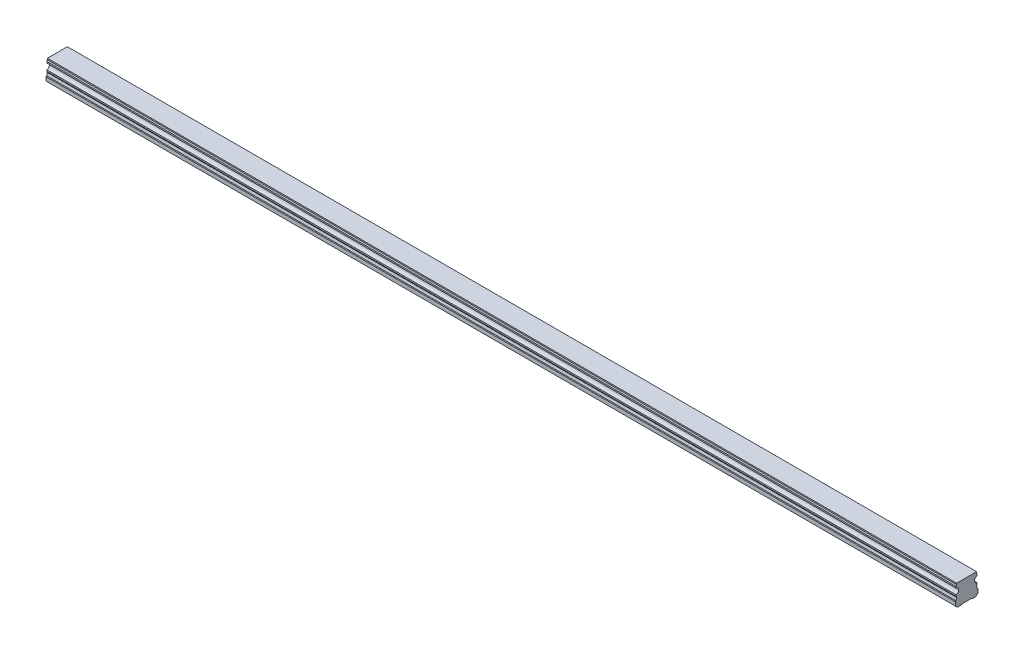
ISO-10303-21;
HEADER;
FILE_DESCRIPTION(('STEP AP214'),'2;1');
FILE_NAME('part.step','',(''),(''),'','','');
FILE_SCHEMA(('AUTOMOTIVE_DESIGN { 1 0 10303 214 1 1 1 1 }'));
ENDSEC;
DATA;
#1=APPLICATION_CONTEXT('core data for automotive mechanical design processes');
#2=APPLICATION_PROTOCOL_DEFINITION('international standard','automotive_design',2000,#1);
#3=PRODUCT_CONTEXT('',#1,'mechanical');
#4=PRODUCT('Part','Part','',(#3));
#5=PRODUCT_RELATED_PRODUCT_CATEGORY('part','',(#4));
#6=PRODUCT_DEFINITION_FORMATION('','',#4);
#7=PRODUCT_DEFINITION_CONTEXT('part definition',#1,'design');
#8=PRODUCT_DEFINITION('design','',#6,#7);
#9=PRODUCT_DEFINITION_SHAPE('','',#8);
#10=(LENGTH_UNIT() NAMED_UNIT(*) SI_UNIT(.MILLI.,.METRE.));
#11=(NAMED_UNIT(*) PLANE_ANGLE_UNIT() SI_UNIT($,.RADIAN.));
#12=(NAMED_UNIT(*) SI_UNIT($,.STERADIAN.) SOLID_ANGLE_UNIT());
#13=UNCERTAINTY_MEASURE_WITH_UNIT(LENGTH_MEASURE(1.E-05),#10,'distance_accuracy_value','');
#14=(GEOMETRIC_REPRESENTATION_CONTEXT(3) GLOBAL_UNCERTAINTY_ASSIGNED_CONTEXT((#13)) GLOBAL_UNIT_ASSIGNED_CONTEXT((#10,
#11,#12)) REPRESENTATION_CONTEXT('',''));
#15=CARTESIAN_POINT('',(0.,0.,0.));
#16=DIRECTION('',(0.,0.,1.));
#17=DIRECTION('',(1.,0.,0.));
#18=AXIS2_PLACEMENT_3D('',#15,#16,#17);
#19=CARTESIAN_POINT('',(570.,0.399999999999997,0.));
#20=DIRECTION('',(0.,-1.,0.));
#21=DIRECTION('',(0.,0.,-1.));
#22=AXIS2_PLACEMENT_3D('',#19,#20,#21);
#23=CONICAL_SURFACE('',#22,2.89999999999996,0.785398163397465);
#24=CARTESIAN_POINT('',(570.,0.799999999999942,0.));
#25=DIRECTION('',(0.,1.,0.));
#26=DIRECTION('',(0.,0.,1.));
#27=AXIS2_PLACEMENT_3D('',#24,#25,#26);
#28=CIRCLE('',#27,2.5);
#29=CARTESIAN_POINT('',(570.,0.79999999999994,-2.5));
#30=VERTEX_POINT('',#29);
#31=EDGE_CURVE('E11',#30,#30,#28,.F.);
#32=CARTESIAN_POINT('',(570.,0.399999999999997,0.));
#33=DIRECTION('',(0.,1.,0.));
#34=DIRECTION('',(0.,0.,1.));
#35=AXIS2_PLACEMENT_3D('',#32,#33,#34);
#36=CIRCLE('',#35,2.89999999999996);
#37=CARTESIAN_POINT('',(570.,0.399999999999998,-2.89999999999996));
#38=VERTEX_POINT('',#37);
#39=EDGE_CURVE('E518',#38,#38,#36,.T.);
#40=CARTESIAN_POINT('',(570.,0.79999999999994,-2.5));
#41=CARTESIAN_POINT('',(570.,0.795833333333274,-2.50416666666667));
#42=CARTESIAN_POINT('',(570.,0.791666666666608,-2.50833333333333));
#43=CARTESIAN_POINT('',(570.,0.783333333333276,-2.51666666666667));
#44=CARTESIAN_POINT('',(570.,0.77916666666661,-2.52083333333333));
#45=CARTESIAN_POINT('',(570.,0.770833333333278,-2.52916666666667));
#46=CARTESIAN_POINT('',(570.,0.766666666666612,-2.53333333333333));
#47=CARTESIAN_POINT('',(570.,0.75833333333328,-2.54166666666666));
#48=CARTESIAN_POINT('',(570.,0.754166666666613,-2.54583333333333));
#49=CARTESIAN_POINT('',(570.,0.745833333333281,-2.55416666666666));
#50=CARTESIAN_POINT('',(570.,0.741666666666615,-2.55833333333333));
#51=CARTESIAN_POINT('',(570.,0.733333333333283,-2.56666666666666));
#52=CARTESIAN_POINT('',(570.,0.729166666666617,-2.57083333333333));
#53=CARTESIAN_POINT('',(570.,0.720833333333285,-2.57916666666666));
#54=CARTESIAN_POINT('',(570.,0.716666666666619,-2.58333333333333));
#55=CARTESIAN_POINT('',(570.,0.708333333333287,-2.59166666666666));
#56=CARTESIAN_POINT('',(570.,0.704166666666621,-2.59583333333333));
#57=CARTESIAN_POINT('',(570.,0.695833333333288,-2.60416666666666));
#58=CARTESIAN_POINT('',(570.,0.691666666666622,-2.60833333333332));
#59=CARTESIAN_POINT('',(570.,0.68333333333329,-2.61666666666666));
#60=CARTESIAN_POINT('',(570.,0.679166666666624,-2.62083333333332));
#61=CARTESIAN_POINT('',(570.,0.670833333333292,-2.62916666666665));
#62=CARTESIAN_POINT('',(570.,0.666666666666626,-2.63333333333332));
#63=CARTESIAN_POINT('',(570.,0.658333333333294,-2.64166666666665));
#64=CARTESIAN_POINT('',(570.,0.654166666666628,-2.64583333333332));
#65=CARTESIAN_POINT('',(570.,0.645833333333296,-2.65416666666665));
#66=CARTESIAN_POINT('',(570.,0.64166666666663,-2.65833333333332));
#67=CARTESIAN_POINT('',(570.,0.633333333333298,-2.66666666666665));
#68=CARTESIAN_POINT('',(570.,0.629166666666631,-2.67083333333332));
#69=CARTESIAN_POINT('',(570.,0.620833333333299,-2.67916666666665));
#70=CARTESIAN_POINT('',(570.,0.616666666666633,-2.68333333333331));
#71=CARTESIAN_POINT('',(570.,0.608333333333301,-2.69166666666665));
#72=CARTESIAN_POINT('',(570.,0.604166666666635,-2.69583333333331));
#73=CARTESIAN_POINT('',(570.,0.595833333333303,-2.70416666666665));
#74=CARTESIAN_POINT('',(570.,0.591666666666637,-2.70833333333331));
#75=CARTESIAN_POINT('',(570.,0.583333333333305,-2.71666666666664));
#76=CARTESIAN_POINT('',(570.,0.579166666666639,-2.72083333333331));
#77=CARTESIAN_POINT('',(570.,0.570833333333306,-2.72916666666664));
#78=CARTESIAN_POINT('',(570.,0.56666666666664,-2.73333333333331));
#79=CARTESIAN_POINT('',(570.,0.558333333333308,-2.74166666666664));
#80=CARTESIAN_POINT('',(570.,0.554166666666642,-2.74583333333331));
#81=CARTESIAN_POINT('',(570.,0.54583333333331,-2.75416666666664));
#82=CARTESIAN_POINT('',(570.,0.541666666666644,-2.75833333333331));
#83=CARTESIAN_POINT('',(570.,0.533333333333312,-2.76666666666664));
#84=CARTESIAN_POINT('',(570.,0.529166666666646,-2.77083333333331));
#85=CARTESIAN_POINT('',(570.,0.520833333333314,-2.77916666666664));
#86=CARTESIAN_POINT('',(570.,0.516666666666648,-2.7833333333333));
#87=CARTESIAN_POINT('',(570.,0.508333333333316,-2.79166666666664));
#88=CARTESIAN_POINT('',(570.,0.504166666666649,-2.7958333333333));
#89=CARTESIAN_POINT('',(570.,0.495833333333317,-2.80416666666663));
#90=CARTESIAN_POINT('',(570.,0.491666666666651,-2.8083333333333));
#91=CARTESIAN_POINT('',(570.,0.483333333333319,-2.81666666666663));
#92=CARTESIAN_POINT('',(570.,0.479166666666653,-2.8208333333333));
#93=CARTESIAN_POINT('',(570.,0.470833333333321,-2.82916666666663));
#94=CARTESIAN_POINT('',(570.,0.466666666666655,-2.8333333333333));
#95=CARTESIAN_POINT('',(570.,0.458333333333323,-2.84166666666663));
#96=CARTESIAN_POINT('',(570.,0.454166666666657,-2.8458333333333));
#97=CARTESIAN_POINT('',(570.,0.445833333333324,-2.85416666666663));
#98=CARTESIAN_POINT('',(570.,0.441666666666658,-2.8583333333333));
#99=CARTESIAN_POINT('',(570.,0.433333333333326,-2.86666666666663));
#100=CARTESIAN_POINT('',(570.,0.42916666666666,-2.87083333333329));
#101=CARTESIAN_POINT('',(570.,0.420833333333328,-2.87916666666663));
#102=CARTESIAN_POINT('',(570.,0.416666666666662,-2.88333333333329));
#103=CARTESIAN_POINT('',(570.,0.40833333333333,-2.89166666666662));
#104=CARTESIAN_POINT('',(570.,0.404166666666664,-2.89583333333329));
#105=CARTESIAN_POINT('',(570.,0.399999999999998,-2.89999999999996));
#106=B_SPLINE_CURVE_WITH_KNOTS('',3,(#40,#41,#42,#43,#44,#45,#46,#47,#48,#49,#50,#51,#52,#53,
#54,#55,#56,#57,#58,#59,#60,#61,#62,#63,#64,#65,#66,#67,#68,#69,#70,#71,#72,#73,#74,#75,#76,#77,
#78,#79,#80,#81,#82,#83,#84,#85,#86,#87,#88,#89,#90,#91,#92,#93,#94,#95,#96,#97,#98,#99,#100,
#101,#102,#103,#104,#105),.UNSPECIFIED.,.F.,.F.,(4,2,2,2,2,2,2,2,2,2,2,2,2,2,2,2,2,2,2,2,2,2,2,
2,2,2,2,2,2,2,2,2,4),(0.,0.0176776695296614,0.0353553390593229,0.0530330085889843,
0.0707106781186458,0.0883883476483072,0.106066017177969,0.12374368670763,0.141421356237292,
0.159099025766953,0.176776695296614,0.194454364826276,0.212132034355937,0.229809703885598,
0.24748737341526,0.265165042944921,0.282842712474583,0.300520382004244,0.318198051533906,
0.335875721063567,0.353553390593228,0.37123106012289,0.388908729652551,0.406586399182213,
0.424264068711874,0.441941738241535,0.459619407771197,0.477297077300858,0.49497474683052,
0.512652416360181,0.530330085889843,0.548007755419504,0.565685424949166),.UNSPECIFIED.);
#107=EDGE_CURVE('BSEAM39',#30,#38,#106,.T.);
#108=ORIENTED_EDGE('',*,*,#31,.F.);
#109=ORIENTED_EDGE('',*,*,#39,.F.);
#110=ORIENTED_EDGE('',*,*,#107,.T.);
#111=ORIENTED_EDGE('',*,*,#107,.F.);
#112=EDGE_LOOP('',(#108,#110,#109,#111));
#113=FACE_BOUND('',#112,.T.);
#114=ADVANCED_FACE('F39',(#113),#23,.F.);
#115=CARTESIAN_POINT('',(570.,7.,0.));
#116=DIRECTION('',(0.,-1.,0.));
#117=DIRECTION('',(0.,0.,-1.));
#118=AXIS2_PLACEMENT_3D('',#115,#116,#117);
#119=CYLINDRICAL_SURFACE('',#118,2.5);
#120=ORIENTED_EDGE('',*,*,#31,.T.);
#121=EDGE_LOOP('',(#120));
#122=FACE_BOUND('',#121,.T.);
#123=CARTESIAN_POINT('',(570.,7.,0.));
#124=DIRECTION('',(0.,-1.,0.));
#125=DIRECTION('',(0.,0.,-1.));
#126=AXIS2_PLACEMENT_3D('',#123,#124,#125);
#127=CIRCLE('',#126,2.5);
#128=CARTESIAN_POINT('',(570.,7.,-2.50000000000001));
#129=VERTEX_POINT('',#128);
#130=EDGE_CURVE('E49',#129,#129,#127,.T.);
#131=ORIENTED_EDGE('',*,*,#130,.F.);
#132=EDGE_LOOP('',(#131));
#133=FACE_BOUND('',#132,.T.);
#134=ADVANCED_FACE('F706',(#122,#133),#119,.F.);
#135=CARTESIAN_POINT('',(570.,7.,0.));
#136=DIRECTION('',(0.,-1.,0.));
#137=DIRECTION('',(0.,0.,-1.));
#138=AXIS2_PLACEMENT_3D('',#135,#136,#137);
#139=PLANE('',#138);
#140=CARTESIAN_POINT('',(570.,7.,0.));
#141=DIRECTION('',(0.,-1.,0.));
#142=DIRECTION('',(0.,0.,-1.));
#143=AXIS2_PLACEMENT_3D('',#140,#141,#142);
#144=CIRCLE('',#143,2.1);
#145=CARTESIAN_POINT('',(570.,7.,-2.1));
#146=VERTEX_POINT('',#145);
#147=EDGE_CURVE('E42',#146,#146,#144,.T.);
#148=ORIENTED_EDGE('',*,*,#147,.F.);
#149=EDGE_LOOP('',(#148));
#150=FACE_BOUND('',#149,.T.);
#151=ORIENTED_EDGE('',*,*,#130,.T.);
#152=EDGE_LOOP('',(#151));
#153=FACE_BOUND('',#152,.T.);
#154=ADVANCED_FACE('F711',(#150,#153),#139,.T.);
#155=CARTESIAN_POINT('',(510.,0.399999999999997,0.));
#156=DIRECTION('',(0.,-1.,0.));
#157=DIRECTION('',(0.,0.,-1.));
#158=AXIS2_PLACEMENT_3D('',#155,#156,#157);
#159=CONICAL_SURFACE('',#158,2.89999999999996,0.785398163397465);
#160=CARTESIAN_POINT('',(510.,0.799999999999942,0.));
#161=DIRECTION('',(0.,1.,0.));
#162=DIRECTION('',(0.,0.,1.));
#163=AXIS2_PLACEMENT_3D('',#160,#161,#162);
#164=CIRCLE('',#163,2.5);
#165=CARTESIAN_POINT('',(510.,0.79999999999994,-2.5));
#166=VERTEX_POINT('',#165);
#167=EDGE_CURVE('E514',#166,#166,#164,.F.);
#168=CARTESIAN_POINT('',(510.,0.399999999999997,0.));
#169=DIRECTION('',(0.,1.,0.));
#170=DIRECTION('',(0.,0.,1.));
#171=AXIS2_PLACEMENT_3D('',#168,#169,#170);
#172=CIRCLE('',#171,2.89999999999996);
#173=CARTESIAN_POINT('',(510.,0.399999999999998,-2.89999999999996));
#174=VERTEX_POINT('',#173);
#175=EDGE_CURVE('E506',#174,#174,#172,.T.);
#176=CARTESIAN_POINT('',(510.,0.79999999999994,-2.5));
#177=CARTESIAN_POINT('',(510.,0.795833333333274,-2.50416666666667));
#178=CARTESIAN_POINT('',(510.,0.791666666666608,-2.50833333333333));
#179=CARTESIAN_POINT('',(510.,0.783333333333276,-2.51666666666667));
#180=CARTESIAN_POINT('',(510.,0.77916666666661,-2.52083333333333));
#181=CARTESIAN_POINT('',(510.,0.770833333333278,-2.52916666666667));
#182=CARTESIAN_POINT('',(510.,0.766666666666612,-2.53333333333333));
#183=CARTESIAN_POINT('',(510.,0.75833333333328,-2.54166666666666));
#184=CARTESIAN_POINT('',(510.,0.754166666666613,-2.54583333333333));
#185=CARTESIAN_POINT('',(510.,0.745833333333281,-2.55416666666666));
#186=CARTESIAN_POINT('',(510.,0.741666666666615,-2.55833333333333));
#187=CARTESIAN_POINT('',(510.,0.733333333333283,-2.56666666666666));
#188=CARTESIAN_POINT('',(510.,0.729166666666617,-2.57083333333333));
#189=CARTESIAN_POINT('',(510.,0.720833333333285,-2.57916666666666));
#190=CARTESIAN_POINT('',(510.,0.716666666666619,-2.58333333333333));
#191=CARTESIAN_POINT('',(510.,0.708333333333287,-2.59166666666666));
#192=CARTESIAN_POINT('',(510.,0.704166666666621,-2.59583333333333));
#193=CARTESIAN_POINT('',(510.,0.695833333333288,-2.60416666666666));
#194=CARTESIAN_POINT('',(510.,0.691666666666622,-2.60833333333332));
#195=CARTESIAN_POINT('',(510.,0.68333333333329,-2.61666666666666));
#196=CARTESIAN_POINT('',(510.,0.679166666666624,-2.62083333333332));
#197=CARTESIAN_POINT('',(510.,0.670833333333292,-2.62916666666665));
#198=CARTESIAN_POINT('',(510.,0.666666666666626,-2.63333333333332));
#199=CARTESIAN_POINT('',(510.,0.658333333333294,-2.64166666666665));
#200=CARTESIAN_POINT('',(510.,0.654166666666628,-2.64583333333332));
#201=CARTESIAN_POINT('',(510.,0.645833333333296,-2.65416666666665));
#202=CARTESIAN_POINT('',(510.,0.64166666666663,-2.65833333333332));
#203=CARTESIAN_POINT('',(510.,0.633333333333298,-2.66666666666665));
#204=CARTESIAN_POINT('',(510.,0.629166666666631,-2.67083333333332));
#205=CARTESIAN_POINT('',(510.,0.620833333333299,-2.67916666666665));
#206=CARTESIAN_POINT('',(510.,0.616666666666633,-2.68333333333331));
#207=CARTESIAN_POINT('',(510.,0.608333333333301,-2.69166666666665));
#208=CARTESIAN_POINT('',(510.,0.604166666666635,-2.69583333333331));
#209=CARTESIAN_POINT('',(510.,0.595833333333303,-2.70416666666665));
#210=CARTESIAN_POINT('',(510.,0.591666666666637,-2.70833333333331));
#211=CARTESIAN_POINT('',(510.,0.583333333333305,-2.71666666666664));
#212=CARTESIAN_POINT('',(510.,0.579166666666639,-2.72083333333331));
#213=CARTESIAN_POINT('',(510.,0.570833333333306,-2.72916666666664));
#214=CARTESIAN_POINT('',(510.,0.56666666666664,-2.73333333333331));
#215=CARTESIAN_POINT('',(510.,0.558333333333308,-2.74166666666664));
#216=CARTESIAN_POINT('',(510.,0.554166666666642,-2.74583333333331));
#217=CARTESIAN_POINT('',(510.,0.54583333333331,-2.75416666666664));
#218=CARTESIAN_POINT('',(510.,0.541666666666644,-2.75833333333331));
#219=CARTESIAN_POINT('',(510.,0.533333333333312,-2.76666666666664));
#220=CARTESIAN_POINT('',(510.,0.529166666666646,-2.77083333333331));
#221=CARTESIAN_POINT('',(510.,0.520833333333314,-2.77916666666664));
#222=CARTESIAN_POINT('',(510.,0.516666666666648,-2.7833333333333));
#223=CARTESIAN_POINT('',(510.,0.508333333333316,-2.79166666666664));
#224=CARTESIAN_POINT('',(510.,0.504166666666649,-2.7958333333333));
#225=CARTESIAN_POINT('',(510.,0.495833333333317,-2.80416666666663));
#226=CARTESIAN_POINT('',(510.,0.491666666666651,-2.8083333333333));
#227=CARTESIAN_POINT('',(510.,0.483333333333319,-2.81666666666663));
#228=CARTESIAN_POINT('',(510.,0.479166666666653,-2.8208333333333));
#229=CARTESIAN_POINT('',(510.,0.470833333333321,-2.82916666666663));
#230=CARTESIAN_POINT('',(510.,0.466666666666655,-2.8333333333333));
#231=CARTESIAN_POINT('',(510.,0.458333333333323,-2.84166666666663));
#232=CARTESIAN_POINT('',(510.,0.454166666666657,-2.8458333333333));
#233=CARTESIAN_POINT('',(510.,0.445833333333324,-2.85416666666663));
#234=CARTESIAN_POINT('',(510.,0.441666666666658,-2.8583333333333));
#235=CARTESIAN_POINT('',(510.,0.433333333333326,-2.86666666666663));
#236=CARTESIAN_POINT('',(510.,0.42916666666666,-2.87083333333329));
#237=CARTESIAN_POINT('',(510.,0.420833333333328,-2.87916666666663));
#238=CARTESIAN_POINT('',(510.,0.416666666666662,-2.88333333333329));
#239=CARTESIAN_POINT('',(510.,0.40833333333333,-2.89166666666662));
#240=CARTESIAN_POINT('',(510.,0.404166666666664,-2.89583333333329));
#241=CARTESIAN_POINT('',(510.,0.399999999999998,-2.89999999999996));
#242=B_SPLINE_CURVE_WITH_KNOTS('',3,(#176,#177,#178,#179,#180,#181,#182,#183,#184,#185,#186,
#187,#188,#189,#190,#191,#192,#193,#194,#195,#196,#197,#198,#199,#200,#201,#202,#203,#204,#205,
#206,#207,#208,#209,#210,#211,#212,#213,#214,#215,#216,#217,#218,#219,#220,#221,#222,#223,#224,
#225,#226,#227,#228,#229,#230,#231,#232,#233,#234,#235,#236,#237,#238,#239,#240,#241),
.UNSPECIFIED.,.F.,.F.,(4,2,2,2,2,2,2,2,2,2,2,2,2,2,2,2,2,2,2,2,2,2,2,2,2,2,2,2,2,2,2,2,4),(0.,
0.0176776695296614,0.0353553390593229,0.0530330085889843,0.0707106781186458,0.0883883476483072,
0.106066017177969,0.12374368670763,0.141421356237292,0.159099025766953,0.176776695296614,
0.194454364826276,0.212132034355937,0.229809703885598,0.24748737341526,0.265165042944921,
0.282842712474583,0.300520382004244,0.318198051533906,0.335875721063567,0.353553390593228,
0.37123106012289,0.388908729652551,0.406586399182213,0.424264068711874,0.441941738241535,
0.459619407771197,0.477297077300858,0.49497474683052,0.512652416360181,0.530330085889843,
0.548007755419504,0.565685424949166),.UNSPECIFIED.);
#243=EDGE_CURVE('BSEAM870',#166,#174,#242,.T.);
#244=ORIENTED_EDGE('',*,*,#167,.F.);
#245=ORIENTED_EDGE('',*,*,#175,.F.);
#246=ORIENTED_EDGE('',*,*,#243,.T.);
#247=ORIENTED_EDGE('',*,*,#243,.F.);
#248=EDGE_LOOP('',(#244,#246,#245,#247));
#249=FACE_BOUND('',#248,.T.);
#250=ADVANCED_FACE('F870',(#249),#159,.F.);
#251=CARTESIAN_POINT('',(510.,7.,0.));
#252=DIRECTION('',(0.,-1.,0.));
#253=DIRECTION('',(0.,0.,-1.));
#254=AXIS2_PLACEMENT_3D('',#251,#252,#253);
#255=CYLINDRICAL_SURFACE('',#254,2.5);
#256=ORIENTED_EDGE('',*,*,#167,.T.);
#257=EDGE_LOOP('',(#256));
#258=FACE_BOUND('',#257,.T.);
#259=CARTESIAN_POINT('',(510.,7.,0.));
#260=DIRECTION('',(0.,-1.,0.));
#261=DIRECTION('',(0.,0.,-1.));
#262=AXIS2_PLACEMENT_3D('',#259,#260,#261);
#263=CIRCLE('',#262,2.5);
#264=CARTESIAN_POINT('',(510.,7.,-2.50000000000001));
#265=VERTEX_POINT('',#264);
#266=EDGE_CURVE('E510',#265,#265,#263,.T.);
#267=ORIENTED_EDGE('',*,*,#266,.F.);
#268=EDGE_LOOP('',(#267));
#269=FACE_BOUND('',#268,.T.);
#270=ADVANCED_FACE('F866',(#258,#269),#255,.F.);
#271=CARTESIAN_POINT('',(510.,7.,0.));
#272=DIRECTION('',(0.,-1.,0.));
#273=DIRECTION('',(0.,0.,-1.));
#274=AXIS2_PLACEMENT_3D('',#271,#272,#273);
#275=PLANE('',#274);
#276=CARTESIAN_POINT('',(510.,7.,0.));
#277=DIRECTION('',(0.,-1.,0.));
#278=DIRECTION('',(0.,0.,-1.));
#279=AXIS2_PLACEMENT_3D('',#276,#277,#278);
#280=CIRCLE('',#279,2.1);
#281=CARTESIAN_POINT('',(510.,7.,-2.1));
#282=VERTEX_POINT('',#281);
#283=EDGE_CURVE('E553',#282,#282,#280,.T.);
#284=ORIENTED_EDGE('',*,*,#283,.F.);
#285=EDGE_LOOP('',(#284));
#286=FACE_BOUND('',#285,.T.);
#287=ORIENTED_EDGE('',*,*,#266,.T.);
#288=EDGE_LOOP('',(#287));
#289=FACE_BOUND('',#288,.T.);
#290=ADVANCED_FACE('F862',(#286,#289),#275,.T.);
#291=CARTESIAN_POINT('',(450.,0.399999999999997,0.));
#292=DIRECTION('',(0.,-1.,0.));
#293=DIRECTION('',(0.,0.,-1.));
#294=AXIS2_PLACEMENT_3D('',#291,#292,#293);
#295=CONICAL_SURFACE('',#294,2.89999999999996,0.785398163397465);
#296=CARTESIAN_POINT('',(450.,0.799999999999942,0.));
#297=DIRECTION('',(0.,1.,0.));
#298=DIRECTION('',(0.,0.,1.));
#299=AXIS2_PLACEMENT_3D('',#296,#297,#298);
#300=CIRCLE('',#299,2.5);
#301=CARTESIAN_POINT('',(450.,0.79999999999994,-2.5));
#302=VERTEX_POINT('',#301);
#303=EDGE_CURVE('E502',#302,#302,#300,.F.);
#304=CARTESIAN_POINT('',(450.,0.399999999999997,0.));
#305=DIRECTION('',(0.,1.,0.));
#306=DIRECTION('',(0.,0.,1.));
#307=AXIS2_PLACEMENT_3D('',#304,#305,#306);
#308=CIRCLE('',#307,2.89999999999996);
#309=CARTESIAN_POINT('',(450.,0.399999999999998,-2.89999999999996));
#310=VERTEX_POINT('',#309);
#311=EDGE_CURVE('E494',#310,#310,#308,.T.);
#312=CARTESIAN_POINT('',(450.,0.79999999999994,-2.5));
#313=CARTESIAN_POINT('',(450.,0.795833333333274,-2.50416666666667));
#314=CARTESIAN_POINT('',(450.,0.791666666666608,-2.50833333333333));
#315=CARTESIAN_POINT('',(450.,0.783333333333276,-2.51666666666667));
#316=CARTESIAN_POINT('',(450.,0.77916666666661,-2.52083333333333));
#317=CARTESIAN_POINT('',(450.,0.770833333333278,-2.52916666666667));
#318=CARTESIAN_POINT('',(450.,0.766666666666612,-2.53333333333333));
#319=CARTESIAN_POINT('',(450.,0.75833333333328,-2.54166666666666));
#320=CARTESIAN_POINT('',(450.,0.754166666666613,-2.54583333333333));
#321=CARTESIAN_POINT('',(450.,0.745833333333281,-2.55416666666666));
#322=CARTESIAN_POINT('',(450.,0.741666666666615,-2.55833333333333));
#323=CARTESIAN_POINT('',(450.,0.733333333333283,-2.56666666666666));
#324=CARTESIAN_POINT('',(450.,0.729166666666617,-2.57083333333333));
#325=CARTESIAN_POINT('',(450.,0.720833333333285,-2.57916666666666));
#326=CARTESIAN_POINT('',(450.,0.716666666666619,-2.58333333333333));
#327=CARTESIAN_POINT('',(450.,0.708333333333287,-2.59166666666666));
#328=CARTESIAN_POINT('',(450.,0.704166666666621,-2.59583333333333));
#329=CARTESIAN_POINT('',(450.,0.695833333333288,-2.60416666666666));
#330=CARTESIAN_POINT('',(450.,0.691666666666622,-2.60833333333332));
#331=CARTESIAN_POINT('',(450.,0.68333333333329,-2.61666666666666));
#332=CARTESIAN_POINT('',(450.,0.679166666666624,-2.62083333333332));
#333=CARTESIAN_POINT('',(450.,0.670833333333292,-2.62916666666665));
#334=CARTESIAN_POINT('',(450.,0.666666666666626,-2.63333333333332));
#335=CARTESIAN_POINT('',(450.,0.658333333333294,-2.64166666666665));
#336=CARTESIAN_POINT('',(450.,0.654166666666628,-2.64583333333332));
#337=CARTESIAN_POINT('',(450.,0.645833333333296,-2.65416666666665));
#338=CARTESIAN_POINT('',(450.,0.64166666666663,-2.65833333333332));
#339=CARTESIAN_POINT('',(450.,0.633333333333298,-2.66666666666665));
#340=CARTESIAN_POINT('',(450.,0.629166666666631,-2.67083333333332));
#341=CARTESIAN_POINT('',(450.,0.620833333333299,-2.67916666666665));
#342=CARTESIAN_POINT('',(450.,0.616666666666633,-2.68333333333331));
#343=CARTESIAN_POINT('',(450.,0.608333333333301,-2.69166666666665));
#344=CARTESIAN_POINT('',(450.,0.604166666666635,-2.69583333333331));
#345=CARTESIAN_POINT('',(450.,0.595833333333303,-2.70416666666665));
#346=CARTESIAN_POINT('',(450.,0.591666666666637,-2.70833333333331));
#347=CARTESIAN_POINT('',(450.,0.583333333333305,-2.71666666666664));
#348=CARTESIAN_POINT('',(450.,0.579166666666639,-2.72083333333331));
#349=CARTESIAN_POINT('',(450.,0.570833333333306,-2.72916666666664));
#350=CARTESIAN_POINT('',(450.,0.56666666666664,-2.73333333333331));
#351=CARTESIAN_POINT('',(450.,0.558333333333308,-2.74166666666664));
#352=CARTESIAN_POINT('',(450.,0.554166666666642,-2.74583333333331));
#353=CARTESIAN_POINT('',(450.,0.54583333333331,-2.75416666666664));
#354=CARTESIAN_POINT('',(450.,0.541666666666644,-2.75833333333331));
#355=CARTESIAN_POINT('',(450.,0.533333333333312,-2.76666666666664));
#356=CARTESIAN_POINT('',(450.,0.529166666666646,-2.77083333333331));
#357=CARTESIAN_POINT('',(450.,0.520833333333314,-2.77916666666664));
#358=CARTESIAN_POINT('',(450.,0.516666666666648,-2.7833333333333));
#359=CARTESIAN_POINT('',(450.,0.508333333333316,-2.79166666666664));
#360=CARTESIAN_POINT('',(450.,0.504166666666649,-2.7958333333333));
#361=CARTESIAN_POINT('',(450.,0.495833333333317,-2.80416666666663));
#362=CARTESIAN_POINT('',(450.,0.491666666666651,-2.8083333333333));
#363=CARTESIAN_POINT('',(450.,0.483333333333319,-2.81666666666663));
#364=CARTESIAN_POINT('',(450.,0.479166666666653,-2.8208333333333));
#365=CARTESIAN_POINT('',(450.,0.470833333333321,-2.82916666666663));
#366=CARTESIAN_POINT('',(450.,0.466666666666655,-2.8333333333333));
#367=CARTESIAN_POINT('',(450.,0.458333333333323,-2.84166666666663));
#368=CARTESIAN_POINT('',(450.,0.454166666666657,-2.8458333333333));
#369=CARTESIAN_POINT('',(450.,0.445833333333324,-2.85416666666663));
#370=CARTESIAN_POINT('',(450.,0.441666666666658,-2.8583333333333));
#371=CARTESIAN_POINT('',(450.,0.433333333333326,-2.86666666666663));
#372=CARTESIAN_POINT('',(450.,0.42916666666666,-2.87083333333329));
#373=CARTESIAN_POINT('',(450.,0.420833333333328,-2.87916666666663));
#374=CARTESIAN_POINT('',(450.,0.416666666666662,-2.88333333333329));
#375=CARTESIAN_POINT('',(450.,0.40833333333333,-2.89166666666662));
#376=CARTESIAN_POINT('',(450.,0.404166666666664,-2.89583333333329));
#377=CARTESIAN_POINT('',(450.,0.399999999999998,-2.89999999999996));
#378=B_SPLINE_CURVE_WITH_KNOTS('',3,(#312,#313,#314,#315,#316,#317,#318,#319,#320,#321,#322,
#323,#324,#325,#326,#327,#328,#329,#330,#331,#332,#333,#334,#335,#336,#337,#338,#339,#340,#341,
#342,#343,#344,#345,#346,#347,#348,#349,#350,#351,#352,#353,#354,#355,#356,#357,#358,#359,#360,
#361,#362,#363,#364,#365,#366,#367,#368,#369,#370,#371,#372,#373,#374,#375,#376,#377),
.UNSPECIFIED.,.F.,.F.,(4,2,2,2,2,2,2,2,2,2,2,2,2,2,2,2,2,2,2,2,2,2,2,2,2,2,2,2,2,2,2,2,4),(0.,
0.0176776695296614,0.0353553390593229,0.0530330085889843,0.0707106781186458,0.0883883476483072,
0.106066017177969,0.12374368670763,0.141421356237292,0.159099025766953,0.176776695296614,
0.194454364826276,0.212132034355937,0.229809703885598,0.24748737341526,0.265165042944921,
0.282842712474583,0.300520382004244,0.318198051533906,0.335875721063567,0.353553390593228,
0.37123106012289,0.388908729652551,0.406586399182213,0.424264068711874,0.441941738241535,
0.459619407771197,0.477297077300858,0.49497474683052,0.512652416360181,0.530330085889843,
0.548007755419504,0.565685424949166),.UNSPECIFIED.);
#379=EDGE_CURVE('BSEAM858',#302,#310,#378,.T.);
#380=ORIENTED_EDGE('',*,*,#303,.F.);
#381=ORIENTED_EDGE('',*,*,#311,.F.);
#382=ORIENTED_EDGE('',*,*,#379,.T.);
#383=ORIENTED_EDGE('',*,*,#379,.F.);
#384=EDGE_LOOP('',(#380,#382,#381,#383));
#385=FACE_BOUND('',#384,.T.);
#386=ADVANCED_FACE('F858',(#385),#295,.F.);
#387=CARTESIAN_POINT('',(450.,7.,0.));
#388=DIRECTION('',(0.,-1.,0.));
#389=DIRECTION('',(0.,0.,-1.));
#390=AXIS2_PLACEMENT_3D('',#387,#388,#389);
#391=CYLINDRICAL_SURFACE('',#390,2.5);
#392=ORIENTED_EDGE('',*,*,#303,.T.);
#393=EDGE_LOOP('',(#392));
#394=FACE_BOUND('',#393,.T.);
#395=CARTESIAN_POINT('',(450.,7.,0.));
#396=DIRECTION('',(0.,-1.,0.));
#397=DIRECTION('',(0.,0.,-1.));
#398=AXIS2_PLACEMENT_3D('',#395,#396,#397);
#399=CIRCLE('',#398,2.5);
#400=CARTESIAN_POINT('',(450.,7.,-2.50000000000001));
#401=VERTEX_POINT('',#400);
#402=EDGE_CURVE('E498',#401,#401,#399,.T.);
#403=ORIENTED_EDGE('',*,*,#402,.F.);
#404=EDGE_LOOP('',(#403));
#405=FACE_BOUND('',#404,.T.);
#406=ADVANCED_FACE('F854',(#394,#405),#391,.F.);
#407=CARTESIAN_POINT('',(450.,7.,0.));
#408=DIRECTION('',(0.,-1.,0.));
#409=DIRECTION('',(0.,0.,-1.));
#410=AXIS2_PLACEMENT_3D('',#407,#408,#409);
#411=PLANE('',#410);
#412=CARTESIAN_POINT('',(450.,7.,0.));
#413=DIRECTION('',(0.,-1.,0.));
#414=DIRECTION('',(0.,0.,-1.));
#415=AXIS2_PLACEMENT_3D('',#412,#413,#414);
#416=CIRCLE('',#415,2.1);
#417=CARTESIAN_POINT('',(450.,7.,-2.1));
#418=VERTEX_POINT('',#417);
#419=EDGE_CURVE('E550',#418,#418,#416,.T.);
#420=ORIENTED_EDGE('',*,*,#419,.F.);
#421=EDGE_LOOP('',(#420));
#422=FACE_BOUND('',#421,.T.);
#423=ORIENTED_EDGE('',*,*,#402,.T.);
#424=EDGE_LOOP('',(#423));
#425=FACE_BOUND('',#424,.T.);
#426=ADVANCED_FACE('F850',(#422,#425),#411,.T.);
#427=CARTESIAN_POINT('',(390.,0.399999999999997,0.));
#428=DIRECTION('',(0.,-1.,0.));
#429=DIRECTION('',(0.,0.,-1.));
#430=AXIS2_PLACEMENT_3D('',#427,#428,#429);
#431=CONICAL_SURFACE('',#430,2.89999999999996,0.785398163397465);
#432=CARTESIAN_POINT('',(390.,0.799999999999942,0.));
#433=DIRECTION('',(0.,1.,0.));
#434=DIRECTION('',(0.,0.,1.));
#435=AXIS2_PLACEMENT_3D('',#432,#433,#434);
#436=CIRCLE('',#435,2.5);
#437=CARTESIAN_POINT('',(390.,0.79999999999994,-2.5));
#438=VERTEX_POINT('',#437);
#439=EDGE_CURVE('E490',#438,#438,#436,.F.);
#440=CARTESIAN_POINT('',(390.,0.399999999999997,0.));
#441=DIRECTION('',(0.,1.,0.));
#442=DIRECTION('',(0.,0.,1.));
#443=AXIS2_PLACEMENT_3D('',#440,#441,#442);
#444=CIRCLE('',#443,2.89999999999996);
#445=CARTESIAN_POINT('',(390.,0.399999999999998,-2.89999999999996));
#446=VERTEX_POINT('',#445);
#447=EDGE_CURVE('E482',#446,#446,#444,.T.);
#448=CARTESIAN_POINT('',(390.,0.79999999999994,-2.5));
#449=CARTESIAN_POINT('',(390.,0.795833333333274,-2.50416666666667));
#450=CARTESIAN_POINT('',(390.,0.791666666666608,-2.50833333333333));
#451=CARTESIAN_POINT('',(390.,0.783333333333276,-2.51666666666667));
#452=CARTESIAN_POINT('',(390.,0.77916666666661,-2.52083333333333));
#453=CARTESIAN_POINT('',(390.,0.770833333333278,-2.52916666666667));
#454=CARTESIAN_POINT('',(390.,0.766666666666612,-2.53333333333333));
#455=CARTESIAN_POINT('',(390.,0.75833333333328,-2.54166666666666));
#456=CARTESIAN_POINT('',(390.,0.754166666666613,-2.54583333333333));
#457=CARTESIAN_POINT('',(390.,0.745833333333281,-2.55416666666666));
#458=CARTESIAN_POINT('',(390.,0.741666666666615,-2.55833333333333));
#459=CARTESIAN_POINT('',(390.,0.733333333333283,-2.56666666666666));
#460=CARTESIAN_POINT('',(390.,0.729166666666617,-2.57083333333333));
#461=CARTESIAN_POINT('',(390.,0.720833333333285,-2.57916666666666));
#462=CARTESIAN_POINT('',(390.,0.716666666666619,-2.58333333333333));
#463=CARTESIAN_POINT('',(390.,0.708333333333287,-2.59166666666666));
#464=CARTESIAN_POINT('',(390.,0.704166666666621,-2.59583333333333));
#465=CARTESIAN_POINT('',(390.,0.695833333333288,-2.60416666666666));
#466=CARTESIAN_POINT('',(390.,0.691666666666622,-2.60833333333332));
#467=CARTESIAN_POINT('',(390.,0.68333333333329,-2.61666666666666));
#468=CARTESIAN_POINT('',(390.,0.679166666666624,-2.62083333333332));
#469=CARTESIAN_POINT('',(390.,0.670833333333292,-2.62916666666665));
#470=CARTESIAN_POINT('',(390.,0.666666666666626,-2.63333333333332));
#471=CARTESIAN_POINT('',(390.,0.658333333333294,-2.64166666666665));
#472=CARTESIAN_POINT('',(390.,0.654166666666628,-2.64583333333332));
#473=CARTESIAN_POINT('',(390.,0.645833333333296,-2.65416666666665));
#474=CARTESIAN_POINT('',(390.,0.64166666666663,-2.65833333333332));
#475=CARTESIAN_POINT('',(390.,0.633333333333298,-2.66666666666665));
#476=CARTESIAN_POINT('',(390.,0.629166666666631,-2.67083333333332));
#477=CARTESIAN_POINT('',(390.,0.620833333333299,-2.67916666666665));
#478=CARTESIAN_POINT('',(390.,0.616666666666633,-2.68333333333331));
#479=CARTESIAN_POINT('',(390.,0.608333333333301,-2.69166666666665));
#480=CARTESIAN_POINT('',(390.,0.604166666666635,-2.69583333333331));
#481=CARTESIAN_POINT('',(390.,0.595833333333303,-2.70416666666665));
#482=CARTESIAN_POINT('',(390.,0.591666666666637,-2.70833333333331));
#483=CARTESIAN_POINT('',(390.,0.583333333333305,-2.71666666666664));
#484=CARTESIAN_POINT('',(390.,0.579166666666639,-2.72083333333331));
#485=CARTESIAN_POINT('',(390.,0.570833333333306,-2.72916666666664));
#486=CARTESIAN_POINT('',(390.,0.56666666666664,-2.73333333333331));
#487=CARTESIAN_POINT('',(390.,0.558333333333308,-2.74166666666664));
#488=CARTESIAN_POINT('',(390.,0.554166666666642,-2.74583333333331));
#489=CARTESIAN_POINT('',(390.,0.54583333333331,-2.75416666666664));
#490=CARTESIAN_POINT('',(390.,0.541666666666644,-2.75833333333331));
#491=CARTESIAN_POINT('',(390.,0.533333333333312,-2.76666666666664));
#492=CARTESIAN_POINT('',(390.,0.529166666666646,-2.77083333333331));
#493=CARTESIAN_POINT('',(390.,0.520833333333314,-2.77916666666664));
#494=CARTESIAN_POINT('',(390.,0.516666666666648,-2.7833333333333));
#495=CARTESIAN_POINT('',(390.,0.508333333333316,-2.79166666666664));
#496=CARTESIAN_POINT('',(390.,0.504166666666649,-2.7958333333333));
#497=CARTESIAN_POINT('',(390.,0.495833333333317,-2.80416666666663));
#498=CARTESIAN_POINT('',(390.,0.491666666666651,-2.8083333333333));
#499=CARTESIAN_POINT('',(390.,0.483333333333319,-2.81666666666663));
#500=CARTESIAN_POINT('',(390.,0.479166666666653,-2.8208333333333));
#501=CARTESIAN_POINT('',(390.,0.470833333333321,-2.82916666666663));
#502=CARTESIAN_POINT('',(390.,0.466666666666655,-2.8333333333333));
#503=CARTESIAN_POINT('',(390.,0.458333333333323,-2.84166666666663));
#504=CARTESIAN_POINT('',(390.,0.454166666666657,-2.8458333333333));
#505=CARTESIAN_POINT('',(390.,0.445833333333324,-2.85416666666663));
#506=CARTESIAN_POINT('',(390.,0.441666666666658,-2.8583333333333));
#507=CARTESIAN_POINT('',(390.,0.433333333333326,-2.86666666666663));
#508=CARTESIAN_POINT('',(390.,0.42916666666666,-2.87083333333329));
#509=CARTESIAN_POINT('',(390.,0.420833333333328,-2.87916666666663));
#510=CARTESIAN_POINT('',(390.,0.416666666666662,-2.88333333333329));
#511=CARTESIAN_POINT('',(390.,0.40833333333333,-2.89166666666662));
#512=CARTESIAN_POINT('',(390.,0.404166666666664,-2.89583333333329));
#513=CARTESIAN_POINT('',(390.,0.399999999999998,-2.89999999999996));
#514=B_SPLINE_CURVE_WITH_KNOTS('',3,(#448,#449,#450,#451,#452,#453,#454,#455,#456,#457,#458,
#459,#460,#461,#462,#463,#464,#465,#466,#467,#468,#469,#470,#471,#472,#473,#474,#475,#476,#477,
#478,#479,#480,#481,#482,#483,#484,#485,#486,#487,#488,#489,#490,#491,#492,#493,#494,#495,#496,
#497,#498,#499,#500,#501,#502,#503,#504,#505,#506,#507,#508,#509,#510,#511,#512,#513),
.UNSPECIFIED.,.F.,.F.,(4,2,2,2,2,2,2,2,2,2,2,2,2,2,2,2,2,2,2,2,2,2,2,2,2,2,2,2,2,2,2,2,4),(0.,
0.0176776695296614,0.0353553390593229,0.0530330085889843,0.0707106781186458,0.0883883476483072,
0.106066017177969,0.12374368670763,0.141421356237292,0.159099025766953,0.176776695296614,
0.194454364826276,0.212132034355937,0.229809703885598,0.24748737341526,0.265165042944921,
0.282842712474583,0.300520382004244,0.318198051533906,0.335875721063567,0.353553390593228,
0.37123106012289,0.388908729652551,0.406586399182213,0.424264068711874,0.441941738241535,
0.459619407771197,0.477297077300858,0.49497474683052,0.512652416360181,0.530330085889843,
0.548007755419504,0.565685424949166),.UNSPECIFIED.);
#515=EDGE_CURVE('BSEAM846',#438,#446,#514,.T.);
#516=ORIENTED_EDGE('',*,*,#439,.F.);
#517=ORIENTED_EDGE('',*,*,#447,.F.);
#518=ORIENTED_EDGE('',*,*,#515,.T.);
#519=ORIENTED_EDGE('',*,*,#515,.F.);
#520=EDGE_LOOP('',(#516,#518,#517,#519));
#521=FACE_BOUND('',#520,.T.);
#522=ADVANCED_FACE('F846',(#521),#431,.F.);
#523=CARTESIAN_POINT('',(390.,7.,0.));
#524=DIRECTION('',(0.,-1.,0.));
#525=DIRECTION('',(0.,0.,-1.));
#526=AXIS2_PLACEMENT_3D('',#523,#524,#525);
#527=CYLINDRICAL_SURFACE('',#526,2.5);
#528=ORIENTED_EDGE('',*,*,#439,.T.);
#529=EDGE_LOOP('',(#528));
#530=FACE_BOUND('',#529,.T.);
#531=CARTESIAN_POINT('',(390.,7.,0.));
#532=DIRECTION('',(0.,-1.,0.));
#533=DIRECTION('',(0.,0.,-1.));
#534=AXIS2_PLACEMENT_3D('',#531,#532,#533);
#535=CIRCLE('',#534,2.5);
#536=CARTESIAN_POINT('',(390.,7.,-2.50000000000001));
#537=VERTEX_POINT('',#536);
#538=EDGE_CURVE('E486',#537,#537,#535,.T.);
#539=ORIENTED_EDGE('',*,*,#538,.F.);
#540=EDGE_LOOP('',(#539));
#541=FACE_BOUND('',#540,.T.);
#542=ADVANCED_FACE('F842',(#530,#541),#527,.F.);
#543=CARTESIAN_POINT('',(390.,7.,0.));
#544=DIRECTION('',(0.,-1.,0.));
#545=DIRECTION('',(0.,0.,-1.));
#546=AXIS2_PLACEMENT_3D('',#543,#544,#545);
#547=PLANE('',#546);
#548=CARTESIAN_POINT('',(390.,7.,0.));
#549=DIRECTION('',(0.,-1.,0.));
#550=DIRECTION('',(0.,0.,-1.));
#551=AXIS2_PLACEMENT_3D('',#548,#549,#550);
#552=CIRCLE('',#551,2.1);
#553=CARTESIAN_POINT('',(390.,7.,-2.1));
#554=VERTEX_POINT('',#553);
#555=EDGE_CURVE('E546',#554,#554,#552,.T.);
#556=ORIENTED_EDGE('',*,*,#555,.F.);
#557=EDGE_LOOP('',(#556));
#558=FACE_BOUND('',#557,.T.);
#559=ORIENTED_EDGE('',*,*,#538,.T.);
#560=EDGE_LOOP('',(#559));
#561=FACE_BOUND('',#560,.T.);
#562=ADVANCED_FACE('F838',(#558,#561),#547,.T.);
#563=CARTESIAN_POINT('',(330.,0.399999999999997,0.));
#564=DIRECTION('',(0.,-1.,0.));
#565=DIRECTION('',(0.,0.,-1.));
#566=AXIS2_PLACEMENT_3D('',#563,#564,#565);
#567=CONICAL_SURFACE('',#566,2.89999999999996,0.785398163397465);
#568=CARTESIAN_POINT('',(330.,0.799999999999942,0.));
#569=DIRECTION('',(0.,1.,0.));
#570=DIRECTION('',(0.,0.,1.));
#571=AXIS2_PLACEMENT_3D('',#568,#569,#570);
#572=CIRCLE('',#571,2.5);
#573=CARTESIAN_POINT('',(330.,0.79999999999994,-2.5));
#574=VERTEX_POINT('',#573);
#575=EDGE_CURVE('E478',#574,#574,#572,.F.);
#576=CARTESIAN_POINT('',(330.,0.399999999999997,0.));
#577=DIRECTION('',(0.,1.,0.));
#578=DIRECTION('',(0.,0.,1.));
#579=AXIS2_PLACEMENT_3D('',#576,#577,#578);
#580=CIRCLE('',#579,2.89999999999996);
#581=CARTESIAN_POINT('',(330.,0.399999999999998,-2.89999999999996));
#582=VERTEX_POINT('',#581);
#583=EDGE_CURVE('E470',#582,#582,#580,.T.);
#584=CARTESIAN_POINT('',(330.,0.79999999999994,-2.5));
#585=CARTESIAN_POINT('',(330.,0.795833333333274,-2.50416666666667));
#586=CARTESIAN_POINT('',(330.,0.791666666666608,-2.50833333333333));
#587=CARTESIAN_POINT('',(330.,0.783333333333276,-2.51666666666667));
#588=CARTESIAN_POINT('',(330.,0.77916666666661,-2.52083333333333));
#589=CARTESIAN_POINT('',(330.,0.770833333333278,-2.52916666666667));
#590=CARTESIAN_POINT('',(330.,0.766666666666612,-2.53333333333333));
#591=CARTESIAN_POINT('',(330.,0.75833333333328,-2.54166666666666));
#592=CARTESIAN_POINT('',(330.,0.754166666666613,-2.54583333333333));
#593=CARTESIAN_POINT('',(330.,0.745833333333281,-2.55416666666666));
#594=CARTESIAN_POINT('',(330.,0.741666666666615,-2.55833333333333));
#595=CARTESIAN_POINT('',(330.,0.733333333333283,-2.56666666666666));
#596=CARTESIAN_POINT('',(330.,0.729166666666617,-2.57083333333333));
#597=CARTESIAN_POINT('',(330.,0.720833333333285,-2.57916666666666));
#598=CARTESIAN_POINT('',(330.,0.716666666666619,-2.58333333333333));
#599=CARTESIAN_POINT('',(330.,0.708333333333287,-2.59166666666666));
#600=CARTESIAN_POINT('',(330.,0.704166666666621,-2.59583333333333));
#601=CARTESIAN_POINT('',(330.,0.695833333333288,-2.60416666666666));
#602=CARTESIAN_POINT('',(330.,0.691666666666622,-2.60833333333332));
#603=CARTESIAN_POINT('',(330.,0.68333333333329,-2.61666666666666));
#604=CARTESIAN_POINT('',(330.,0.679166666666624,-2.62083333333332));
#605=CARTESIAN_POINT('',(330.,0.670833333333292,-2.62916666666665));
#606=CARTESIAN_POINT('',(330.,0.666666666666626,-2.63333333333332));
#607=CARTESIAN_POINT('',(330.,0.658333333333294,-2.64166666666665));
#608=CARTESIAN_POINT('',(330.,0.654166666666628,-2.64583333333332));
#609=CARTESIAN_POINT('',(330.,0.645833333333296,-2.65416666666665));
#610=CARTESIAN_POINT('',(330.,0.64166666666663,-2.65833333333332));
#611=CARTESIAN_POINT('',(330.,0.633333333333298,-2.66666666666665));
#612=CARTESIAN_POINT('',(330.,0.629166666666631,-2.67083333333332));
#613=CARTESIAN_POINT('',(330.,0.620833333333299,-2.67916666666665));
#614=CARTESIAN_POINT('',(330.,0.616666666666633,-2.68333333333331));
#615=CARTESIAN_POINT('',(330.,0.608333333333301,-2.69166666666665));
#616=CARTESIAN_POINT('',(330.,0.604166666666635,-2.69583333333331));
#617=CARTESIAN_POINT('',(330.,0.595833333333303,-2.70416666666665));
#618=CARTESIAN_POINT('',(330.,0.591666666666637,-2.70833333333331));
#619=CARTESIAN_POINT('',(330.,0.583333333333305,-2.71666666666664));
#620=CARTESIAN_POINT('',(330.,0.579166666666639,-2.72083333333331));
#621=CARTESIAN_POINT('',(330.,0.570833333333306,-2.72916666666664));
#622=CARTESIAN_POINT('',(330.,0.56666666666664,-2.73333333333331));
#623=CARTESIAN_POINT('',(330.,0.558333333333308,-2.74166666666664));
#624=CARTESIAN_POINT('',(330.,0.554166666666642,-2.74583333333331));
#625=CARTESIAN_POINT('',(330.,0.54583333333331,-2.75416666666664));
#626=CARTESIAN_POINT('',(330.,0.541666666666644,-2.75833333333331));
#627=CARTESIAN_POINT('',(330.,0.533333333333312,-2.76666666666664));
#628=CARTESIAN_POINT('',(330.,0.529166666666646,-2.77083333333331));
#629=CARTESIAN_POINT('',(330.,0.520833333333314,-2.77916666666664));
#630=CARTESIAN_POINT('',(330.,0.516666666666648,-2.7833333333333));
#631=CARTESIAN_POINT('',(330.,0.508333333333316,-2.79166666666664));
#632=CARTESIAN_POINT('',(330.,0.504166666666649,-2.7958333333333));
#633=CARTESIAN_POINT('',(330.,0.495833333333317,-2.80416666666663));
#634=CARTESIAN_POINT('',(330.,0.491666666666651,-2.8083333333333));
#635=CARTESIAN_POINT('',(330.,0.483333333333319,-2.81666666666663));
#636=CARTESIAN_POINT('',(330.,0.479166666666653,-2.8208333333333));
#637=CARTESIAN_POINT('',(330.,0.470833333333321,-2.82916666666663));
#638=CARTESIAN_POINT('',(330.,0.466666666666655,-2.8333333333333));
#639=CARTESIAN_POINT('',(330.,0.458333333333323,-2.84166666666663));
#640=CARTESIAN_POINT('',(330.,0.454166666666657,-2.8458333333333));
#641=CARTESIAN_POINT('',(330.,0.445833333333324,-2.85416666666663));
#642=CARTESIAN_POINT('',(330.,0.441666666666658,-2.8583333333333));
#643=CARTESIAN_POINT('',(330.,0.433333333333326,-2.86666666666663));
#644=CARTESIAN_POINT('',(330.,0.42916666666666,-2.87083333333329));
#645=CARTESIAN_POINT('',(330.,0.420833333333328,-2.87916666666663));
#646=CARTESIAN_POINT('',(330.,0.416666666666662,-2.88333333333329));
#647=CARTESIAN_POINT('',(330.,0.40833333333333,-2.89166666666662));
#648=CARTESIAN_POINT('',(330.,0.404166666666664,-2.89583333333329));
#649=CARTESIAN_POINT('',(330.,0.399999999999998,-2.89999999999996));
#650=B_SPLINE_CURVE_WITH_KNOTS('',3,(#584,#585,#586,#587,#588,#589,#590,#591,#592,#593,#594,
#595,#596,#597,#598,#599,#600,#601,#602,#603,#604,#605,#606,#607,#608,#609,#610,#611,#612,#613,
#614,#615,#616,#617,#618,#619,#620,#621,#622,#623,#624,#625,#626,#627,#628,#629,#630,#631,#632,
#633,#634,#635,#636,#637,#638,#639,#640,#641,#642,#643,#644,#645,#646,#647,#648,#649),
.UNSPECIFIED.,.F.,.F.,(4,2,2,2,2,2,2,2,2,2,2,2,2,2,2,2,2,2,2,2,2,2,2,2,2,2,2,2,2,2,2,2,4),(0.,
0.0176776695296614,0.0353553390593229,0.0530330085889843,0.0707106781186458,0.0883883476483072,
0.106066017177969,0.12374368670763,0.141421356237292,0.159099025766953,0.176776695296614,
0.194454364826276,0.212132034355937,0.229809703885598,0.24748737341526,0.265165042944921,
0.282842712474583,0.300520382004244,0.318198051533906,0.335875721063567,0.353553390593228,
0.37123106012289,0.388908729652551,0.406586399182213,0.424264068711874,0.441941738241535,
0.459619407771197,0.477297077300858,0.49497474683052,0.512652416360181,0.530330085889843,
0.548007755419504,0.565685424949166),.UNSPECIFIED.);
#651=EDGE_CURVE('BSEAM834',#574,#582,#650,.T.);
#652=ORIENTED_EDGE('',*,*,#575,.F.);
#653=ORIENTED_EDGE('',*,*,#583,.F.);
#654=ORIENTED_EDGE('',*,*,#651,.T.);
#655=ORIENTED_EDGE('',*,*,#651,.F.);
#656=EDGE_LOOP('',(#652,#654,#653,#655));
#657=FACE_BOUND('',#656,.T.);
#658=ADVANCED_FACE('F834',(#657),#567,.F.);
#659=CARTESIAN_POINT('',(330.,7.,0.));
#660=DIRECTION('',(0.,-1.,0.));
#661=DIRECTION('',(0.,0.,-1.));
#662=AXIS2_PLACEMENT_3D('',#659,#660,#661);
#663=CYLINDRICAL_SURFACE('',#662,2.5);
#664=ORIENTED_EDGE('',*,*,#575,.T.);
#665=EDGE_LOOP('',(#664));
#666=FACE_BOUND('',#665,.T.);
#667=CARTESIAN_POINT('',(330.,7.,0.));
#668=DIRECTION('',(0.,-1.,0.));
#669=DIRECTION('',(0.,0.,-1.));
#670=AXIS2_PLACEMENT_3D('',#667,#668,#669);
#671=CIRCLE('',#670,2.5);
#672=CARTESIAN_POINT('',(330.,7.,-2.50000000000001));
#673=VERTEX_POINT('',#672);
#674=EDGE_CURVE('E474',#673,#673,#671,.T.);
#675=ORIENTED_EDGE('',*,*,#674,.F.);
#676=EDGE_LOOP('',(#675));
#677=FACE_BOUND('',#676,.T.);
#678=ADVANCED_FACE('F830',(#666,#677),#663,.F.);
#679=CARTESIAN_POINT('',(330.,7.,0.));
#680=DIRECTION('',(0.,-1.,0.));
#681=DIRECTION('',(0.,0.,-1.));
#682=AXIS2_PLACEMENT_3D('',#679,#680,#681);
#683=PLANE('',#682);
#684=CARTESIAN_POINT('',(330.,7.,0.));
#685=DIRECTION('',(0.,-1.,0.));
#686=DIRECTION('',(0.,0.,-1.));
#687=AXIS2_PLACEMENT_3D('',#684,#685,#686);
#688=CIRCLE('',#687,2.1);
#689=CARTESIAN_POINT('',(330.,7.,-2.1));
#690=VERTEX_POINT('',#689);
#691=EDGE_CURVE('E542',#690,#690,#688,.T.);
#692=ORIENTED_EDGE('',*,*,#691,.F.);
#693=EDGE_LOOP('',(#692));
#694=FACE_BOUND('',#693,.T.);
#695=ORIENTED_EDGE('',*,*,#674,.T.);
#696=EDGE_LOOP('',(#695));
#697=FACE_BOUND('',#696,.T.);
#698=ADVANCED_FACE('F826',(#694,#697),#683,.T.);
#699=CARTESIAN_POINT('',(270.,0.399999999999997,0.));
#700=DIRECTION('',(0.,-1.,0.));
#701=DIRECTION('',(0.,0.,-1.));
#702=AXIS2_PLACEMENT_3D('',#699,#700,#701);
#703=CONICAL_SURFACE('',#702,2.89999999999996,0.785398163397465);
#704=CARTESIAN_POINT('',(270.,0.799999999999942,0.));
#705=DIRECTION('',(0.,1.,0.));
#706=DIRECTION('',(0.,0.,1.));
#707=AXIS2_PLACEMENT_3D('',#704,#705,#706);
#708=CIRCLE('',#707,2.5);
#709=CARTESIAN_POINT('',(270.,0.79999999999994,-2.5));
#710=VERTEX_POINT('',#709);
#711=EDGE_CURVE('E466',#710,#710,#708,.F.);
#712=CARTESIAN_POINT('',(270.,0.399999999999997,0.));
#713=DIRECTION('',(0.,1.,0.));
#714=DIRECTION('',(0.,0.,1.));
#715=AXIS2_PLACEMENT_3D('',#712,#713,#714);
#716=CIRCLE('',#715,2.89999999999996);
#717=CARTESIAN_POINT('',(270.,0.399999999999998,-2.89999999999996));
#718=VERTEX_POINT('',#717);
#719=EDGE_CURVE('E458',#718,#718,#716,.T.);
#720=CARTESIAN_POINT('',(270.,0.79999999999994,-2.5));
#721=CARTESIAN_POINT('',(270.,0.795833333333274,-2.50416666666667));
#722=CARTESIAN_POINT('',(270.,0.791666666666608,-2.50833333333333));
#723=CARTESIAN_POINT('',(270.,0.783333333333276,-2.51666666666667));
#724=CARTESIAN_POINT('',(270.,0.77916666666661,-2.52083333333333));
#725=CARTESIAN_POINT('',(270.,0.770833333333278,-2.52916666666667));
#726=CARTESIAN_POINT('',(270.,0.766666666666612,-2.53333333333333));
#727=CARTESIAN_POINT('',(270.,0.75833333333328,-2.54166666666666));
#728=CARTESIAN_POINT('',(270.,0.754166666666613,-2.54583333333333));
#729=CARTESIAN_POINT('',(270.,0.745833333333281,-2.55416666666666));
#730=CARTESIAN_POINT('',(270.,0.741666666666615,-2.55833333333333));
#731=CARTESIAN_POINT('',(270.,0.733333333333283,-2.56666666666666));
#732=CARTESIAN_POINT('',(270.,0.729166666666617,-2.57083333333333));
#733=CARTESIAN_POINT('',(270.,0.720833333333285,-2.57916666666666));
#734=CARTESIAN_POINT('',(270.,0.716666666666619,-2.58333333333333));
#735=CARTESIAN_POINT('',(270.,0.708333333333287,-2.59166666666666));
#736=CARTESIAN_POINT('',(270.,0.704166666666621,-2.59583333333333));
#737=CARTESIAN_POINT('',(270.,0.695833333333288,-2.60416666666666));
#738=CARTESIAN_POINT('',(270.,0.691666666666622,-2.60833333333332));
#739=CARTESIAN_POINT('',(270.,0.68333333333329,-2.61666666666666));
#740=CARTESIAN_POINT('',(270.,0.679166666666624,-2.62083333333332));
#741=CARTESIAN_POINT('',(270.,0.670833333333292,-2.62916666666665));
#742=CARTESIAN_POINT('',(270.,0.666666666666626,-2.63333333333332));
#743=CARTESIAN_POINT('',(270.,0.658333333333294,-2.64166666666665));
#744=CARTESIAN_POINT('',(270.,0.654166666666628,-2.64583333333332));
#745=CARTESIAN_POINT('',(270.,0.645833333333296,-2.65416666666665));
#746=CARTESIAN_POINT('',(270.,0.64166666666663,-2.65833333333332));
#747=CARTESIAN_POINT('',(270.,0.633333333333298,-2.66666666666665));
#748=CARTESIAN_POINT('',(270.,0.629166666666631,-2.67083333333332));
#749=CARTESIAN_POINT('',(270.,0.620833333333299,-2.67916666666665));
#750=CARTESIAN_POINT('',(270.,0.616666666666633,-2.68333333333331));
#751=CARTESIAN_POINT('',(270.,0.608333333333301,-2.69166666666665));
#752=CARTESIAN_POINT('',(270.,0.604166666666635,-2.69583333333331));
#753=CARTESIAN_POINT('',(270.,0.595833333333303,-2.70416666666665));
#754=CARTESIAN_POINT('',(270.,0.591666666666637,-2.70833333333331));
#755=CARTESIAN_POINT('',(270.,0.583333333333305,-2.71666666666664));
#756=CARTESIAN_POINT('',(270.,0.579166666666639,-2.72083333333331));
#757=CARTESIAN_POINT('',(270.,0.570833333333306,-2.72916666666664));
#758=CARTESIAN_POINT('',(270.,0.56666666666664,-2.73333333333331));
#759=CARTESIAN_POINT('',(270.,0.558333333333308,-2.74166666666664));
#760=CARTESIAN_POINT('',(270.,0.554166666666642,-2.74583333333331));
#761=CARTESIAN_POINT('',(270.,0.54583333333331,-2.75416666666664));
#762=CARTESIAN_POINT('',(270.,0.541666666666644,-2.75833333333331));
#763=CARTESIAN_POINT('',(270.,0.533333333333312,-2.76666666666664));
#764=CARTESIAN_POINT('',(270.,0.529166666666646,-2.77083333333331));
#765=CARTESIAN_POINT('',(270.,0.520833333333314,-2.77916666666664));
#766=CARTESIAN_POINT('',(270.,0.516666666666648,-2.7833333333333));
#767=CARTESIAN_POINT('',(270.,0.508333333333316,-2.79166666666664));
#768=CARTESIAN_POINT('',(270.,0.504166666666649,-2.7958333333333));
#769=CARTESIAN_POINT('',(270.,0.495833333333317,-2.80416666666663));
#770=CARTESIAN_POINT('',(270.,0.491666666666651,-2.8083333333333));
#771=CARTESIAN_POINT('',(270.,0.483333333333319,-2.81666666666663));
#772=CARTESIAN_POINT('',(270.,0.479166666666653,-2.8208333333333));
#773=CARTESIAN_POINT('',(270.,0.470833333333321,-2.82916666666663));
#774=CARTESIAN_POINT('',(270.,0.466666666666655,-2.8333333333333));
#775=CARTESIAN_POINT('',(270.,0.458333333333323,-2.84166666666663));
#776=CARTESIAN_POINT('',(270.,0.454166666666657,-2.8458333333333));
#777=CARTESIAN_POINT('',(270.,0.445833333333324,-2.85416666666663));
#778=CARTESIAN_POINT('',(270.,0.441666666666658,-2.8583333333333));
#779=CARTESIAN_POINT('',(270.,0.433333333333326,-2.86666666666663));
#780=CARTESIAN_POINT('',(270.,0.42916666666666,-2.87083333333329));
#781=CARTESIAN_POINT('',(270.,0.420833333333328,-2.87916666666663));
#782=CARTESIAN_POINT('',(270.,0.416666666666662,-2.88333333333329));
#783=CARTESIAN_POINT('',(270.,0.40833333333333,-2.89166666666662));
#784=CARTESIAN_POINT('',(270.,0.404166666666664,-2.89583333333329));
#785=CARTESIAN_POINT('',(270.,0.399999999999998,-2.89999999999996));
#786=B_SPLINE_CURVE_WITH_KNOTS('',3,(#720,#721,#722,#723,#724,#725,#726,#727,#728,#729,#730,
#731,#732,#733,#734,#735,#736,#737,#738,#739,#740,#741,#742,#743,#744,#745,#746,#747,#748,#749,
#750,#751,#752,#753,#754,#755,#756,#757,#758,#759,#760,#761,#762,#763,#764,#765,#766,#767,#768,
#769,#770,#771,#772,#773,#774,#775,#776,#777,#778,#779,#780,#781,#782,#783,#784,#785),
.UNSPECIFIED.,.F.,.F.,(4,2,2,2,2,2,2,2,2,2,2,2,2,2,2,2,2,2,2,2,2,2,2,2,2,2,2,2,2,2,2,2,4),(0.,
0.0176776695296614,0.0353553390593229,0.0530330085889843,0.0707106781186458,0.0883883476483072,
0.106066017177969,0.12374368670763,0.141421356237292,0.159099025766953,0.176776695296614,
0.194454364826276,0.212132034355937,0.229809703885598,0.24748737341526,0.265165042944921,
0.282842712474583,0.300520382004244,0.318198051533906,0.335875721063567,0.353553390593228,
0.37123106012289,0.388908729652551,0.406586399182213,0.424264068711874,0.441941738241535,
0.459619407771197,0.477297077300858,0.49497474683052,0.512652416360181,0.530330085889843,
0.548007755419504,0.565685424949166),.UNSPECIFIED.);
#787=EDGE_CURVE('BSEAM822',#710,#718,#786,.T.);
#788=ORIENTED_EDGE('',*,*,#711,.F.);
#789=ORIENTED_EDGE('',*,*,#719,.F.);
#790=ORIENTED_EDGE('',*,*,#787,.T.);
#791=ORIENTED_EDGE('',*,*,#787,.F.);
#792=EDGE_LOOP('',(#788,#790,#789,#791));
#793=FACE_BOUND('',#792,.T.);
#794=ADVANCED_FACE('F822',(#793),#703,.F.);
#795=CARTESIAN_POINT('',(270.,7.,0.));
#796=DIRECTION('',(0.,-1.,0.));
#797=DIRECTION('',(0.,0.,-1.));
#798=AXIS2_PLACEMENT_3D('',#795,#796,#797);
#799=CYLINDRICAL_SURFACE('',#798,2.5);
#800=ORIENTED_EDGE('',*,*,#711,.T.);
#801=EDGE_LOOP('',(#800));
#802=FACE_BOUND('',#801,.T.);
#803=CARTESIAN_POINT('',(270.,7.,0.));
#804=DIRECTION('',(0.,-1.,0.));
#805=DIRECTION('',(0.,0.,-1.));
#806=AXIS2_PLACEMENT_3D('',#803,#804,#805);
#807=CIRCLE('',#806,2.5);
#808=CARTESIAN_POINT('',(270.,7.,-2.50000000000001));
#809=VERTEX_POINT('',#808);
#810=EDGE_CURVE('E462',#809,#809,#807,.T.);
#811=ORIENTED_EDGE('',*,*,#810,.F.);
#812=EDGE_LOOP('',(#811));
#813=FACE_BOUND('',#812,.T.);
#814=ADVANCED_FACE('F818',(#802,#813),#799,.F.);
#815=CARTESIAN_POINT('',(270.,7.,0.));
#816=DIRECTION('',(0.,-1.,0.));
#817=DIRECTION('',(0.,0.,-1.));
#818=AXIS2_PLACEMENT_3D('',#815,#816,#817);
#819=PLANE('',#818);
#820=CARTESIAN_POINT('',(270.,7.,0.));
#821=DIRECTION('',(0.,-1.,0.));
#822=DIRECTION('',(0.,0.,-1.));
#823=AXIS2_PLACEMENT_3D('',#820,#821,#822);
#824=CIRCLE('',#823,2.1);
#825=CARTESIAN_POINT('',(270.,7.,-2.1));
#826=VERTEX_POINT('',#825);
#827=EDGE_CURVE('E538',#826,#826,#824,.T.);
#828=ORIENTED_EDGE('',*,*,#827,.F.);
#829=EDGE_LOOP('',(#828));
#830=FACE_BOUND('',#829,.T.);
#831=ORIENTED_EDGE('',*,*,#810,.T.);
#832=EDGE_LOOP('',(#831));
#833=FACE_BOUND('',#832,.T.);
#834=ADVANCED_FACE('F814',(#830,#833),#819,.T.);
#835=CARTESIAN_POINT('',(210.,0.399999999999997,0.));
#836=DIRECTION('',(0.,-1.,0.));
#837=DIRECTION('',(0.,0.,-1.));
#838=AXIS2_PLACEMENT_3D('',#835,#836,#837);
#839=CONICAL_SURFACE('',#838,2.89999999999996,0.785398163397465);
#840=CARTESIAN_POINT('',(210.,0.799999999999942,0.));
#841=DIRECTION('',(0.,1.,0.));
#842=DIRECTION('',(0.,0.,1.));
#843=AXIS2_PLACEMENT_3D('',#840,#841,#842);
#844=CIRCLE('',#843,2.5);
#845=CARTESIAN_POINT('',(210.,0.79999999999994,-2.5));
#846=VERTEX_POINT('',#845);
#847=EDGE_CURVE('E454',#846,#846,#844,.F.);
#848=CARTESIAN_POINT('',(210.,0.399999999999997,0.));
#849=DIRECTION('',(0.,1.,0.));
#850=DIRECTION('',(0.,0.,1.));
#851=AXIS2_PLACEMENT_3D('',#848,#849,#850);
#852=CIRCLE('',#851,2.89999999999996);
#853=CARTESIAN_POINT('',(210.,0.399999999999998,-2.89999999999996));
#854=VERTEX_POINT('',#853);
#855=EDGE_CURVE('E446',#854,#854,#852,.T.);
#856=CARTESIAN_POINT('',(210.,0.79999999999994,-2.5));
#857=CARTESIAN_POINT('',(210.,0.795833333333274,-2.50416666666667));
#858=CARTESIAN_POINT('',(210.,0.791666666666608,-2.50833333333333));
#859=CARTESIAN_POINT('',(210.,0.783333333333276,-2.51666666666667));
#860=CARTESIAN_POINT('',(210.,0.77916666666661,-2.52083333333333));
#861=CARTESIAN_POINT('',(210.,0.770833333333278,-2.52916666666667));
#862=CARTESIAN_POINT('',(210.,0.766666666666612,-2.53333333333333));
#863=CARTESIAN_POINT('',(210.,0.75833333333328,-2.54166666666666));
#864=CARTESIAN_POINT('',(210.,0.754166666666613,-2.54583333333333));
#865=CARTESIAN_POINT('',(210.,0.745833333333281,-2.55416666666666));
#866=CARTESIAN_POINT('',(210.,0.741666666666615,-2.55833333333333));
#867=CARTESIAN_POINT('',(210.,0.733333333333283,-2.56666666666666));
#868=CARTESIAN_POINT('',(210.,0.729166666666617,-2.57083333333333));
#869=CARTESIAN_POINT('',(210.,0.720833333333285,-2.57916666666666));
#870=CARTESIAN_POINT('',(210.,0.716666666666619,-2.58333333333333));
#871=CARTESIAN_POINT('',(210.,0.708333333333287,-2.59166666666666));
#872=CARTESIAN_POINT('',(210.,0.704166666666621,-2.59583333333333));
#873=CARTESIAN_POINT('',(210.,0.695833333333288,-2.60416666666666));
#874=CARTESIAN_POINT('',(210.,0.691666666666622,-2.60833333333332));
#875=CARTESIAN_POINT('',(210.,0.68333333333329,-2.61666666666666));
#876=CARTESIAN_POINT('',(210.,0.679166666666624,-2.62083333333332));
#877=CARTESIAN_POINT('',(210.,0.670833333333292,-2.62916666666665));
#878=CARTESIAN_POINT('',(210.,0.666666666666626,-2.63333333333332));
#879=CARTESIAN_POINT('',(210.,0.658333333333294,-2.64166666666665));
#880=CARTESIAN_POINT('',(210.,0.654166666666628,-2.64583333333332));
#881=CARTESIAN_POINT('',(210.,0.645833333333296,-2.65416666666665));
#882=CARTESIAN_POINT('',(210.,0.64166666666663,-2.65833333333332));
#883=CARTESIAN_POINT('',(210.,0.633333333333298,-2.66666666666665));
#884=CARTESIAN_POINT('',(210.,0.629166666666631,-2.67083333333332));
#885=CARTESIAN_POINT('',(210.,0.620833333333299,-2.67916666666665));
#886=CARTESIAN_POINT('',(210.,0.616666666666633,-2.68333333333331));
#887=CARTESIAN_POINT('',(210.,0.608333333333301,-2.69166666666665));
#888=CARTESIAN_POINT('',(210.,0.604166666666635,-2.69583333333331));
#889=CARTESIAN_POINT('',(210.,0.595833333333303,-2.70416666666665));
#890=CARTESIAN_POINT('',(210.,0.591666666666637,-2.70833333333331));
#891=CARTESIAN_POINT('',(210.,0.583333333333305,-2.71666666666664));
#892=CARTESIAN_POINT('',(210.,0.579166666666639,-2.72083333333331));
#893=CARTESIAN_POINT('',(210.,0.570833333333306,-2.72916666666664));
#894=CARTESIAN_POINT('',(210.,0.56666666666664,-2.73333333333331));
#895=CARTESIAN_POINT('',(210.,0.558333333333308,-2.74166666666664));
#896=CARTESIAN_POINT('',(210.,0.554166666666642,-2.74583333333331));
#897=CARTESIAN_POINT('',(210.,0.54583333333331,-2.75416666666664));
#898=CARTESIAN_POINT('',(210.,0.541666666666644,-2.75833333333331));
#899=CARTESIAN_POINT('',(210.,0.533333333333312,-2.76666666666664));
#900=CARTESIAN_POINT('',(210.,0.529166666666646,-2.77083333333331));
#901=CARTESIAN_POINT('',(210.,0.520833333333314,-2.77916666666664));
#902=CARTESIAN_POINT('',(210.,0.516666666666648,-2.7833333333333));
#903=CARTESIAN_POINT('',(210.,0.508333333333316,-2.79166666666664));
#904=CARTESIAN_POINT('',(210.,0.504166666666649,-2.7958333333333));
#905=CARTESIAN_POINT('',(210.,0.495833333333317,-2.80416666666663));
#906=CARTESIAN_POINT('',(210.,0.491666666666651,-2.8083333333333));
#907=CARTESIAN_POINT('',(210.,0.483333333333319,-2.81666666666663));
#908=CARTESIAN_POINT('',(210.,0.479166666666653,-2.8208333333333));
#909=CARTESIAN_POINT('',(210.,0.470833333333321,-2.82916666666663));
#910=CARTESIAN_POINT('',(210.,0.466666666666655,-2.8333333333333));
#911=CARTESIAN_POINT('',(210.,0.458333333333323,-2.84166666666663));
#912=CARTESIAN_POINT('',(210.,0.454166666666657,-2.8458333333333));
#913=CARTESIAN_POINT('',(210.,0.445833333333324,-2.85416666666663));
#914=CARTESIAN_POINT('',(210.,0.441666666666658,-2.8583333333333));
#915=CARTESIAN_POINT('',(210.,0.433333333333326,-2.86666666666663));
#916=CARTESIAN_POINT('',(210.,0.42916666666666,-2.87083333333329));
#917=CARTESIAN_POINT('',(210.,0.420833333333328,-2.87916666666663));
#918=CARTESIAN_POINT('',(210.,0.416666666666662,-2.88333333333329));
#919=CARTESIAN_POINT('',(210.,0.40833333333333,-2.89166666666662));
#920=CARTESIAN_POINT('',(210.,0.404166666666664,-2.89583333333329));
#921=CARTESIAN_POINT('',(210.,0.399999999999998,-2.89999999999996));
#922=B_SPLINE_CURVE_WITH_KNOTS('',3,(#856,#857,#858,#859,#860,#861,#862,#863,#864,#865,#866,
#867,#868,#869,#870,#871,#872,#873,#874,#875,#876,#877,#878,#879,#880,#881,#882,#883,#884,#885,
#886,#887,#888,#889,#890,#891,#892,#893,#894,#895,#896,#897,#898,#899,#900,#901,#902,#903,#904,
#905,#906,#907,#908,#909,#910,#911,#912,#913,#914,#915,#916,#917,#918,#919,#920,#921),
.UNSPECIFIED.,.F.,.F.,(4,2,2,2,2,2,2,2,2,2,2,2,2,2,2,2,2,2,2,2,2,2,2,2,2,2,2,2,2,2,2,2,4),(0.,
0.0176776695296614,0.0353553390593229,0.0530330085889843,0.0707106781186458,0.0883883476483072,
0.106066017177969,0.12374368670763,0.141421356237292,0.159099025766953,0.176776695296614,
0.194454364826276,0.212132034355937,0.229809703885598,0.24748737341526,0.265165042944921,
0.282842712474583,0.300520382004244,0.318198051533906,0.335875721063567,0.353553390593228,
0.37123106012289,0.388908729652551,0.406586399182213,0.424264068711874,0.441941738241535,
0.459619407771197,0.477297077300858,0.49497474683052,0.512652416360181,0.530330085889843,
0.548007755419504,0.565685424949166),.UNSPECIFIED.);
#923=EDGE_CURVE('BSEAM810',#846,#854,#922,.T.);
#924=ORIENTED_EDGE('',*,*,#847,.F.);
#925=ORIENTED_EDGE('',*,*,#855,.F.);
#926=ORIENTED_EDGE('',*,*,#923,.T.);
#927=ORIENTED_EDGE('',*,*,#923,.F.);
#928=EDGE_LOOP('',(#924,#926,#925,#927));
#929=FACE_BOUND('',#928,.T.);
#930=ADVANCED_FACE('F810',(#929),#839,.F.);
#931=CARTESIAN_POINT('',(210.,7.,0.));
#932=DIRECTION('',(0.,-1.,0.));
#933=DIRECTION('',(0.,0.,-1.));
#934=AXIS2_PLACEMENT_3D('',#931,#932,#933);
#935=CYLINDRICAL_SURFACE('',#934,2.5);
#936=ORIENTED_EDGE('',*,*,#847,.T.);
#937=EDGE_LOOP('',(#936));
#938=FACE_BOUND('',#937,.T.);
#939=CARTESIAN_POINT('',(210.,7.,0.));
#940=DIRECTION('',(0.,-1.,0.));
#941=DIRECTION('',(0.,0.,-1.));
#942=AXIS2_PLACEMENT_3D('',#939,#940,#941);
#943=CIRCLE('',#942,2.5);
#944=CARTESIAN_POINT('',(210.,7.,-2.50000000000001));
#945=VERTEX_POINT('',#944);
#946=EDGE_CURVE('E450',#945,#945,#943,.T.);
#947=ORIENTED_EDGE('',*,*,#946,.F.);
#948=EDGE_LOOP('',(#947));
#949=FACE_BOUND('',#948,.T.);
#950=ADVANCED_FACE('F806',(#938,#949),#935,.F.);
#951=CARTESIAN_POINT('',(210.,7.,0.));
#952=DIRECTION('',(0.,-1.,0.));
#953=DIRECTION('',(0.,0.,-1.));
#954=AXIS2_PLACEMENT_3D('',#951,#952,#953);
#955=PLANE('',#954);
#956=CARTESIAN_POINT('',(210.,7.,0.));
#957=DIRECTION('',(0.,-1.,0.));
#958=DIRECTION('',(0.,0.,-1.));
#959=AXIS2_PLACEMENT_3D('',#956,#957,#958);
#960=CIRCLE('',#959,2.1);
#961=CARTESIAN_POINT('',(210.,7.,-2.1));
#962=VERTEX_POINT('',#961);
#963=EDGE_CURVE('E534',#962,#962,#960,.T.);
#964=ORIENTED_EDGE('',*,*,#963,.F.);
#965=EDGE_LOOP('',(#964));
#966=FACE_BOUND('',#965,.T.);
#967=ORIENTED_EDGE('',*,*,#946,.T.);
#968=EDGE_LOOP('',(#967));
#969=FACE_BOUND('',#968,.T.);
#970=ADVANCED_FACE('F802',(#966,#969),#955,.T.);
#971=CARTESIAN_POINT('',(150.,0.399999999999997,0.));
#972=DIRECTION('',(0.,-1.,0.));
#973=DIRECTION('',(0.,0.,-1.));
#974=AXIS2_PLACEMENT_3D('',#971,#972,#973);
#975=CONICAL_SURFACE('',#974,2.89999999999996,0.785398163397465);
#976=CARTESIAN_POINT('',(150.,0.799999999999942,0.));
#977=DIRECTION('',(0.,1.,0.));
#978=DIRECTION('',(0.,0.,1.));
#979=AXIS2_PLACEMENT_3D('',#976,#977,#978);
#980=CIRCLE('',#979,2.5);
#981=CARTESIAN_POINT('',(150.,0.79999999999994,-2.5));
#982=VERTEX_POINT('',#981);
#983=EDGE_CURVE('E442',#982,#982,#980,.F.);
#984=CARTESIAN_POINT('',(150.,0.399999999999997,0.));
#985=DIRECTION('',(0.,1.,0.));
#986=DIRECTION('',(0.,0.,1.));
#987=AXIS2_PLACEMENT_3D('',#984,#985,#986);
#988=CIRCLE('',#987,2.89999999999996);
#989=CARTESIAN_POINT('',(150.,0.399999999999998,-2.89999999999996));
#990=VERTEX_POINT('',#989);
#991=EDGE_CURVE('E434',#990,#990,#988,.T.);
#992=CARTESIAN_POINT('',(150.,0.79999999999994,-2.5));
#993=CARTESIAN_POINT('',(150.,0.795833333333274,-2.50416666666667));
#994=CARTESIAN_POINT('',(150.,0.791666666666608,-2.50833333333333));
#995=CARTESIAN_POINT('',(150.,0.783333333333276,-2.51666666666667));
#996=CARTESIAN_POINT('',(150.,0.77916666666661,-2.52083333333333));
#997=CARTESIAN_POINT('',(150.,0.770833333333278,-2.52916666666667));
#998=CARTESIAN_POINT('',(150.,0.766666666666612,-2.53333333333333));
#999=CARTESIAN_POINT('',(150.,0.75833333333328,-2.54166666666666));
#1000=CARTESIAN_POINT('',(150.,0.754166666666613,-2.54583333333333));
#1001=CARTESIAN_POINT('',(150.,0.745833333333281,-2.55416666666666));
#1002=CARTESIAN_POINT('',(150.,0.741666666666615,-2.55833333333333));
#1003=CARTESIAN_POINT('',(150.,0.733333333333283,-2.56666666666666));
#1004=CARTESIAN_POINT('',(150.,0.729166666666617,-2.57083333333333));
#1005=CARTESIAN_POINT('',(150.,0.720833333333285,-2.57916666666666));
#1006=CARTESIAN_POINT('',(150.,0.716666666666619,-2.58333333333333));
#1007=CARTESIAN_POINT('',(150.,0.708333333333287,-2.59166666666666));
#1008=CARTESIAN_POINT('',(150.,0.704166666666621,-2.59583333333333));
#1009=CARTESIAN_POINT('',(150.,0.695833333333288,-2.60416666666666));
#1010=CARTESIAN_POINT('',(150.,0.691666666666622,-2.60833333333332));
#1011=CARTESIAN_POINT('',(150.,0.68333333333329,-2.61666666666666));
#1012=CARTESIAN_POINT('',(150.,0.679166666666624,-2.62083333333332));
#1013=CARTESIAN_POINT('',(150.,0.670833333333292,-2.62916666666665));
#1014=CARTESIAN_POINT('',(150.,0.666666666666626,-2.63333333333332));
#1015=CARTESIAN_POINT('',(150.,0.658333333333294,-2.64166666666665));
#1016=CARTESIAN_POINT('',(150.,0.654166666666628,-2.64583333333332));
#1017=CARTESIAN_POINT('',(150.,0.645833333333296,-2.65416666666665));
#1018=CARTESIAN_POINT('',(150.,0.64166666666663,-2.65833333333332));
#1019=CARTESIAN_POINT('',(150.,0.633333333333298,-2.66666666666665));
#1020=CARTESIAN_POINT('',(150.,0.629166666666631,-2.67083333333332));
#1021=CARTESIAN_POINT('',(150.,0.620833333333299,-2.67916666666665));
#1022=CARTESIAN_POINT('',(150.,0.616666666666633,-2.68333333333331));
#1023=CARTESIAN_POINT('',(150.,0.608333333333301,-2.69166666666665));
#1024=CARTESIAN_POINT('',(150.,0.604166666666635,-2.69583333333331));
#1025=CARTESIAN_POINT('',(150.,0.595833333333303,-2.70416666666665));
#1026=CARTESIAN_POINT('',(150.,0.591666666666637,-2.70833333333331));
#1027=CARTESIAN_POINT('',(150.,0.583333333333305,-2.71666666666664));
#1028=CARTESIAN_POINT('',(150.,0.579166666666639,-2.72083333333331));
#1029=CARTESIAN_POINT('',(150.,0.570833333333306,-2.72916666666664));
#1030=CARTESIAN_POINT('',(150.,0.56666666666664,-2.73333333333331));
#1031=CARTESIAN_POINT('',(150.,0.558333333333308,-2.74166666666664));
#1032=CARTESIAN_POINT('',(150.,0.554166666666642,-2.74583333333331));
#1033=CARTESIAN_POINT('',(150.,0.54583333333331,-2.75416666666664));
#1034=CARTESIAN_POINT('',(150.,0.541666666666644,-2.75833333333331));
#1035=CARTESIAN_POINT('',(150.,0.533333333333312,-2.76666666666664));
#1036=CARTESIAN_POINT('',(150.,0.529166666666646,-2.77083333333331));
#1037=CARTESIAN_POINT('',(150.,0.520833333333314,-2.77916666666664));
#1038=CARTESIAN_POINT('',(150.,0.516666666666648,-2.7833333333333));
#1039=CARTESIAN_POINT('',(150.,0.508333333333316,-2.79166666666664));
#1040=CARTESIAN_POINT('',(150.,0.504166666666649,-2.7958333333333));
#1041=CARTESIAN_POINT('',(150.,0.495833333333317,-2.80416666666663));
#1042=CARTESIAN_POINT('',(150.,0.491666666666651,-2.8083333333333));
#1043=CARTESIAN_POINT('',(150.,0.483333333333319,-2.81666666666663));
#1044=CARTESIAN_POINT('',(150.,0.479166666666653,-2.8208333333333));
#1045=CARTESIAN_POINT('',(150.,0.470833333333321,-2.82916666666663));
#1046=CARTESIAN_POINT('',(150.,0.466666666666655,-2.8333333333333));
#1047=CARTESIAN_POINT('',(150.,0.458333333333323,-2.84166666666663));
#1048=CARTESIAN_POINT('',(150.,0.454166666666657,-2.8458333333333));
#1049=CARTESIAN_POINT('',(150.,0.445833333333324,-2.85416666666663));
#1050=CARTESIAN_POINT('',(150.,0.441666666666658,-2.8583333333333));
#1051=CARTESIAN_POINT('',(150.,0.433333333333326,-2.86666666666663));
#1052=CARTESIAN_POINT('',(150.,0.42916666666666,-2.87083333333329));
#1053=CARTESIAN_POINT('',(150.,0.420833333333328,-2.87916666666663));
#1054=CARTESIAN_POINT('',(150.,0.416666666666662,-2.88333333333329));
#1055=CARTESIAN_POINT('',(150.,0.40833333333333,-2.89166666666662));
#1056=CARTESIAN_POINT('',(150.,0.404166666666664,-2.89583333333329));
#1057=CARTESIAN_POINT('',(150.,0.399999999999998,-2.89999999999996));
#1058=B_SPLINE_CURVE_WITH_KNOTS('',3,(#992,#993,#994,#995,#996,#997,#998,#999,#1000,#1001,#1002,
#1003,#1004,#1005,#1006,#1007,#1008,#1009,#1010,#1011,#1012,#1013,#1014,#1015,#1016,#1017,#1018,
#1019,#1020,#1021,#1022,#1023,#1024,#1025,#1026,#1027,#1028,#1029,#1030,#1031,#1032,#1033,#1034,
#1035,#1036,#1037,#1038,#1039,#1040,#1041,#1042,#1043,#1044,#1045,#1046,#1047,#1048,#1049,#1050,
#1051,#1052,#1053,#1054,#1055,#1056,#1057),.UNSPECIFIED.,.F.,.F.,(4,2,2,2,2,2,2,2,2,2,2,2,2,2,2,
2,2,2,2,2,2,2,2,2,2,2,2,2,2,2,2,2,4),(0.,0.0176776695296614,0.0353553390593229,
0.0530330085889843,0.0707106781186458,0.0883883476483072,0.106066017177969,0.12374368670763,
0.141421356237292,0.159099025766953,0.176776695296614,0.194454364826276,0.212132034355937,
0.229809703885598,0.24748737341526,0.265165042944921,0.282842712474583,0.300520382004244,
0.318198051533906,0.335875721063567,0.353553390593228,0.37123106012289,0.388908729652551,
0.406586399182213,0.424264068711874,0.441941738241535,0.459619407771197,0.477297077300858,
0.49497474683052,0.512652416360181,0.530330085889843,0.548007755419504,0.565685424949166),.UNSPECIFIED.);
#1059=EDGE_CURVE('BSEAM798',#982,#990,#1058,.T.);
#1060=ORIENTED_EDGE('',*,*,#983,.F.);
#1061=ORIENTED_EDGE('',*,*,#991,.F.);
#1062=ORIENTED_EDGE('',*,*,#1059,.T.);
#1063=ORIENTED_EDGE('',*,*,#1059,.F.);
#1064=EDGE_LOOP('',(#1060,#1062,#1061,#1063));
#1065=FACE_BOUND('',#1064,.T.);
#1066=ADVANCED_FACE('F798',(#1065),#975,.F.);
#1067=CARTESIAN_POINT('',(150.,7.,0.));
#1068=DIRECTION('',(0.,-1.,0.));
#1069=DIRECTION('',(0.,0.,-1.));
#1070=AXIS2_PLACEMENT_3D('',#1067,#1068,#1069);
#1071=CYLINDRICAL_SURFACE('',#1070,2.5);
#1072=ORIENTED_EDGE('',*,*,#983,.T.);
#1073=EDGE_LOOP('',(#1072));
#1074=FACE_BOUND('',#1073,.T.);
#1075=CARTESIAN_POINT('',(150.,7.,0.));
#1076=DIRECTION('',(0.,-1.,0.));
#1077=DIRECTION('',(0.,0.,-1.));
#1078=AXIS2_PLACEMENT_3D('',#1075,#1076,#1077);
#1079=CIRCLE('',#1078,2.5);
#1080=CARTESIAN_POINT('',(150.,7.,-2.50000000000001));
#1081=VERTEX_POINT('',#1080);
#1082=EDGE_CURVE('E438',#1081,#1081,#1079,.T.);
#1083=ORIENTED_EDGE('',*,*,#1082,.F.);
#1084=EDGE_LOOP('',(#1083));
#1085=FACE_BOUND('',#1084,.T.);
#1086=ADVANCED_FACE('F794',(#1074,#1085),#1071,.F.);
#1087=CARTESIAN_POINT('',(150.,7.,0.));
#1088=DIRECTION('',(0.,-1.,0.));
#1089=DIRECTION('',(0.,0.,-1.));
#1090=AXIS2_PLACEMENT_3D('',#1087,#1088,#1089);
#1091=PLANE('',#1090);
#1092=CARTESIAN_POINT('',(150.,7.,0.));
#1093=DIRECTION('',(0.,-1.,0.));
#1094=DIRECTION('',(0.,0.,-1.));
#1095=AXIS2_PLACEMENT_3D('',#1092,#1093,#1094);
#1096=CIRCLE('',#1095,2.1);
#1097=CARTESIAN_POINT('',(150.,7.,-2.1));
#1098=VERTEX_POINT('',#1097);
#1099=EDGE_CURVE('E529',#1098,#1098,#1096,.T.);
#1100=ORIENTED_EDGE('',*,*,#1099,.F.);
#1101=EDGE_LOOP('',(#1100));
#1102=FACE_BOUND('',#1101,.T.);
#1103=ORIENTED_EDGE('',*,*,#1082,.T.);
#1104=EDGE_LOOP('',(#1103));
#1105=FACE_BOUND('',#1104,.T.);
#1106=ADVANCED_FACE('F784',(#1102,#1105),#1091,.T.);
#1107=CARTESIAN_POINT('',(600.,14.,-6.59000000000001));
#1108=DIRECTION('',(0.,0.,1.));
#1109=DIRECTION('',(0.,-1.,0.));
#1110=AXIS2_PLACEMENT_3D('',#1107,#1108,#1109);
#1111=PLANE('',#1110);
#1112=DIRECTION('',(0.,1.,0.));
#1113=VECTOR('',#1112,1.);
#1114=CARTESIAN_POINT('',(0.,14.,-6.59000000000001));
#1115=LINE('',#1114,#1113);
#1116=CARTESIAN_POINT('',(0.,13.15,-6.59));
#1117=VERTEX_POINT('',#1116);
#1118=CARTESIAN_POINT('',(0.,14.,-6.59000000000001));
#1119=VERTEX_POINT('',#1118);
#1120=EDGE_CURVE('E255',#1117,#1119,#1115,.T.);
#1121=ORIENTED_EDGE('',*,*,#1120,.T.);
#1122=DIRECTION('',(-1.,0.,0.));
#1123=VECTOR('',#1122,1.);
#1124=CARTESIAN_POINT('',(600.,14.,-6.59000000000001));
#1125=LINE('',#1124,#1123);
#1126=CARTESIAN_POINT('',(600.,14.,-6.59000000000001));
#1127=VERTEX_POINT('',#1126);
#1128=EDGE_CURVE('E423',#1127,#1119,#1125,.T.);
#1129=ORIENTED_EDGE('',*,*,#1128,.F.);
#1130=DIRECTION('',(0.,1.,0.));
#1131=VECTOR('',#1130,1.);
#1132=CARTESIAN_POINT('',(600.,14.,-6.59000000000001));
#1133=LINE('',#1132,#1131);
#1134=CARTESIAN_POINT('',(600.,13.15,-6.59));
#1135=VERTEX_POINT('',#1134);
#1136=EDGE_CURVE('E332',#1135,#1127,#1133,.T.);
#1137=ORIENTED_EDGE('',*,*,#1136,.F.);
#1138=DIRECTION('',(-1.,0.,0.));
#1139=VECTOR('',#1138,1.);
#1140=CARTESIAN_POINT('',(600.,13.15,-6.59));
#1141=LINE('',#1140,#1139);
#1142=EDGE_CURVE('E251',#1135,#1117,#1141,.T.);
#1143=ORIENTED_EDGE('',*,*,#1142,.T.);
#1144=EDGE_LOOP('',(#1121,#1129,#1137,#1143));
#1145=FACE_BOUND('',#1144,.T.);
#1146=ADVANCED_FACE('F781',(#1145),#1111,.F.);
#1147=CARTESIAN_POINT('',(600.,14.,-6.59000000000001));
#1148=DIRECTION('',(0.,-1.,0.));
#1149=DIRECTION('',(0.,0.,-1.));
#1150=AXIS2_PLACEMENT_3D('',#1147,#1148,#1149);
#1151=PLANE('',#1150);
#1152=DIRECTION('',(0.,0.,1.));
#1153=VECTOR('',#1152,1.);
#1154=CARTESIAN_POINT('',(0.,14.,-6.59000000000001));
#1155=LINE('',#1154,#1153);
#1156=CARTESIAN_POINT('',(0.,14.,6.59));
#1157=VERTEX_POINT('',#1156);
#1158=EDGE_CURVE('E259',#1119,#1157,#1155,.T.);
#1159=ORIENTED_EDGE('',*,*,#1158,.T.);
#1160=DIRECTION('',(-1.,0.,0.));
#1161=VECTOR('',#1160,1.);
#1162=CARTESIAN_POINT('',(600.,14.,6.59));
#1163=LINE('',#1162,#1161);
#1164=CARTESIAN_POINT('',(600.,14.,6.59));
#1165=VERTEX_POINT('',#1164);
#1166=EDGE_CURVE('E419',#1165,#1157,#1163,.T.);
#1167=ORIENTED_EDGE('',*,*,#1166,.F.);
#1168=DIRECTION('',(0.,0.,1.));
#1169=VECTOR('',#1168,1.);
#1170=CARTESIAN_POINT('',(600.,14.,-6.59000000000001));
#1171=LINE('',#1170,#1169);
#1172=EDGE_CURVE('E157',#1127,#1165,#1171,.T.);
#1173=ORIENTED_EDGE('',*,*,#1172,.F.);
#1174=ORIENTED_EDGE('',*,*,#1128,.T.);
#1175=EDGE_LOOP('',(#1159,#1167,#1173,#1174));
#1176=FACE_BOUND('',#1175,.T.);
#1177=ADVANCED_FACE('F777',(#1176),#1151,.F.);
#1178=CARTESIAN_POINT('',(600.,14.,6.59));
#1179=DIRECTION('',(0.,0.,-1.));
#1180=DIRECTION('',(0.,1.,0.));
#1181=AXIS2_PLACEMENT_3D('',#1178,#1179,#1180);
#1182=PLANE('',#1181);
#1183=DIRECTION('',(0.,-1.,0.));
#1184=VECTOR('',#1183,1.);
#1185=CARTESIAN_POINT('',(0.,14.,6.59));
#1186=LINE('',#1185,#1184);
#1187=CARTESIAN_POINT('',(0.,13.15,6.59));
#1188=VERTEX_POINT('',#1187);
#1189=EDGE_CURVE('E263',#1157,#1188,#1186,.T.);
#1190=ORIENTED_EDGE('',*,*,#1189,.T.);
#1191=DIRECTION('',(-1.,0.,0.));
#1192=VECTOR('',#1191,1.);
#1193=CARTESIAN_POINT('',(600.,13.15,6.59));
#1194=LINE('',#1193,#1192);
#1195=CARTESIAN_POINT('',(600.,13.15,6.59));
#1196=VERTEX_POINT('',#1195);
#1197=EDGE_CURVE('E415',#1196,#1188,#1194,.T.);
#1198=ORIENTED_EDGE('',*,*,#1197,.F.);
#1199=DIRECTION('',(0.,-1.,0.));
#1200=VECTOR('',#1199,1.);
#1201=CARTESIAN_POINT('',(600.,14.,6.59));
#1202=LINE('',#1201,#1200);
#1203=EDGE_CURVE('E596',#1165,#1196,#1202,.T.);
#1204=ORIENTED_EDGE('',*,*,#1203,.F.);
#1205=ORIENTED_EDGE('',*,*,#1166,.T.);
#1206=EDGE_LOOP('',(#1190,#1198,#1204,#1205));
#1207=FACE_BOUND('',#1206,.T.);
#1208=ADVANCED_FACE('F773',(#1207),#1182,.F.);
#1209=CARTESIAN_POINT('',(600.,13.15,6.59));
#1210=DIRECTION('',(0.,-0.422618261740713,-0.906307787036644));
#1211=DIRECTION('',(0.,0.906307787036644,-0.422618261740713));
#1212=AXIS2_PLACEMENT_3D('',#1209,#1210,#1211);
#1213=PLANE('',#1212);
#1214=DIRECTION('',(0.,-0.906307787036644,0.422618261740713));
#1215=VECTOR('',#1214,1.);
#1216=CARTESIAN_POINT('',(0.,13.15,6.59));
#1217=LINE('',#1216,#1215);
#1218=CARTESIAN_POINT('',(0.,12.3565324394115,6.96));
#1219=VERTEX_POINT('',#1218);
#1220=EDGE_CURVE('E266',#1188,#1219,#1217,.T.);
#1221=ORIENTED_EDGE('',*,*,#1220,.T.);
#1222=DIRECTION('',(-1.,0.,0.));
#1223=VECTOR('',#1222,1.);
#1224=CARTESIAN_POINT('',(600.,12.3565324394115,6.96));
#1225=LINE('',#1224,#1223);
#1226=CARTESIAN_POINT('',(600.,12.3565324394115,6.96));
#1227=VERTEX_POINT('',#1226);
#1228=EDGE_CURVE('E411',#1227,#1219,#1225,.T.);
#1229=ORIENTED_EDGE('',*,*,#1228,.F.);
#1230=DIRECTION('',(0.,-0.906307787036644,0.422618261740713));
#1231=VECTOR('',#1230,1.);
#1232=CARTESIAN_POINT('',(600.,13.15,6.59));
#1233=LINE('',#1232,#1231);
#1234=EDGE_CURVE('E599',#1196,#1227,#1233,.T.);
#1235=ORIENTED_EDGE('',*,*,#1234,.F.);
#1236=ORIENTED_EDGE('',*,*,#1197,.T.);
#1237=EDGE_LOOP('',(#1221,#1229,#1235,#1236));
#1238=FACE_BOUND('',#1237,.T.);
#1239=ADVANCED_FACE('F769',(#1238),#1213,.F.);
#1240=CARTESIAN_POINT('',(600.,12.3565324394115,6.96));
#1241=DIRECTION('',(0.,0.,-1.));
#1242=DIRECTION('',(0.,1.,0.));
#1243=AXIS2_PLACEMENT_3D('',#1240,#1241,#1242);
#1244=PLANE('',#1243);
#1245=DIRECTION('',(0.,-1.,0.));
#1246=VECTOR('',#1245,1.);
#1247=CARTESIAN_POINT('',(0.,12.3565324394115,6.96));
#1248=LINE('',#1247,#1246);
#1249=CARTESIAN_POINT('',(0.,11.4351744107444,6.96));
#1250=VERTEX_POINT('',#1249);
#1251=EDGE_CURVE('E269',#1219,#1250,#1248,.T.);
#1252=ORIENTED_EDGE('',*,*,#1251,.T.);
#1253=DIRECTION('',(-1.,0.,0.));
#1254=VECTOR('',#1253,1.);
#1255=CARTESIAN_POINT('',(600.,11.4351744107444,6.96));
#1256=LINE('',#1255,#1254);
#1257=CARTESIAN_POINT('',(600.,11.4351744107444,6.96));
#1258=VERTEX_POINT('',#1257);
#1259=EDGE_CURVE('E407',#1258,#1250,#1256,.T.);
#1260=ORIENTED_EDGE('',*,*,#1259,.F.);
#1261=DIRECTION('',(0.,-1.,0.));
#1262=VECTOR('',#1261,1.);
#1263=CARTESIAN_POINT('',(600.,12.3565324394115,6.96));
#1264=LINE('',#1263,#1262);
#1265=EDGE_CURVE('E602',#1227,#1258,#1264,.T.);
#1266=ORIENTED_EDGE('',*,*,#1265,.F.);
#1267=ORIENTED_EDGE('',*,*,#1228,.T.);
#1268=EDGE_LOOP('',(#1252,#1260,#1266,#1267));
#1269=FACE_BOUND('',#1268,.T.);
#1270=ADVANCED_FACE('F765',(#1269),#1244,.F.);
#1271=CARTESIAN_POINT('',(600.,9.5,7.2));
#1272=DIRECTION('',(-1.,0.,0.));
#1273=DIRECTION('',(0.,0.,1.));
#1274=AXIS2_PLACEMENT_3D('',#1271,#1272,#1273);
#1275=CYLINDRICAL_SURFACE('',#1274,1.95);
#1276=CARTESIAN_POINT('',(0.,9.5,7.2));
#1277=DIRECTION('',(-1.,0.,0.));
#1278=DIRECTION('',(0.,0.,-1.));
#1279=AXIS2_PLACEMENT_3D('',#1276,#1277,#1278);
#1280=CIRCLE('',#1279,1.95);
#1281=CARTESIAN_POINT('',(0.,7.56482558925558,6.96));
#1282=VERTEX_POINT('',#1281);
#1283=EDGE_CURVE('E272',#1250,#1282,#1280,.T.);
#1284=ORIENTED_EDGE('',*,*,#1283,.T.);
#1285=DIRECTION('',(-1.,0.,0.));
#1286=VECTOR('',#1285,1.);
#1287=CARTESIAN_POINT('',(600.,7.56482558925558,6.96));
#1288=LINE('',#1287,#1286);
#1289=CARTESIAN_POINT('',(600.,7.56482558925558,6.96));
#1290=VERTEX_POINT('',#1289);
#1291=EDGE_CURVE('E403',#1290,#1282,#1288,.T.);
#1292=ORIENTED_EDGE('',*,*,#1291,.F.);
#1293=CARTESIAN_POINT('',(600.,9.5,7.2));
#1294=DIRECTION('',(-1.,0.,0.));
#1295=DIRECTION('',(0.,0.,-1.));
#1296=AXIS2_PLACEMENT_3D('',#1293,#1294,#1295);
#1297=CIRCLE('',#1296,1.95);
#1298=EDGE_CURVE('E605',#1258,#1290,#1297,.T.);
#1299=ORIENTED_EDGE('',*,*,#1298,.F.);
#1300=ORIENTED_EDGE('',*,*,#1259,.T.);
#1301=EDGE_LOOP('',(#1284,#1292,#1299,#1300));
#1302=FACE_BOUND('',#1301,.T.);
#1303=ADVANCED_FACE('F761',(#1302),#1275,.F.);
#1304=CARTESIAN_POINT('',(600.,7.56482558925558,6.96));
#1305=DIRECTION('',(0.,0.,-1.));
#1306=DIRECTION('',(0.,1.,0.));
#1307=AXIS2_PLACEMENT_3D('',#1304,#1305,#1306);
#1308=PLANE('',#1307);
#1309=DIRECTION('',(0.,-1.,0.));
#1310=VECTOR('',#1309,1.);
#1311=CARTESIAN_POINT('',(0.,7.56482558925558,6.96));
#1312=LINE('',#1311,#1310);
#1313=CARTESIAN_POINT('',(0.,6.64346756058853,6.96));
#1314=VERTEX_POINT('',#1313);
#1315=EDGE_CURVE('E275',#1282,#1314,#1312,.T.);
#1316=ORIENTED_EDGE('',*,*,#1315,.T.);
#1317=DIRECTION('',(-1.,0.,0.));
#1318=VECTOR('',#1317,1.);
#1319=CARTESIAN_POINT('',(600.,6.64346756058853,6.96));
#1320=LINE('',#1319,#1318);
#1321=CARTESIAN_POINT('',(600.,6.64346756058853,6.96));
#1322=VERTEX_POINT('',#1321);
#1323=EDGE_CURVE('E399',#1322,#1314,#1320,.T.);
#1324=ORIENTED_EDGE('',*,*,#1323,.F.);
#1325=DIRECTION('',(0.,-1.,0.));
#1326=VECTOR('',#1325,1.);
#1327=CARTESIAN_POINT('',(600.,7.56482558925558,6.96));
#1328=LINE('',#1327,#1326);
#1329=EDGE_CURVE('E608',#1290,#1322,#1328,.T.);
#1330=ORIENTED_EDGE('',*,*,#1329,.F.);
#1331=ORIENTED_EDGE('',*,*,#1291,.T.);
#1332=EDGE_LOOP('',(#1316,#1324,#1330,#1331));
#1333=FACE_BOUND('',#1332,.T.);
#1334=ADVANCED_FACE('F757',(#1333),#1308,.F.);
#1335=CARTESIAN_POINT('',(600.,6.64346756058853,6.96));
#1336=DIRECTION('',(0.,0.422618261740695,-0.906307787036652));
#1337=DIRECTION('',(0.,0.906307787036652,0.422618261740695));
#1338=AXIS2_PLACEMENT_3D('',#1335,#1336,#1337);
#1339=PLANE('',#1338);
#1340=DIRECTION('',(0.,-0.906307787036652,-0.422618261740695));
#1341=VECTOR('',#1340,1.);
#1342=CARTESIAN_POINT('',(0.,6.64346756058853,6.96));
#1343=LINE('',#1342,#1341);
#1344=CARTESIAN_POINT('',(0.,5.85,6.59000000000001));
#1345=VERTEX_POINT('',#1344);
#1346=EDGE_CURVE('E278',#1314,#1345,#1343,.T.);
#1347=ORIENTED_EDGE('',*,*,#1346,.T.);
#1348=DIRECTION('',(-1.,0.,0.));
#1349=VECTOR('',#1348,1.);
#1350=CARTESIAN_POINT('',(600.,5.85,6.59000000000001));
#1351=LINE('',#1350,#1349);
#1352=CARTESIAN_POINT('',(600.,5.85,6.59000000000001));
#1353=VERTEX_POINT('',#1352);
#1354=EDGE_CURVE('E395',#1353,#1345,#1351,.T.);
#1355=ORIENTED_EDGE('',*,*,#1354,.F.);
#1356=DIRECTION('',(0.,-0.906307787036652,-0.422618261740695));
#1357=VECTOR('',#1356,1.);
#1358=CARTESIAN_POINT('',(600.,6.64346756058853,6.96));
#1359=LINE('',#1358,#1357);
#1360=EDGE_CURVE('E611',#1322,#1353,#1359,.T.);
#1361=ORIENTED_EDGE('',*,*,#1360,.F.);
#1362=ORIENTED_EDGE('',*,*,#1323,.T.);
#1363=EDGE_LOOP('',(#1347,#1355,#1361,#1362));
#1364=FACE_BOUND('',#1363,.T.);
#1365=ADVANCED_FACE('F753',(#1364),#1339,.F.);
#1366=CARTESIAN_POINT('',(600.,5.85,6.59000000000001));
#1367=DIRECTION('',(0.,-0.25881904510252,-0.965925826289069));
#1368=DIRECTION('',(0.,0.965925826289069,-0.25881904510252));
#1369=AXIS2_PLACEMENT_3D('',#1366,#1367,#1368);
#1370=PLANE('',#1369);
#1371=DIRECTION('',(0.,-0.965925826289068,0.25881904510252));
#1372=VECTOR('',#1371,1.);
#1373=CARTESIAN_POINT('',(0.,5.85,6.59000000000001));
#1374=LINE('',#1373,#1372);
#1375=CARTESIAN_POINT('',(0.,4.2,7.03211616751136));
#1376=VERTEX_POINT('',#1375);
#1377=EDGE_CURVE('E281',#1345,#1376,#1374,.T.);
#1378=ORIENTED_EDGE('',*,*,#1377,.T.);
#1379=DIRECTION('',(-1.,0.,0.));
#1380=VECTOR('',#1379,1.);
#1381=CARTESIAN_POINT('',(600.,4.2,7.03211616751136));
#1382=LINE('',#1381,#1380);
#1383=CARTESIAN_POINT('',(600.,4.2,7.03211616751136));
#1384=VERTEX_POINT('',#1383);
#1385=EDGE_CURVE('E391',#1384,#1376,#1382,.T.);
#1386=ORIENTED_EDGE('',*,*,#1385,.F.);
#1387=DIRECTION('',(0.,-0.965925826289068,0.25881904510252));
#1388=VECTOR('',#1387,1.);
#1389=CARTESIAN_POINT('',(600.,5.85,6.59000000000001));
#1390=LINE('',#1389,#1388);
#1391=EDGE_CURVE('E614',#1353,#1384,#1390,.T.);
#1392=ORIENTED_EDGE('',*,*,#1391,.F.);
#1393=ORIENTED_EDGE('',*,*,#1354,.T.);
#1394=EDGE_LOOP('',(#1378,#1386,#1392,#1393));
#1395=FACE_BOUND('',#1394,.T.);
#1396=ADVANCED_FACE('F749',(#1395),#1370,.F.);
#1397=CARTESIAN_POINT('',(600.,4.2,7.03211616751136));
#1398=DIRECTION('',(0.,-0.866025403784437,-0.500000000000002));
#1399=DIRECTION('',(0.,0.500000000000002,-0.866025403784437));
#1400=AXIS2_PLACEMENT_3D('',#1397,#1398,#1399);
#1401=PLANE('',#1400);
#1402=DIRECTION('',(0.,-0.500000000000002,0.866025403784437));
#1403=VECTOR('',#1402,1.);
#1404=CARTESIAN_POINT('',(0.,4.2,7.03211616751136));
#1405=LINE('',#1404,#1403);
#1406=CARTESIAN_POINT('',(0.,3.92986714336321,7.5));
#1407=VERTEX_POINT('',#1406);
#1408=EDGE_CURVE('E284',#1376,#1407,#1405,.T.);
#1409=ORIENTED_EDGE('',*,*,#1408,.T.);
#1410=DIRECTION('',(-1.,0.,0.));
#1411=VECTOR('',#1410,1.);
#1412=CARTESIAN_POINT('',(600.,3.92986714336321,7.5));
#1413=LINE('',#1412,#1411);
#1414=CARTESIAN_POINT('',(600.,3.92986714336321,7.5));
#1415=VERTEX_POINT('',#1414);
#1416=EDGE_CURVE('E387',#1415,#1407,#1413,.T.);
#1417=ORIENTED_EDGE('',*,*,#1416,.F.);
#1418=DIRECTION('',(0.,-0.500000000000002,0.866025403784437));
#1419=VECTOR('',#1418,1.);
#1420=CARTESIAN_POINT('',(600.,4.2,7.03211616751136));
#1421=LINE('',#1420,#1419);
#1422=EDGE_CURVE('E617',#1384,#1415,#1421,.T.);
#1423=ORIENTED_EDGE('',*,*,#1422,.F.);
#1424=ORIENTED_EDGE('',*,*,#1385,.T.);
#1425=EDGE_LOOP('',(#1409,#1417,#1423,#1424));
#1426=FACE_BOUND('',#1425,.T.);
#1427=ADVANCED_FACE('F745',(#1426),#1401,.F.);
#1428=CARTESIAN_POINT('',(600.,3.92986714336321,7.5));
#1429=DIRECTION('',(0.,0.,-1.));
#1430=DIRECTION('',(0.,1.,0.));
#1431=AXIS2_PLACEMENT_3D('',#1428,#1429,#1430);
#1432=PLANE('',#1431);
#1433=DIRECTION('',(0.,-1.,0.));
#1434=VECTOR('',#1433,1.);
#1435=CARTESIAN_POINT('',(0.,3.92986714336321,7.5));
#1436=LINE('',#1435,#1434);
#1437=CARTESIAN_POINT('',(0.,1.4,7.5));
#1438=VERTEX_POINT('',#1437);
#1439=EDGE_CURVE('E287',#1407,#1438,#1436,.T.);
#1440=ORIENTED_EDGE('',*,*,#1439,.T.);
#1441=DIRECTION('',(-1.,0.,0.));
#1442=VECTOR('',#1441,1.);
#1443=CARTESIAN_POINT('',(600.,1.4,7.5));
#1444=LINE('',#1443,#1442);
#1445=CARTESIAN_POINT('',(600.,1.4,7.5));
#1446=VERTEX_POINT('',#1445);
#1447=EDGE_CURVE('E383',#1446,#1438,#1444,.T.);
#1448=ORIENTED_EDGE('',*,*,#1447,.F.);
#1449=DIRECTION('',(0.,-1.,0.));
#1450=VECTOR('',#1449,1.);
#1451=CARTESIAN_POINT('',(600.,3.92986714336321,7.5));
#1452=LINE('',#1451,#1450);
#1453=EDGE_CURVE('E620',#1415,#1446,#1452,.T.);
#1454=ORIENTED_EDGE('',*,*,#1453,.F.);
#1455=ORIENTED_EDGE('',*,*,#1416,.T.);
#1456=EDGE_LOOP('',(#1440,#1448,#1454,#1455));
#1457=FACE_BOUND('',#1456,.T.);
#1458=ADVANCED_FACE('F741',(#1457),#1432,.F.);
#1459=CARTESIAN_POINT('',(600.,1.4,7.5));
#1460=DIRECTION('',(0.,0.70710678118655,-0.707106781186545));
#1461=DIRECTION('',(0.,0.707106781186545,0.70710678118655));
#1462=AXIS2_PLACEMENT_3D('',#1459,#1460,#1461);
#1463=PLANE('',#1462);
#1464=DIRECTION('',(0.,-0.707106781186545,-0.70710678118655));
#1465=VECTOR('',#1464,1.);
#1466=CARTESIAN_POINT('',(0.,1.4,7.5));
#1467=LINE('',#1466,#1465);
#1468=CARTESIAN_POINT('',(0.,0.,6.1));
#1469=VERTEX_POINT('',#1468);
#1470=EDGE_CURVE('E290',#1438,#1469,#1467,.T.);
#1471=ORIENTED_EDGE('',*,*,#1470,.T.);
#1472=DIRECTION('',(-1.,0.,0.));
#1473=VECTOR('',#1472,1.);
#1474=CARTESIAN_POINT('',(600.,0.,6.1));
#1475=LINE('',#1474,#1473);
#1476=CARTESIAN_POINT('',(600.,0.,6.1));
#1477=VERTEX_POINT('',#1476);
#1478=EDGE_CURVE('E379',#1477,#1469,#1475,.T.);
#1479=ORIENTED_EDGE('',*,*,#1478,.F.);
#1480=DIRECTION('',(0.,-0.707106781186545,-0.70710678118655));
#1481=VECTOR('',#1480,1.);
#1482=CARTESIAN_POINT('',(600.,1.4,7.5));
#1483=LINE('',#1482,#1481);
#1484=EDGE_CURVE('E623',#1446,#1477,#1483,.T.);
#1485=ORIENTED_EDGE('',*,*,#1484,.F.);
#1486=ORIENTED_EDGE('',*,*,#1447,.T.);
#1487=EDGE_LOOP('',(#1471,#1479,#1485,#1486));
#1488=FACE_BOUND('',#1487,.T.);
#1489=ADVANCED_FACE('F737',(#1488),#1463,.F.);
#1490=CARTESIAN_POINT('',(600.,0.,6.1));
#1491=DIRECTION('',(0.,1.,0.));
#1492=DIRECTION('',(0.,0.,1.));
#1493=AXIS2_PLACEMENT_3D('',#1490,#1491,#1492);
#1494=PLANE('',#1493);
#1495=DIRECTION('',(0.,0.,-1.));
#1496=VECTOR('',#1495,1.);
#1497=CARTESIAN_POINT('',(0.,0.,6.1));
#1498=LINE('',#1497,#1496);
#1499=CARTESIAN_POINT('',(0.,0.,3.65));
#1500=VERTEX_POINT('',#1499);
#1501=EDGE_CURVE('E293',#1469,#1500,#1498,.T.);
#1502=ORIENTED_EDGE('',*,*,#1501,.T.);
#1503=DIRECTION('',(-1.,0.,0.));
#1504=VECTOR('',#1503,1.);
#1505=CARTESIAN_POINT('',(600.,0.,3.65));
#1506=LINE('',#1505,#1504);
#1507=CARTESIAN_POINT('',(600.,0.,3.65));
#1508=VERTEX_POINT('',#1507);
#1509=EDGE_CURVE('E375',#1508,#1500,#1506,.T.);
#1510=ORIENTED_EDGE('',*,*,#1509,.F.);
#1511=DIRECTION('',(0.,0.,-1.));
#1512=VECTOR('',#1511,1.);
#1513=CARTESIAN_POINT('',(600.,0.,6.1));
#1514=LINE('',#1513,#1512);
#1515=EDGE_CURVE('E626',#1477,#1508,#1514,.T.);
#1516=ORIENTED_EDGE('',*,*,#1515,.F.);
#1517=ORIENTED_EDGE('',*,*,#1478,.T.);
#1518=EDGE_LOOP('',(#1502,#1510,#1516,#1517));
#1519=FACE_BOUND('',#1518,.T.);
#1520=ADVANCED_FACE('F729',(#1519),#1494,.F.);
#1521=CARTESIAN_POINT('',(600.,0.,3.65));
#1522=DIRECTION('',(0.,0.707106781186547,0.707106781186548));
#1523=DIRECTION('',(0.,-0.707106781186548,0.707106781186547));
#1524=AXIS2_PLACEMENT_3D('',#1521,#1522,#1523);
#1525=PLANE('',#1524);
#1526=DIRECTION('',(0.,0.707106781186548,-0.707106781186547));
#1527=VECTOR('',#1526,1.);
#1528=CARTESIAN_POINT('',(0.,0.,3.65));
#1529=LINE('',#1528,#1527);
#1530=CARTESIAN_POINT('',(0.,0.399999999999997,3.25));
#1531=VERTEX_POINT('',#1530);
#1532=EDGE_CURVE('E296',#1500,#1531,#1529,.T.);
#1533=ORIENTED_EDGE('',*,*,#1532,.T.);
#1534=DIRECTION('',(-1.,0.,0.));
#1535=VECTOR('',#1534,1.);
#1536=CARTESIAN_POINT('',(600.,0.399999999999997,3.25));
#1537=LINE('',#1536,#1535);
#1538=CARTESIAN_POINT('',(600.,0.399999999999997,3.25));
#1539=VERTEX_POINT('',#1538);
#1540=EDGE_CURVE('E371',#1539,#1531,#1537,.T.);
#1541=ORIENTED_EDGE('',*,*,#1540,.F.);
#1542=DIRECTION('',(0.,0.707106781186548,-0.707106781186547));
#1543=VECTOR('',#1542,1.);
#1544=CARTESIAN_POINT('',(600.,0.,3.65));
#1545=LINE('',#1544,#1543);
#1546=EDGE_CURVE('E628',#1508,#1539,#1545,.T.);
#1547=ORIENTED_EDGE('',*,*,#1546,.F.);
#1548=ORIENTED_EDGE('',*,*,#1509,.T.);
#1549=EDGE_LOOP('',(#1533,#1541,#1547,#1548));
#1550=FACE_BOUND('',#1549,.T.);
#1551=ADVANCED_FACE('F720',(#1550),#1525,.F.);
#1552=CARTESIAN_POINT('',(600.,0.399999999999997,3.25));
#1553=DIRECTION('',(0.,1.,0.));
#1554=DIRECTION('',(0.,0.,1.));
#1555=AXIS2_PLACEMENT_3D('',#1552,#1553,#1554);
#1556=PLANE('',#1555);
#1557=CARTESIAN_POINT('',(90.,0.399999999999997,0.));
#1558=DIRECTION('',(0.,1.,0.));
#1559=DIRECTION('',(0.,0.,1.));
#1560=AXIS2_PLACEMENT_3D('',#1557,#1558,#1559);
#1561=CIRCLE('',#1560,2.89999999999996);
#1562=CARTESIAN_POINT('',(90.,0.399999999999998,-2.89999999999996));
#1563=VERTEX_POINT('',#1562);
#1564=EDGE_CURVE('E560',#1563,#1563,#1561,.T.);
#1565=ORIENTED_EDGE('',*,*,#1564,.T.);
#1566=EDGE_LOOP('',(#1565));
#1567=FACE_BOUND('',#1566,.T.);
#1568=CARTESIAN_POINT('',(30.,0.399999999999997,0.));
#1569=DIRECTION('',(0.,1.,0.));
#1570=DIRECTION('',(0.,0.,1.));
#1571=AXIS2_PLACEMENT_3D('',#1568,#1569,#1570);
#1572=CIRCLE('',#1571,2.89999999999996);
#1573=CARTESIAN_POINT('',(30.,0.399999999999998,-2.89999999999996));
#1574=VERTEX_POINT('',#1573);
#1575=EDGE_CURVE('E426',#1574,#1574,#1572,.T.);
#1576=ORIENTED_EDGE('',*,*,#1575,.T.);
#1577=EDGE_LOOP('',(#1576));
#1578=FACE_BOUND('',#1577,.T.);
#1579=DIRECTION('',(0.,0.,-1.));
#1580=VECTOR('',#1579,1.);
#1581=CARTESIAN_POINT('',(0.,0.399999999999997,3.25));
#1582=LINE('',#1581,#1580);
#1583=CARTESIAN_POINT('',(0.,0.399999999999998,-3.25));
#1584=VERTEX_POINT('',#1583);
#1585=EDGE_CURVE('E299',#1531,#1584,#1582,.T.);
#1586=ORIENTED_EDGE('',*,*,#1585,.T.);
#1587=DIRECTION('',(-1.,0.,0.));
#1588=VECTOR('',#1587,1.);
#1589=CARTESIAN_POINT('',(600.,0.399999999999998,-3.25));
#1590=LINE('',#1589,#1588);
#1591=CARTESIAN_POINT('',(600.,0.399999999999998,-3.25));
#1592=VERTEX_POINT('',#1591);
#1593=EDGE_CURVE('E367',#1592,#1584,#1590,.T.);
#1594=ORIENTED_EDGE('',*,*,#1593,.F.);
#1595=DIRECTION('',(0.,0.,-1.));
#1596=VECTOR('',#1595,1.);
#1597=CARTESIAN_POINT('',(600.,0.399999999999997,3.25));
#1598=LINE('',#1597,#1596);
#1599=EDGE_CURVE('E631',#1539,#1592,#1598,.T.);
#1600=ORIENTED_EDGE('',*,*,#1599,.F.);
#1601=ORIENTED_EDGE('',*,*,#1540,.T.);
#1602=EDGE_LOOP('',(#1586,#1594,#1600,#1601));
#1603=FACE_BOUND('',#1602,.T.);
#1604=ORIENTED_EDGE('',*,*,#991,.T.);
#1605=EDGE_LOOP('',(#1604));
#1606=FACE_BOUND('',#1605,.T.);
#1607=ORIENTED_EDGE('',*,*,#855,.T.);
#1608=EDGE_LOOP('',(#1607));
#1609=FACE_BOUND('',#1608,.T.);
#1610=ORIENTED_EDGE('',*,*,#719,.T.);
#1611=EDGE_LOOP('',(#1610));
#1612=FACE_BOUND('',#1611,.T.);
#1613=ORIENTED_EDGE('',*,*,#583,.T.);
#1614=EDGE_LOOP('',(#1613));
#1615=FACE_BOUND('',#1614,.T.);
#1616=ORIENTED_EDGE('',*,*,#447,.T.);
#1617=EDGE_LOOP('',(#1616));
#1618=FACE_BOUND('',#1617,.T.);
#1619=ORIENTED_EDGE('',*,*,#311,.T.);
#1620=EDGE_LOOP('',(#1619));
#1621=FACE_BOUND('',#1620,.T.);
#1622=ORIENTED_EDGE('',*,*,#175,.T.);
#1623=EDGE_LOOP('',(#1622));
#1624=FACE_BOUND('',#1623,.T.);
#1625=ORIENTED_EDGE('',*,*,#39,.T.);
#1626=EDGE_LOOP('',(#1625));
#1627=FACE_BOUND('',#1626,.T.);
#1628=ADVANCED_FACE('F717',(#1567,#1578,#1603,#1606,#1609,#1612,#1615,#1618,#1621,#1624,#1627),
#1556,.F.);
#1629=CARTESIAN_POINT('',(600.,0.399999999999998,-3.25));
#1630=DIRECTION('',(0.,0.707106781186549,-0.707106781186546));
#1631=DIRECTION('',(0.,0.707106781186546,0.707106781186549));
#1632=AXIS2_PLACEMENT_3D('',#1629,#1630,#1631);
#1633=PLANE('',#1632);
#1634=DIRECTION('',(0.,-0.707106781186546,-0.707106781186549));
#1635=VECTOR('',#1634,1.);
#1636=CARTESIAN_POINT('',(0.,0.399999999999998,-3.25));
#1637=LINE('',#1636,#1635);
#1638=CARTESIAN_POINT('',(0.,0.,-3.65));
#1639=VERTEX_POINT('',#1638);
#1640=EDGE_CURVE('E302',#1584,#1639,#1637,.T.);
#1641=ORIENTED_EDGE('',*,*,#1640,.T.);
#1642=DIRECTION('',(-1.,0.,0.));
#1643=VECTOR('',#1642,1.);
#1644=CARTESIAN_POINT('',(600.,0.,-3.65));
#1645=LINE('',#1644,#1643);
#1646=CARTESIAN_POINT('',(600.,0.,-3.65));
#1647=VERTEX_POINT('',#1646);
#1648=EDGE_CURVE('E363',#1647,#1639,#1645,.T.);
#1649=ORIENTED_EDGE('',*,*,#1648,.F.);
#1650=DIRECTION('',(0.,-0.707106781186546,-0.707106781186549));
#1651=VECTOR('',#1650,1.);
#1652=CARTESIAN_POINT('',(600.,0.399999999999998,-3.25));
#1653=LINE('',#1652,#1651);
#1654=EDGE_CURVE('E634',#1592,#1647,#1653,.T.);
#1655=ORIENTED_EDGE('',*,*,#1654,.F.);
#1656=ORIENTED_EDGE('',*,*,#1593,.T.);
#1657=EDGE_LOOP('',(#1641,#1649,#1655,#1656));
#1658=FACE_BOUND('',#1657,.T.);
#1659=ADVANCED_FACE('F719',(#1658),#1633,.F.);
#1660=CARTESIAN_POINT('',(600.,0.,-3.65));
#1661=DIRECTION('',(0.,1.,0.));
#1662=DIRECTION('',(0.,0.,1.));
#1663=AXIS2_PLACEMENT_3D('',#1660,#1661,#1662);
#1664=PLANE('',#1663);
#1665=DIRECTION('',(0.,0.,-1.));
#1666=VECTOR('',#1665,1.);
#1667=CARTESIAN_POINT('',(0.,0.,-3.65));
#1668=LINE('',#1667,#1666);
#1669=CARTESIAN_POINT('',(0.,0.,-6.1));
#1670=VERTEX_POINT('',#1669);
#1671=EDGE_CURVE('E305',#1639,#1670,#1668,.T.);
#1672=ORIENTED_EDGE('',*,*,#1671,.T.);
#1673=DIRECTION('',(-1.,0.,0.));
#1674=VECTOR('',#1673,1.);
#1675=CARTESIAN_POINT('',(600.,0.,-6.1));
#1676=LINE('',#1675,#1674);
#1677=CARTESIAN_POINT('',(600.,0.,-6.1));
#1678=VERTEX_POINT('',#1677);
#1679=EDGE_CURVE('E359',#1678,#1670,#1676,.T.);
#1680=ORIENTED_EDGE('',*,*,#1679,.F.);
#1681=DIRECTION('',(0.,0.,-1.));
#1682=VECTOR('',#1681,1.);
#1683=CARTESIAN_POINT('',(600.,0.,-3.65));
#1684=LINE('',#1683,#1682);
#1685=EDGE_CURVE('E637',#1647,#1678,#1684,.T.);
#1686=ORIENTED_EDGE('',*,*,#1685,.F.);
#1687=ORIENTED_EDGE('',*,*,#1648,.T.);
#1688=EDGE_LOOP('',(#1672,#1680,#1686,#1687));
#1689=FACE_BOUND('',#1688,.T.);
#1690=ADVANCED_FACE('F726',(#1689),#1664,.F.);
#1691=CARTESIAN_POINT('',(600.,0.,-6.1));
#1692=DIRECTION('',(0.,0.707106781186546,0.707106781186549));
#1693=DIRECTION('',(0.,-0.707106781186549,0.707106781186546));
#1694=AXIS2_PLACEMENT_3D('',#1691,#1692,#1693);
#1695=PLANE('',#1694);
#1696=DIRECTION('',(0.,0.707106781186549,-0.707106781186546));
#1697=VECTOR('',#1696,1.);
#1698=CARTESIAN_POINT('',(0.,0.,-6.1));
#1699=LINE('',#1698,#1697);
#1700=CARTESIAN_POINT('',(0.,1.4,-7.5));
#1701=VERTEX_POINT('',#1700);
#1702=EDGE_CURVE('E308',#1670,#1701,#1699,.T.);
#1703=ORIENTED_EDGE('',*,*,#1702,.T.);
#1704=DIRECTION('',(-1.,0.,0.));
#1705=VECTOR('',#1704,1.);
#1706=CARTESIAN_POINT('',(600.,1.4,-7.5));
#1707=LINE('',#1706,#1705);
#1708=CARTESIAN_POINT('',(600.,1.4,-7.5));
#1709=VERTEX_POINT('',#1708);
#1710=EDGE_CURVE('E355',#1709,#1701,#1707,.T.);
#1711=ORIENTED_EDGE('',*,*,#1710,.F.);
#1712=DIRECTION('',(0.,0.707106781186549,-0.707106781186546));
#1713=VECTOR('',#1712,1.);
#1714=CARTESIAN_POINT('',(600.,0.,-6.1));
#1715=LINE('',#1714,#1713);
#1716=EDGE_CURVE('E639',#1678,#1709,#1715,.T.);
#1717=ORIENTED_EDGE('',*,*,#1716,.F.);
#1718=ORIENTED_EDGE('',*,*,#1679,.T.);
#1719=EDGE_LOOP('',(#1703,#1711,#1717,#1718));
#1720=FACE_BOUND('',#1719,.T.);
#1721=ADVANCED_FACE('F1005',(#1720),#1695,.F.);
#1722=CARTESIAN_POINT('',(600.,1.4,-7.5));
#1723=DIRECTION('',(0.,0.,1.));
#1724=DIRECTION('',(0.,-1.,0.));
#1725=AXIS2_PLACEMENT_3D('',#1722,#1723,#1724);
#1726=PLANE('',#1725);
#1727=DIRECTION('',(0.,1.,0.));
#1728=VECTOR('',#1727,1.);
#1729=CARTESIAN_POINT('',(0.,1.4,-7.5));
#1730=LINE('',#1729,#1728);
#1731=CARTESIAN_POINT('',(0.,3.92986714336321,-7.5));
#1732=VERTEX_POINT('',#1731);
#1733=EDGE_CURVE('E311',#1701,#1732,#1730,.T.);
#1734=ORIENTED_EDGE('',*,*,#1733,.T.);
#1735=DIRECTION('',(-1.,0.,0.));
#1736=VECTOR('',#1735,1.);
#1737=CARTESIAN_POINT('',(600.,3.92986714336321,-7.5));
#1738=LINE('',#1737,#1736);
#1739=CARTESIAN_POINT('',(600.,3.92986714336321,-7.5));
#1740=VERTEX_POINT('',#1739);
#1741=EDGE_CURVE('E351',#1740,#1732,#1738,.T.);
#1742=ORIENTED_EDGE('',*,*,#1741,.F.);
#1743=DIRECTION('',(0.,1.,0.));
#1744=VECTOR('',#1743,1.);
#1745=CARTESIAN_POINT('',(600.,1.4,-7.5));
#1746=LINE('',#1745,#1744);
#1747=EDGE_CURVE('E642',#1709,#1740,#1746,.T.);
#1748=ORIENTED_EDGE('',*,*,#1747,.F.);
#1749=ORIENTED_EDGE('',*,*,#1710,.T.);
#1750=EDGE_LOOP('',(#1734,#1742,#1748,#1749));
#1751=FACE_BOUND('',#1750,.T.);
#1752=ADVANCED_FACE('F1013',(#1751),#1726,.F.);
#1753=CARTESIAN_POINT('',(600.,3.92986714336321,-7.5));
#1754=DIRECTION('',(0.,-0.866025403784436,0.500000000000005));
#1755=DIRECTION('',(0.,-0.500000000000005,-0.866025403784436));
#1756=AXIS2_PLACEMENT_3D('',#1753,#1754,#1755);
#1757=PLANE('',#1756);
#1758=DIRECTION('',(0.,0.500000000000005,0.866025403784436));
#1759=VECTOR('',#1758,1.);
#1760=CARTESIAN_POINT('',(0.,3.92986714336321,-7.5));
#1761=LINE('',#1760,#1759);
#1762=CARTESIAN_POINT('',(0.,4.2,-7.03211616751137));
#1763=VERTEX_POINT('',#1762);
#1764=EDGE_CURVE('E314',#1732,#1763,#1761,.T.);
#1765=ORIENTED_EDGE('',*,*,#1764,.T.);
#1766=DIRECTION('',(-1.,0.,0.));
#1767=VECTOR('',#1766,1.);
#1768=CARTESIAN_POINT('',(600.,4.2,-7.03211616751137));
#1769=LINE('',#1768,#1767);
#1770=CARTESIAN_POINT('',(600.,4.2,-7.03211616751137));
#1771=VERTEX_POINT('',#1770);
#1772=EDGE_CURVE('E347',#1771,#1763,#1769,.T.);
#1773=ORIENTED_EDGE('',*,*,#1772,.F.);
#1774=DIRECTION('',(0.,0.500000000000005,0.866025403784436));
#1775=VECTOR('',#1774,1.);
#1776=CARTESIAN_POINT('',(600.,3.92986714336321,-7.5));
#1777=LINE('',#1776,#1775);
#1778=EDGE_CURVE('E645',#1740,#1771,#1777,.T.);
#1779=ORIENTED_EDGE('',*,*,#1778,.F.);
#1780=ORIENTED_EDGE('',*,*,#1741,.T.);
#1781=EDGE_LOOP('',(#1765,#1773,#1779,#1780));
#1782=FACE_BOUND('',#1781,.T.);
#1783=ADVANCED_FACE('F1022',(#1782),#1757,.F.);
#1784=CARTESIAN_POINT('',(600.,4.2,-7.03211616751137));
#1785=DIRECTION('',(0.,-0.258819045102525,0.965925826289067));
#1786=DIRECTION('',(0.,-0.965925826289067,-0.258819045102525));
#1787=AXIS2_PLACEMENT_3D('',#1784,#1785,#1786);
#1788=PLANE('',#1787);
#1789=DIRECTION('',(0.,0.965925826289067,0.258819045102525));
#1790=VECTOR('',#1789,1.);
#1791=CARTESIAN_POINT('',(0.,4.2,-7.03211616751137));
#1792=LINE('',#1791,#1790);
#1793=CARTESIAN_POINT('',(0.,5.85,-6.59000000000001));
#1794=VERTEX_POINT('',#1793);
#1795=EDGE_CURVE('E317',#1763,#1794,#1792,.T.);
#1796=ORIENTED_EDGE('',*,*,#1795,.T.);
#1797=DIRECTION('',(-1.,0.,0.));
#1798=VECTOR('',#1797,1.);
#1799=CARTESIAN_POINT('',(600.,5.85,-6.59000000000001));
#1800=LINE('',#1799,#1798);
#1801=CARTESIAN_POINT('',(600.,5.85,-6.59000000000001));
#1802=VERTEX_POINT('',#1801);
#1803=EDGE_CURVE('E343',#1802,#1794,#1800,.T.);
#1804=ORIENTED_EDGE('',*,*,#1803,.F.);
#1805=DIRECTION('',(0.,0.965925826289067,0.258819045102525));
#1806=VECTOR('',#1805,1.);
#1807=CARTESIAN_POINT('',(600.,4.2,-7.03211616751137));
#1808=LINE('',#1807,#1806);
#1809=EDGE_CURVE('E648',#1771,#1802,#1808,.T.);
#1810=ORIENTED_EDGE('',*,*,#1809,.F.);
#1811=ORIENTED_EDGE('',*,*,#1772,.T.);
#1812=EDGE_LOOP('',(#1796,#1804,#1810,#1811));
#1813=FACE_BOUND('',#1812,.T.);
#1814=ADVANCED_FACE('F1031',(#1813),#1788,.F.);
#1815=CARTESIAN_POINT('',(600.,5.85,-6.59000000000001));
#1816=DIRECTION('',(0.,0.422618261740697,0.906307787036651));
#1817=DIRECTION('',(0.,-0.906307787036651,0.422618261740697));
#1818=AXIS2_PLACEMENT_3D('',#1815,#1816,#1817);
#1819=PLANE('',#1818);
#1820=DIRECTION('',(0.,0.906307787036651,-0.422618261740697));
#1821=VECTOR('',#1820,1.);
#1822=CARTESIAN_POINT('',(0.,5.85,-6.59000000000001));
#1823=LINE('',#1822,#1821);
#1824=CARTESIAN_POINT('',(0.,6.64346756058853,-6.96));
#1825=VERTEX_POINT('',#1824);
#1826=EDGE_CURVE('E320',#1794,#1825,#1823,.T.);
#1827=ORIENTED_EDGE('',*,*,#1826,.T.);
#1828=DIRECTION('',(-1.,0.,0.));
#1829=VECTOR('',#1828,1.);
#1830=CARTESIAN_POINT('',(600.,6.64346756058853,-6.96));
#1831=LINE('',#1830,#1829);
#1832=CARTESIAN_POINT('',(600.,6.64346756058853,-6.96));
#1833=VERTEX_POINT('',#1832);
#1834=EDGE_CURVE('E339',#1833,#1825,#1831,.T.);
#1835=ORIENTED_EDGE('',*,*,#1834,.F.);
#1836=DIRECTION('',(0.,0.906307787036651,-0.422618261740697));
#1837=VECTOR('',#1836,1.);
#1838=CARTESIAN_POINT('',(600.,5.85,-6.59000000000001));
#1839=LINE('',#1838,#1837);
#1840=EDGE_CURVE('E651',#1802,#1833,#1839,.T.);
#1841=ORIENTED_EDGE('',*,*,#1840,.F.);
#1842=ORIENTED_EDGE('',*,*,#1803,.T.);
#1843=EDGE_LOOP('',(#1827,#1835,#1841,#1842));
#1844=FACE_BOUND('',#1843,.T.);
#1845=ADVANCED_FACE('F1040',(#1844),#1819,.F.);
#1846=CARTESIAN_POINT('',(600.,6.64346756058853,-6.96));
#1847=DIRECTION('',(0.,0.,1.));
#1848=DIRECTION('',(0.,-1.,0.));
#1849=AXIS2_PLACEMENT_3D('',#1846,#1847,#1848);
#1850=PLANE('',#1849);
#1851=DIRECTION('',(0.,1.,0.));
#1852=VECTOR('',#1851,1.);
#1853=CARTESIAN_POINT('',(0.,6.64346756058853,-6.96));
#1854=LINE('',#1853,#1852);
#1855=CARTESIAN_POINT('',(0.,7.56482558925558,-6.96));
#1856=VERTEX_POINT('',#1855);
#1857=EDGE_CURVE('E323',#1825,#1856,#1854,.T.);
#1858=ORIENTED_EDGE('',*,*,#1857,.T.);
#1859=DIRECTION('',(-1.,0.,0.));
#1860=VECTOR('',#1859,1.);
#1861=CARTESIAN_POINT('',(600.,7.56482558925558,-6.96));
#1862=LINE('',#1861,#1860);
#1863=CARTESIAN_POINT('',(600.,7.56482558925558,-6.96));
#1864=VERTEX_POINT('',#1863);
#1865=EDGE_CURVE('E242',#1864,#1856,#1862,.T.);
#1866=ORIENTED_EDGE('',*,*,#1865,.F.);
#1867=DIRECTION('',(0.,1.,0.));
#1868=VECTOR('',#1867,1.);
#1869=CARTESIAN_POINT('',(600.,6.64346756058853,-6.96));
#1870=LINE('',#1869,#1868);
#1871=EDGE_CURVE('E231',#1833,#1864,#1870,.T.);
#1872=ORIENTED_EDGE('',*,*,#1871,.F.);
#1873=ORIENTED_EDGE('',*,*,#1834,.T.);
#1874=EDGE_LOOP('',(#1858,#1866,#1872,#1873));
#1875=FACE_BOUND('',#1874,.T.);
#1876=ADVANCED_FACE('F1049',(#1875),#1850,.F.);
#1877=CARTESIAN_POINT('',(600.,9.5,-7.2));
#1878=DIRECTION('',(-1.,0.,0.));
#1879=DIRECTION('',(0.,0.,1.));
#1880=AXIS2_PLACEMENT_3D('',#1877,#1878,#1879);
#1881=CYLINDRICAL_SURFACE('',#1880,1.95);
#1882=CARTESIAN_POINT('',(0.,9.5,-7.2));
#1883=DIRECTION('',(-1.,0.,0.));
#1884=DIRECTION('',(0.,0.,-1.));
#1885=AXIS2_PLACEMENT_3D('',#1882,#1883,#1884);
#1886=CIRCLE('',#1885,1.95);
#1887=CARTESIAN_POINT('',(0.,11.4351744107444,-6.96));
#1888=VERTEX_POINT('',#1887);
#1889=EDGE_CURVE('E240',#1856,#1888,#1886,.T.);
#1890=ORIENTED_EDGE('',*,*,#1889,.T.);
#1891=DIRECTION('',(-1.,0.,0.));
#1892=VECTOR('',#1891,1.);
#1893=CARTESIAN_POINT('',(600.,11.4351744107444,-6.96));
#1894=LINE('',#1893,#1892);
#1895=CARTESIAN_POINT('',(600.,11.4351744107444,-6.96));
#1896=VERTEX_POINT('',#1895);
#1897=EDGE_CURVE('E237',#1896,#1888,#1894,.T.);
#1898=ORIENTED_EDGE('',*,*,#1897,.F.);
#1899=CARTESIAN_POINT('',(600.,9.5,-7.2));
#1900=DIRECTION('',(-1.,0.,0.));
#1901=DIRECTION('',(0.,0.,-1.));
#1902=AXIS2_PLACEMENT_3D('',#1899,#1900,#1901);
#1903=CIRCLE('',#1902,1.95);
#1904=EDGE_CURVE('E225',#1864,#1896,#1903,.T.);
#1905=ORIENTED_EDGE('',*,*,#1904,.F.);
#1906=ORIENTED_EDGE('',*,*,#1865,.T.);
#1907=EDGE_LOOP('',(#1890,#1898,#1905,#1906));
#1908=FACE_BOUND('',#1907,.T.);
#1909=ADVANCED_FACE('F238',(#1908),#1881,.F.);
#1910=CARTESIAN_POINT('',(600.,12.3565324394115,-6.96));
#1911=DIRECTION('',(0.,0.,1.));
#1912=DIRECTION('',(0.,-1.,0.));
#1913=AXIS2_PLACEMENT_3D('',#1910,#1911,#1912);
#1914=PLANE('',#1913);
#1915=DIRECTION('',(0.,1.,0.));
#1916=VECTOR('',#1915,1.);
#1917=CARTESIAN_POINT('',(0.,12.3565324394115,-6.96));
#1918=LINE('',#1917,#1916);
#1919=CARTESIAN_POINT('',(0.,12.3565324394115,-6.96));
#1920=VERTEX_POINT('',#1919);
#1921=EDGE_CURVE('E142',#1888,#1920,#1918,.T.);
#1922=ORIENTED_EDGE('',*,*,#1921,.T.);
#1923=DIRECTION('',(-1.,0.,0.));
#1924=VECTOR('',#1923,1.);
#1925=CARTESIAN_POINT('',(600.,12.3565324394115,-6.96));
#1926=LINE('',#1925,#1924);
#1927=CARTESIAN_POINT('',(600.,12.3565324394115,-6.96));
#1928=VERTEX_POINT('',#1927);
#1929=EDGE_CURVE('E243',#1928,#1920,#1926,.T.);
#1930=ORIENTED_EDGE('',*,*,#1929,.F.);
#1931=DIRECTION('',(0.,1.,0.));
#1932=VECTOR('',#1931,1.);
#1933=CARTESIAN_POINT('',(600.,12.3565324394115,-6.96));
#1934=LINE('',#1933,#1932);
#1935=EDGE_CURVE('E229',#1896,#1928,#1934,.T.);
#1936=ORIENTED_EDGE('',*,*,#1935,.F.);
#1937=ORIENTED_EDGE('',*,*,#1897,.T.);
#1938=EDGE_LOOP('',(#1922,#1930,#1936,#1937));
#1939=FACE_BOUND('',#1938,.T.);
#1940=ADVANCED_FACE('F245',(#1939),#1914,.F.);
#1941=CARTESIAN_POINT('',(600.,13.15,-6.59));
#1942=DIRECTION('',(0.,-0.422618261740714,0.906307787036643));
#1943=DIRECTION('',(0.,-0.906307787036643,-0.422618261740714));
#1944=AXIS2_PLACEMENT_3D('',#1941,#1942,#1943);
#1945=PLANE('',#1944);
#1946=DIRECTION('',(0.,0.906307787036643,0.422618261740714));
#1947=VECTOR('',#1946,1.);
#1948=CARTESIAN_POINT('',(0.,13.15,-6.59));
#1949=LINE('',#1948,#1947);
#1950=EDGE_CURVE('E148',#1920,#1117,#1949,.T.);
#1951=ORIENTED_EDGE('',*,*,#1950,.T.);
#1952=ORIENTED_EDGE('',*,*,#1142,.F.);
#1953=DIRECTION('',(0.,0.906307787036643,0.422618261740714));
#1954=VECTOR('',#1953,1.);
#1955=CARTESIAN_POINT('',(600.,13.15,-6.59));
#1956=LINE('',#1955,#1954);
#1957=EDGE_CURVE('E58',#1928,#1135,#1956,.T.);
#1958=ORIENTED_EDGE('',*,*,#1957,.F.);
#1959=ORIENTED_EDGE('',*,*,#1929,.T.);
#1960=EDGE_LOOP('',(#1951,#1952,#1958,#1959));
#1961=FACE_BOUND('',#1960,.T.);
#1962=ADVANCED_FACE('F1073',(#1961),#1945,.F.);
#1963=CARTESIAN_POINT('',(600.,9.5,-7.2));
#1964=DIRECTION('',(1.,0.,0.));
#1965=DIRECTION('',(0.,0.,-1.));
#1966=AXIS2_PLACEMENT_3D('',#1963,#1964,#1965);
#1967=PLANE('',#1966);
#1968=ORIENTED_EDGE('',*,*,#1136,.T.);
#1969=ORIENTED_EDGE('',*,*,#1172,.T.);
#1970=ORIENTED_EDGE('',*,*,#1203,.T.);
#1971=ORIENTED_EDGE('',*,*,#1234,.T.);
#1972=ORIENTED_EDGE('',*,*,#1265,.T.);
#1973=ORIENTED_EDGE('',*,*,#1298,.T.);
#1974=ORIENTED_EDGE('',*,*,#1329,.T.);
#1975=ORIENTED_EDGE('',*,*,#1360,.T.);
#1976=ORIENTED_EDGE('',*,*,#1391,.T.);
#1977=ORIENTED_EDGE('',*,*,#1422,.T.);
#1978=ORIENTED_EDGE('',*,*,#1453,.T.);
#1979=ORIENTED_EDGE('',*,*,#1484,.T.);
#1980=ORIENTED_EDGE('',*,*,#1515,.T.);
#1981=ORIENTED_EDGE('',*,*,#1546,.T.);
#1982=ORIENTED_EDGE('',*,*,#1599,.T.);
#1983=ORIENTED_EDGE('',*,*,#1654,.T.);
#1984=ORIENTED_EDGE('',*,*,#1685,.T.);
#1985=ORIENTED_EDGE('',*,*,#1716,.T.);
#1986=ORIENTED_EDGE('',*,*,#1747,.T.);
#1987=ORIENTED_EDGE('',*,*,#1778,.T.);
#1988=ORIENTED_EDGE('',*,*,#1809,.T.);
#1989=ORIENTED_EDGE('',*,*,#1840,.T.);
#1990=ORIENTED_EDGE('',*,*,#1871,.T.);
#1991=ORIENTED_EDGE('',*,*,#1904,.T.);
#1992=ORIENTED_EDGE('',*,*,#1935,.T.);
#1993=ORIENTED_EDGE('',*,*,#1957,.T.);
#1994=EDGE_LOOP('',(#1968,#1969,#1970,#1971,#1972,#1973,#1974,#1975,#1976,#1977,#1978,#1979,
#1980,#1981,#1982,#1983,#1984,#1985,#1986,#1987,#1988,#1989,#1990,#1991,#1992,#1993));
#1995=FACE_BOUND('',#1994,.T.);
#1996=ADVANCED_FACE('F227',(#1995),#1967,.T.);
#1997=CARTESIAN_POINT('',(0.,9.5,-7.2));
#1998=DIRECTION('',(1.,0.,0.));
#1999=DIRECTION('',(0.,0.,-1.));
#2000=AXIS2_PLACEMENT_3D('',#1997,#1998,#1999);
#2001=PLANE('',#2000);
#2002=ORIENTED_EDGE('',*,*,#1120,.F.);
#2003=ORIENTED_EDGE('',*,*,#1950,.F.);
#2004=ORIENTED_EDGE('',*,*,#1921,.F.);
#2005=ORIENTED_EDGE('',*,*,#1889,.F.);
#2006=ORIENTED_EDGE('',*,*,#1857,.F.);
#2007=ORIENTED_EDGE('',*,*,#1826,.F.);
#2008=ORIENTED_EDGE('',*,*,#1795,.F.);
#2009=ORIENTED_EDGE('',*,*,#1764,.F.);
#2010=ORIENTED_EDGE('',*,*,#1733,.F.);
#2011=ORIENTED_EDGE('',*,*,#1702,.F.);
#2012=ORIENTED_EDGE('',*,*,#1671,.F.);
#2013=ORIENTED_EDGE('',*,*,#1640,.F.);
#2014=ORIENTED_EDGE('',*,*,#1585,.F.);
#2015=ORIENTED_EDGE('',*,*,#1532,.F.);
#2016=ORIENTED_EDGE('',*,*,#1501,.F.);
#2017=ORIENTED_EDGE('',*,*,#1470,.F.);
#2018=ORIENTED_EDGE('',*,*,#1439,.F.);
#2019=ORIENTED_EDGE('',*,*,#1408,.F.);
#2020=ORIENTED_EDGE('',*,*,#1377,.F.);
#2021=ORIENTED_EDGE('',*,*,#1346,.F.);
#2022=ORIENTED_EDGE('',*,*,#1315,.F.);
#2023=ORIENTED_EDGE('',*,*,#1283,.F.);
#2024=ORIENTED_EDGE('',*,*,#1251,.F.);
#2025=ORIENTED_EDGE('',*,*,#1220,.F.);
#2026=ORIENTED_EDGE('',*,*,#1189,.F.);
#2027=ORIENTED_EDGE('',*,*,#1158,.F.);
#2028=EDGE_LOOP('',(#2002,#2003,#2004,#2005,#2006,#2007,#2008,#2009,#2010,#2011,#2012,#2013,
#2014,#2015,#2016,#2017,#2018,#2019,#2020,#2021,#2022,#2023,#2024,#2025,#2026,#2027));
#2029=FACE_BOUND('',#2028,.T.);
#2030=ADVANCED_FACE('F1088',(#2029),#2001,.F.);
#2031=CARTESIAN_POINT('',(30.,7.,0.));
#2032=DIRECTION('',(0.,-1.,0.));
#2033=DIRECTION('',(0.,0.,-1.));
#2034=AXIS2_PLACEMENT_3D('',#2031,#2032,#2033);
#2035=CYLINDRICAL_SURFACE('',#2034,2.5);
#2036=CARTESIAN_POINT('',(30.,0.799999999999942,0.));
#2037=DIRECTION('',(0.,1.,0.));
#2038=DIRECTION('',(0.,0.,1.));
#2039=AXIS2_PLACEMENT_3D('',#2036,#2037,#2038);
#2040=CIRCLE('',#2039,2.5);
#2041=CARTESIAN_POINT('',(30.,0.79999999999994,-2.5));
#2042=VERTEX_POINT('',#2041);
#2043=EDGE_CURVE('E430',#2042,#2042,#2040,.F.);
#2044=ORIENTED_EDGE('',*,*,#2043,.T.);
#2045=EDGE_LOOP('',(#2044));
#2046=FACE_BOUND('',#2045,.T.);
#2047=CARTESIAN_POINT('',(30.,7.,0.));
#2048=DIRECTION('',(0.,-1.,0.));
#2049=DIRECTION('',(0.,0.,-1.));
#2050=AXIS2_PLACEMENT_3D('',#2047,#2048,#2049);
#2051=CIRCLE('',#2050,2.5);
#2052=CARTESIAN_POINT('',(30.,7.,-2.50000000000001));
#2053=VERTEX_POINT('',#2052);
#2054=EDGE_CURVE('E260',#2053,#2053,#2051,.T.);
#2055=ORIENTED_EDGE('',*,*,#2054,.F.);
#2056=EDGE_LOOP('',(#2055));
#2057=FACE_BOUND('',#2056,.T.);
#2058=ADVANCED_FACE('F1096',(#2046,#2057),#2035,.F.);
#2059=CARTESIAN_POINT('',(30.,7.,0.));
#2060=DIRECTION('',(0.,-1.,0.));
#2061=DIRECTION('',(0.,0.,-1.));
#2062=AXIS2_PLACEMENT_3D('',#2059,#2060,#2061);
#2063=PLANE('',#2062);
#2064=CARTESIAN_POINT('',(30.,7.,0.));
#2065=DIRECTION('',(0.,-1.,0.));
#2066=DIRECTION('',(0.,0.,-1.));
#2067=AXIS2_PLACEMENT_3D('',#2064,#2065,#2066);
#2068=CIRCLE('',#2067,2.1);
#2069=CARTESIAN_POINT('',(30.,7.,-2.1));
#2070=VERTEX_POINT('',#2069);
#2071=EDGE_CURVE('E586',#2070,#2070,#2068,.T.);
#2072=ORIENTED_EDGE('',*,*,#2071,.F.);
#2073=EDGE_LOOP('',(#2072));
#2074=FACE_BOUND('',#2073,.T.);
#2075=ORIENTED_EDGE('',*,*,#2054,.T.);
#2076=EDGE_LOOP('',(#2075));
#2077=FACE_BOUND('',#2076,.T.);
#2078=ADVANCED_FACE('F1106',(#2074,#2077),#2063,.T.);
#2079=CARTESIAN_POINT('',(30.,9.5,0.));
#2080=DIRECTION('',(0.,-1.,0.));
#2081=DIRECTION('',(0.,0.,-1.));
#2082=AXIS2_PLACEMENT_3D('',#2079,#2080,#2081);
#2083=CYLINDRICAL_SURFACE('',#2082,2.1);
#2084=ORIENTED_EDGE('',*,*,#2071,.T.);
#2085=EDGE_LOOP('',(#2084));
#2086=FACE_BOUND('',#2085,.T.);
#2087=CARTESIAN_POINT('',(30.,9.5,0.));
#2088=DIRECTION('',(0.,-1.,0.));
#2089=DIRECTION('',(0.,0.,-1.));
#2090=AXIS2_PLACEMENT_3D('',#2087,#2088,#2089);
#2091=CIRCLE('',#2090,2.1);
#2092=CARTESIAN_POINT('',(30.,9.5,-2.1));
#2093=VERTEX_POINT('',#2092);
#2094=EDGE_CURVE('E582',#2093,#2093,#2091,.T.);
#2095=ORIENTED_EDGE('',*,*,#2094,.F.);
#2096=EDGE_LOOP('',(#2095));
#2097=FACE_BOUND('',#2096,.T.);
#2098=ADVANCED_FACE('F1116',(#2086,#2097),#2083,.F.);
#2099=CARTESIAN_POINT('',(30.,9.5,0.));
#2100=DIRECTION('',(0.,-1.,0.));
#2101=DIRECTION('',(0.,0.,-1.));
#2102=AXIS2_PLACEMENT_3D('',#2099,#2100,#2101);
#2103=CONICAL_SURFACE('',#2102,2.1,1.0471975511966);
#2104=CARTESIAN_POINT('',(30.,10.7124355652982,0.));
#2105=VERTEX_POINT('',#2104);
#2106=VERTEX_LOOP('',#2105);
#2107=FACE_BOUND('',#2106,.T.);
#2108=ORIENTED_EDGE('',*,*,#2094,.T.);
#2109=EDGE_LOOP('',(#2108));
#2110=FACE_BOUND('',#2109,.T.);
#2111=ADVANCED_FACE('F790',(#2107,#2110),#2103,.F.);
#2112=CARTESIAN_POINT('',(30.,0.399999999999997,0.));
#2113=DIRECTION('',(0.,-1.,0.));
#2114=DIRECTION('',(0.,0.,-1.));
#2115=AXIS2_PLACEMENT_3D('',#2112,#2113,#2114);
#2116=CONICAL_SURFACE('',#2115,2.89999999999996,0.785398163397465);
#2117=CARTESIAN_POINT('',(30.,0.79999999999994,-2.5));
#2118=CARTESIAN_POINT('',(30.,0.795833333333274,-2.50416666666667));
#2119=CARTESIAN_POINT('',(30.,0.791666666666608,-2.50833333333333));
#2120=CARTESIAN_POINT('',(30.,0.783333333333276,-2.51666666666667));
#2121=CARTESIAN_POINT('',(30.,0.77916666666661,-2.52083333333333));
#2122=CARTESIAN_POINT('',(30.,0.770833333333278,-2.52916666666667));
#2123=CARTESIAN_POINT('',(30.,0.766666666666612,-2.53333333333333));
#2124=CARTESIAN_POINT('',(30.,0.75833333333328,-2.54166666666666));
#2125=CARTESIAN_POINT('',(30.,0.754166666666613,-2.54583333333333));
#2126=CARTESIAN_POINT('',(30.,0.745833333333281,-2.55416666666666));
#2127=CARTESIAN_POINT('',(30.,0.741666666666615,-2.55833333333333));
#2128=CARTESIAN_POINT('',(30.,0.733333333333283,-2.56666666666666));
#2129=CARTESIAN_POINT('',(30.,0.729166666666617,-2.57083333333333));
#2130=CARTESIAN_POINT('',(30.,0.720833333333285,-2.57916666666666));
#2131=CARTESIAN_POINT('',(30.,0.716666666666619,-2.58333333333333));
#2132=CARTESIAN_POINT('',(30.,0.708333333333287,-2.59166666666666));
#2133=CARTESIAN_POINT('',(30.,0.704166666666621,-2.59583333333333));
#2134=CARTESIAN_POINT('',(30.,0.695833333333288,-2.60416666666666));
#2135=CARTESIAN_POINT('',(30.,0.691666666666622,-2.60833333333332));
#2136=CARTESIAN_POINT('',(30.,0.68333333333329,-2.61666666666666));
#2137=CARTESIAN_POINT('',(30.,0.679166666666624,-2.62083333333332));
#2138=CARTESIAN_POINT('',(30.,0.670833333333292,-2.62916666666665));
#2139=CARTESIAN_POINT('',(30.,0.666666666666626,-2.63333333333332));
#2140=CARTESIAN_POINT('',(30.,0.658333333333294,-2.64166666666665));
#2141=CARTESIAN_POINT('',(30.,0.654166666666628,-2.64583333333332));
#2142=CARTESIAN_POINT('',(30.,0.645833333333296,-2.65416666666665));
#2143=CARTESIAN_POINT('',(30.,0.64166666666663,-2.65833333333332));
#2144=CARTESIAN_POINT('',(30.,0.633333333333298,-2.66666666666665));
#2145=CARTESIAN_POINT('',(30.,0.629166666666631,-2.67083333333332));
#2146=CARTESIAN_POINT('',(30.,0.620833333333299,-2.67916666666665));
#2147=CARTESIAN_POINT('',(30.,0.616666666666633,-2.68333333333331));
#2148=CARTESIAN_POINT('',(30.,0.608333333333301,-2.69166666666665));
#2149=CARTESIAN_POINT('',(30.,0.604166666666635,-2.69583333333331));
#2150=CARTESIAN_POINT('',(30.,0.595833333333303,-2.70416666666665));
#2151=CARTESIAN_POINT('',(30.,0.591666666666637,-2.70833333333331));
#2152=CARTESIAN_POINT('',(30.,0.583333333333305,-2.71666666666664));
#2153=CARTESIAN_POINT('',(30.,0.579166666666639,-2.72083333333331));
#2154=CARTESIAN_POINT('',(30.,0.570833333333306,-2.72916666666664));
#2155=CARTESIAN_POINT('',(30.,0.56666666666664,-2.73333333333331));
#2156=CARTESIAN_POINT('',(30.,0.558333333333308,-2.74166666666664));
#2157=CARTESIAN_POINT('',(30.,0.554166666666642,-2.74583333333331));
#2158=CARTESIAN_POINT('',(30.,0.54583333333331,-2.75416666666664));
#2159=CARTESIAN_POINT('',(30.,0.541666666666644,-2.75833333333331));
#2160=CARTESIAN_POINT('',(30.,0.533333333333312,-2.76666666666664));
#2161=CARTESIAN_POINT('',(30.,0.529166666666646,-2.77083333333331));
#2162=CARTESIAN_POINT('',(30.,0.520833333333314,-2.77916666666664));
#2163=CARTESIAN_POINT('',(30.,0.516666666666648,-2.7833333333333));
#2164=CARTESIAN_POINT('',(30.,0.508333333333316,-2.79166666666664));
#2165=CARTESIAN_POINT('',(30.,0.504166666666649,-2.7958333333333));
#2166=CARTESIAN_POINT('',(30.,0.495833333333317,-2.80416666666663));
#2167=CARTESIAN_POINT('',(30.,0.491666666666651,-2.8083333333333));
#2168=CARTESIAN_POINT('',(30.,0.483333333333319,-2.81666666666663));
#2169=CARTESIAN_POINT('',(30.,0.479166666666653,-2.8208333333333));
#2170=CARTESIAN_POINT('',(30.,0.470833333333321,-2.82916666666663));
#2171=CARTESIAN_POINT('',(30.,0.466666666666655,-2.8333333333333));
#2172=CARTESIAN_POINT('',(30.,0.458333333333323,-2.84166666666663));
#2173=CARTESIAN_POINT('',(30.,0.454166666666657,-2.8458333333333));
#2174=CARTESIAN_POINT('',(30.,0.445833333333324,-2.85416666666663));
#2175=CARTESIAN_POINT('',(30.,0.441666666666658,-2.8583333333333));
#2176=CARTESIAN_POINT('',(30.,0.433333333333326,-2.86666666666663));
#2177=CARTESIAN_POINT('',(30.,0.42916666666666,-2.87083333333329));
#2178=CARTESIAN_POINT('',(30.,0.420833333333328,-2.87916666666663));
#2179=CARTESIAN_POINT('',(30.,0.416666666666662,-2.88333333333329));
#2180=CARTESIAN_POINT('',(30.,0.40833333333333,-2.89166666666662));
#2181=CARTESIAN_POINT('',(30.,0.404166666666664,-2.89583333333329));
#2182=CARTESIAN_POINT('',(30.,0.399999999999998,-2.89999999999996));
#2183=B_SPLINE_CURVE_WITH_KNOTS('',3,(#2117,#2118,#2119,#2120,#2121,#2122,#2123,#2124,#2125,
#2126,#2127,#2128,#2129,#2130,#2131,#2132,#2133,#2134,#2135,#2136,#2137,#2138,#2139,#2140,#2141,
#2142,#2143,#2144,#2145,#2146,#2147,#2148,#2149,#2150,#2151,#2152,#2153,#2154,#2155,#2156,#2157,
#2158,#2159,#2160,#2161,#2162,#2163,#2164,#2165,#2166,#2167,#2168,#2169,#2170,#2171,#2172,#2173,
#2174,#2175,#2176,#2177,#2178,#2179,#2180,#2181,#2182),.UNSPECIFIED.,.F.,.F.,(4,2,2,2,2,2,2,2,2,
2,2,2,2,2,2,2,2,2,2,2,2,2,2,2,2,2,2,2,2,2,2,2,4),(0.,0.0176776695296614,0.0353553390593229,
0.0530330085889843,0.0707106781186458,0.0883883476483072,0.106066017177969,0.12374368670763,
0.141421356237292,0.159099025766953,0.176776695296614,0.194454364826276,0.212132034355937,
0.229809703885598,0.24748737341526,0.265165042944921,0.282842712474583,0.300520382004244,
0.318198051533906,0.335875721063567,0.353553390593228,0.37123106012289,0.388908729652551,
0.406586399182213,0.424264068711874,0.441941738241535,0.459619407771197,0.477297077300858,
0.49497474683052,0.512652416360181,0.530330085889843,0.548007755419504,0.565685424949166),.UNSPECIFIED.);
#2184=EDGE_CURVE('BSEAM786',#2042,#1574,#2183,.T.);
#2185=ORIENTED_EDGE('',*,*,#2043,.F.);
#2186=ORIENTED_EDGE('',*,*,#1575,.F.);
#2187=ORIENTED_EDGE('',*,*,#2184,.T.);
#2188=ORIENTED_EDGE('',*,*,#2184,.F.);
#2189=EDGE_LOOP('',(#2185,#2187,#2186,#2188));
#2190=FACE_BOUND('',#2189,.T.);
#2191=ADVANCED_FACE('F786',(#2190),#2116,.F.);
#2192=CARTESIAN_POINT('',(90.,7.,0.));
#2193=DIRECTION('',(0.,-1.,0.));
#2194=DIRECTION('',(0.,0.,-1.));
#2195=AXIS2_PLACEMENT_3D('',#2192,#2193,#2194);
#2196=PLANE('',#2195);
#2197=CARTESIAN_POINT('',(90.,7.,0.));
#2198=DIRECTION('',(0.,-1.,0.));
#2199=DIRECTION('',(0.,0.,-1.));
#2200=AXIS2_PLACEMENT_3D('',#2197,#2198,#2199);
#2201=CIRCLE('',#2200,2.1);
#2202=CARTESIAN_POINT('',(90.,7.,-2.1));
#2203=VERTEX_POINT('',#2202);
#2204=EDGE_CURVE('E525',#2203,#2203,#2201,.T.);
#2205=ORIENTED_EDGE('',*,*,#2204,.F.);
#2206=EDGE_LOOP('',(#2205));
#2207=FACE_BOUND('',#2206,.T.);
#2208=CARTESIAN_POINT('',(90.,7.,0.));
#2209=DIRECTION('',(0.,-1.,0.));
#2210=DIRECTION('',(0.,0.,-1.));
#2211=AXIS2_PLACEMENT_3D('',#2208,#2209,#2210);
#2212=CIRCLE('',#2211,2.5);
#2213=CARTESIAN_POINT('',(90.,7.,-2.50000000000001));
#2214=VERTEX_POINT('',#2213);
#2215=EDGE_CURVE('E573',#2214,#2214,#2212,.T.);
#2216=ORIENTED_EDGE('',*,*,#2215,.T.);
#2217=EDGE_LOOP('',(#2216));
#2218=FACE_BOUND('',#2217,.T.);
#2219=ADVANCED_FACE('F789',(#2207,#2218),#2196,.T.);
#2220=CARTESIAN_POINT('',(90.,7.,0.));
#2221=DIRECTION('',(0.,-1.,0.));
#2222=DIRECTION('',(0.,0.,-1.));
#2223=AXIS2_PLACEMENT_3D('',#2220,#2221,#2222);
#2224=CYLINDRICAL_SURFACE('',#2223,2.5);
#2225=CARTESIAN_POINT('',(90.,0.799999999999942,0.));
#2226=DIRECTION('',(0.,1.,0.));
#2227=DIRECTION('',(0.,0.,1.));
#2228=AXIS2_PLACEMENT_3D('',#2225,#2226,#2227);
#2229=CIRCLE('',#2228,2.5);
#2230=CARTESIAN_POINT('',(90.,0.79999999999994,-2.5));
#2231=VERTEX_POINT('',#2230);
#2232=EDGE_CURVE('E566',#2231,#2231,#2229,.F.);
#2233=ORIENTED_EDGE('',*,*,#2232,.T.);
#2234=EDGE_LOOP('',(#2233));
#2235=FACE_BOUND('',#2234,.T.);
#2236=ORIENTED_EDGE('',*,*,#2215,.F.);
#2237=EDGE_LOOP('',(#2236));
#2238=FACE_BOUND('',#2237,.T.);
#2239=ADVANCED_FACE('F1144',(#2235,#2238),#2224,.F.);
#2240=CARTESIAN_POINT('',(90.,0.399999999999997,0.));
#2241=DIRECTION('',(0.,-1.,0.));
#2242=DIRECTION('',(0.,0.,-1.));
#2243=AXIS2_PLACEMENT_3D('',#2240,#2241,#2242);
#2244=CONICAL_SURFACE('',#2243,2.89999999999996,0.785398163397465);
#2245=CARTESIAN_POINT('',(90.,0.79999999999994,-2.5));
#2246=CARTESIAN_POINT('',(90.,0.795833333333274,-2.50416666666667));
#2247=CARTESIAN_POINT('',(90.,0.791666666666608,-2.50833333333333));
#2248=CARTESIAN_POINT('',(90.,0.783333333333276,-2.51666666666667));
#2249=CARTESIAN_POINT('',(90.,0.77916666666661,-2.52083333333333));
#2250=CARTESIAN_POINT('',(90.,0.770833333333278,-2.52916666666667));
#2251=CARTESIAN_POINT('',(90.,0.766666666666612,-2.53333333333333));
#2252=CARTESIAN_POINT('',(90.,0.75833333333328,-2.54166666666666));
#2253=CARTESIAN_POINT('',(90.,0.754166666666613,-2.54583333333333));
#2254=CARTESIAN_POINT('',(90.,0.745833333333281,-2.55416666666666));
#2255=CARTESIAN_POINT('',(90.,0.741666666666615,-2.55833333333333));
#2256=CARTESIAN_POINT('',(90.,0.733333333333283,-2.56666666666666));
#2257=CARTESIAN_POINT('',(90.,0.729166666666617,-2.57083333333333));
#2258=CARTESIAN_POINT('',(90.,0.720833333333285,-2.57916666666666));
#2259=CARTESIAN_POINT('',(90.,0.716666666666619,-2.58333333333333));
#2260=CARTESIAN_POINT('',(90.,0.708333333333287,-2.59166666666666));
#2261=CARTESIAN_POINT('',(90.,0.704166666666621,-2.59583333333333));
#2262=CARTESIAN_POINT('',(90.,0.695833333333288,-2.60416666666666));
#2263=CARTESIAN_POINT('',(90.,0.691666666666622,-2.60833333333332));
#2264=CARTESIAN_POINT('',(90.,0.68333333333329,-2.61666666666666));
#2265=CARTESIAN_POINT('',(90.,0.679166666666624,-2.62083333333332));
#2266=CARTESIAN_POINT('',(90.,0.670833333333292,-2.62916666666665));
#2267=CARTESIAN_POINT('',(90.,0.666666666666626,-2.63333333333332));
#2268=CARTESIAN_POINT('',(90.,0.658333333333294,-2.64166666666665));
#2269=CARTESIAN_POINT('',(90.,0.654166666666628,-2.64583333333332));
#2270=CARTESIAN_POINT('',(90.,0.645833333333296,-2.65416666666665));
#2271=CARTESIAN_POINT('',(90.,0.64166666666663,-2.65833333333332));
#2272=CARTESIAN_POINT('',(90.,0.633333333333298,-2.66666666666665));
#2273=CARTESIAN_POINT('',(90.,0.629166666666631,-2.67083333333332));
#2274=CARTESIAN_POINT('',(90.,0.620833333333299,-2.67916666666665));
#2275=CARTESIAN_POINT('',(90.,0.616666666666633,-2.68333333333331));
#2276=CARTESIAN_POINT('',(90.,0.608333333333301,-2.69166666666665));
#2277=CARTESIAN_POINT('',(90.,0.604166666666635,-2.69583333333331));
#2278=CARTESIAN_POINT('',(90.,0.595833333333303,-2.70416666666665));
#2279=CARTESIAN_POINT('',(90.,0.591666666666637,-2.70833333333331));
#2280=CARTESIAN_POINT('',(90.,0.583333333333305,-2.71666666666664));
#2281=CARTESIAN_POINT('',(90.,0.579166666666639,-2.72083333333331));
#2282=CARTESIAN_POINT('',(90.,0.570833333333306,-2.72916666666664));
#2283=CARTESIAN_POINT('',(90.,0.56666666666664,-2.73333333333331));
#2284=CARTESIAN_POINT('',(90.,0.558333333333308,-2.74166666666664));
#2285=CARTESIAN_POINT('',(90.,0.554166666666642,-2.74583333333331));
#2286=CARTESIAN_POINT('',(90.,0.54583333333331,-2.75416666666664));
#2287=CARTESIAN_POINT('',(90.,0.541666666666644,-2.75833333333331));
#2288=CARTESIAN_POINT('',(90.,0.533333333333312,-2.76666666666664));
#2289=CARTESIAN_POINT('',(90.,0.529166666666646,-2.77083333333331));
#2290=CARTESIAN_POINT('',(90.,0.520833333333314,-2.77916666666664));
#2291=CARTESIAN_POINT('',(90.,0.516666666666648,-2.7833333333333));
#2292=CARTESIAN_POINT('',(90.,0.508333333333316,-2.79166666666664));
#2293=CARTESIAN_POINT('',(90.,0.504166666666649,-2.7958333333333));
#2294=CARTESIAN_POINT('',(90.,0.495833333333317,-2.80416666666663));
#2295=CARTESIAN_POINT('',(90.,0.491666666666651,-2.8083333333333));
#2296=CARTESIAN_POINT('',(90.,0.483333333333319,-2.81666666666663));
#2297=CARTESIAN_POINT('',(90.,0.479166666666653,-2.8208333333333));
#2298=CARTESIAN_POINT('',(90.,0.470833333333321,-2.82916666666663));
#2299=CARTESIAN_POINT('',(90.,0.466666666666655,-2.8333333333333));
#2300=CARTESIAN_POINT('',(90.,0.458333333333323,-2.84166666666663));
#2301=CARTESIAN_POINT('',(90.,0.454166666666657,-2.8458333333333));
#2302=CARTESIAN_POINT('',(90.,0.445833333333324,-2.85416666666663));
#2303=CARTESIAN_POINT('',(90.,0.441666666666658,-2.8583333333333));
#2304=CARTESIAN_POINT('',(90.,0.433333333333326,-2.86666666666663));
#2305=CARTESIAN_POINT('',(90.,0.42916666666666,-2.87083333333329));
#2306=CARTESIAN_POINT('',(90.,0.420833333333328,-2.87916666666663));
#2307=CARTESIAN_POINT('',(90.,0.416666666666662,-2.88333333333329));
#2308=CARTESIAN_POINT('',(90.,0.40833333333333,-2.89166666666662));
#2309=CARTESIAN_POINT('',(90.,0.404166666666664,-2.89583333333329));
#2310=CARTESIAN_POINT('',(90.,0.399999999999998,-2.89999999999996));
#2311=B_SPLINE_CURVE_WITH_KNOTS('',3,(#2245,#2246,#2247,#2248,#2249,#2250,#2251,#2252,#2253,
#2254,#2255,#2256,#2257,#2258,#2259,#2260,#2261,#2262,#2263,#2264,#2265,#2266,#2267,#2268,#2269,
#2270,#2271,#2272,#2273,#2274,#2275,#2276,#2277,#2278,#2279,#2280,#2281,#2282,#2283,#2284,#2285,
#2286,#2287,#2288,#2289,#2290,#2291,#2292,#2293,#2294,#2295,#2296,#2297,#2298,#2299,#2300,#2301,
#2302,#2303,#2304,#2305,#2306,#2307,#2308,#2309,#2310),.UNSPECIFIED.,.F.,.F.,(4,2,2,2,2,2,2,2,2,
2,2,2,2,2,2,2,2,2,2,2,2,2,2,2,2,2,2,2,2,2,2,2,4),(0.,0.0176776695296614,0.0353553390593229,
0.0530330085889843,0.0707106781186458,0.0883883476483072,0.106066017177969,0.12374368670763,
0.141421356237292,0.159099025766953,0.176776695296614,0.194454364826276,0.212132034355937,
0.229809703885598,0.24748737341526,0.265165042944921,0.282842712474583,0.300520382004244,
0.318198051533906,0.335875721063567,0.353553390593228,0.37123106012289,0.388908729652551,
0.406586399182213,0.424264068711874,0.441941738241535,0.459619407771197,0.477297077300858,
0.49497474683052,0.512652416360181,0.530330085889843,0.548007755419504,0.565685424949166),.UNSPECIFIED.);
#2312=EDGE_CURVE('BSEAM1153',#2231,#1563,#2311,.T.);
#2313=ORIENTED_EDGE('',*,*,#2232,.F.);
#2314=ORIENTED_EDGE('',*,*,#1564,.F.);
#2315=ORIENTED_EDGE('',*,*,#2312,.T.);
#2316=ORIENTED_EDGE('',*,*,#2312,.F.);
#2317=EDGE_LOOP('',(#2313,#2315,#2314,#2316));
#2318=FACE_BOUND('',#2317,.T.);
#2319=ADVANCED_FACE('F1153',(#2318),#2244,.F.);
#2320=CARTESIAN_POINT('',(90.,9.5,0.));
#2321=DIRECTION('',(0.,-1.,0.));
#2322=DIRECTION('',(0.,0.,-1.));
#2323=AXIS2_PLACEMENT_3D('',#2320,#2321,#2322);
#2324=CYLINDRICAL_SURFACE('',#2323,2.1);
#2325=ORIENTED_EDGE('',*,*,#2204,.T.);
#2326=EDGE_LOOP('',(#2325));
#2327=FACE_BOUND('',#2326,.T.);
#2328=CARTESIAN_POINT('',(90.,9.5,0.));
#2329=DIRECTION('',(0.,-1.,0.));
#2330=DIRECTION('',(0.,0.,-1.));
#2331=AXIS2_PLACEMENT_3D('',#2328,#2329,#2330);
#2332=CIRCLE('',#2331,2.1);
#2333=CARTESIAN_POINT('',(90.,9.5,-2.1));
#2334=VERTEX_POINT('',#2333);
#2335=EDGE_CURVE('E530',#2334,#2334,#2332,.T.);
#2336=ORIENTED_EDGE('',*,*,#2335,.F.);
#2337=EDGE_LOOP('',(#2336));
#2338=FACE_BOUND('',#2337,.T.);
#2339=ADVANCED_FACE('F1162',(#2327,#2338),#2324,.F.);
#2340=CARTESIAN_POINT('',(60.,9.5,0.));
#2341=DIRECTION('',(0.,-1.,0.));
#2342=DIRECTION('',(0.,0.,-1.));
#2343=AXIS2_PLACEMENT_3D('',#2340,#2341,#2342);
#2344=PLANE('',#2343);
#2345=ORIENTED_EDGE('',*,*,#2335,.T.);
#2346=EDGE_LOOP('',(#2345));
#2347=FACE_BOUND('',#2346,.T.);
#2348=ADVANCED_FACE('F1170',(#2347),#2344,.T.);
#2349=CARTESIAN_POINT('',(150.,9.5,0.));
#2350=DIRECTION('',(0.,-1.,0.));
#2351=DIRECTION('',(0.,0.,-1.));
#2352=AXIS2_PLACEMENT_3D('',#2349,#2350,#2351);
#2353=CYLINDRICAL_SURFACE('',#2352,2.1);
#2354=ORIENTED_EDGE('',*,*,#1099,.T.);
#2355=EDGE_LOOP('',(#2354));
#2356=FACE_BOUND('',#2355,.T.);
#2357=CARTESIAN_POINT('',(150.,9.5,0.));
#2358=DIRECTION('',(0.,-1.,0.));
#2359=DIRECTION('',(0.,0.,-1.));
#2360=AXIS2_PLACEMENT_3D('',#2357,#2358,#2359);
#2361=CIRCLE('',#2360,2.1);
#2362=CARTESIAN_POINT('',(150.,9.5,-2.1));
#2363=VERTEX_POINT('',#2362);
#2364=EDGE_CURVE('E667',#2363,#2363,#2361,.T.);
#2365=ORIENTED_EDGE('',*,*,#2364,.F.);
#2366=EDGE_LOOP('',(#2365));
#2367=FACE_BOUND('',#2366,.T.);
#2368=ADVANCED_FACE('F1179',(#2356,#2367),#2353,.F.);
#2369=CARTESIAN_POINT('',(120.,9.5,0.));
#2370=DIRECTION('',(0.,-1.,0.));
#2371=DIRECTION('',(0.,0.,-1.));
#2372=AXIS2_PLACEMENT_3D('',#2369,#2370,#2371);
#2373=PLANE('',#2372);
#2374=ORIENTED_EDGE('',*,*,#2364,.T.);
#2375=EDGE_LOOP('',(#2374));
#2376=FACE_BOUND('',#2375,.T.);
#2377=ADVANCED_FACE('F1188',(#2376),#2373,.T.);
#2378=CARTESIAN_POINT('',(210.,9.5,0.));
#2379=DIRECTION('',(0.,-1.,0.));
#2380=DIRECTION('',(0.,0.,-1.));
#2381=AXIS2_PLACEMENT_3D('',#2378,#2379,#2380);
#2382=CYLINDRICAL_SURFACE('',#2381,2.1);
#2383=ORIENTED_EDGE('',*,*,#963,.T.);
#2384=EDGE_LOOP('',(#2383));
#2385=FACE_BOUND('',#2384,.T.);
#2386=CARTESIAN_POINT('',(210.,9.5,0.));
#2387=DIRECTION('',(0.,-1.,0.));
#2388=DIRECTION('',(0.,0.,-1.));
#2389=AXIS2_PLACEMENT_3D('',#2386,#2387,#2388);
#2390=CIRCLE('',#2389,2.1);
#2391=CARTESIAN_POINT('',(210.,9.5,-2.1));
#2392=VERTEX_POINT('',#2391);
#2393=EDGE_CURVE('E665',#2392,#2392,#2390,.T.);
#2394=ORIENTED_EDGE('',*,*,#2393,.F.);
#2395=EDGE_LOOP('',(#2394));
#2396=FACE_BOUND('',#2395,.T.);
#2397=ADVANCED_FACE('F1197',(#2385,#2396),#2382,.F.);
#2398=CARTESIAN_POINT('',(180.,9.5,0.));
#2399=DIRECTION('',(0.,-1.,0.));
#2400=DIRECTION('',(0.,0.,-1.));
#2401=AXIS2_PLACEMENT_3D('',#2398,#2399,#2400);
#2402=PLANE('',#2401);
#2403=ORIENTED_EDGE('',*,*,#2393,.T.);
#2404=EDGE_LOOP('',(#2403));
#2405=FACE_BOUND('',#2404,.T.);
#2406=ADVANCED_FACE('F1205',(#2405),#2402,.T.);
#2407=CARTESIAN_POINT('',(270.,9.5,0.));
#2408=DIRECTION('',(0.,-1.,0.));
#2409=DIRECTION('',(0.,0.,-1.));
#2410=AXIS2_PLACEMENT_3D('',#2407,#2408,#2409);
#2411=CYLINDRICAL_SURFACE('',#2410,2.1);
#2412=ORIENTED_EDGE('',*,*,#827,.T.);
#2413=EDGE_LOOP('',(#2412));
#2414=FACE_BOUND('',#2413,.T.);
#2415=CARTESIAN_POINT('',(270.,9.5,0.));
#2416=DIRECTION('',(0.,-1.,0.));
#2417=DIRECTION('',(0.,0.,-1.));
#2418=AXIS2_PLACEMENT_3D('',#2415,#2416,#2417);
#2419=CIRCLE('',#2418,2.1);
#2420=CARTESIAN_POINT('',(270.,9.5,-2.1));
#2421=VERTEX_POINT('',#2420);
#2422=EDGE_CURVE('E668',#2421,#2421,#2419,.T.);
#2423=ORIENTED_EDGE('',*,*,#2422,.F.);
#2424=EDGE_LOOP('',(#2423));
#2425=FACE_BOUND('',#2424,.T.);
#2426=ADVANCED_FACE('F1214',(#2414,#2425),#2411,.F.);
#2427=CARTESIAN_POINT('',(240.,9.5,0.));
#2428=DIRECTION('',(0.,-1.,0.));
#2429=DIRECTION('',(0.,0.,-1.));
#2430=AXIS2_PLACEMENT_3D('',#2427,#2428,#2429);
#2431=PLANE('',#2430);
#2432=ORIENTED_EDGE('',*,*,#2422,.T.);
#2433=EDGE_LOOP('',(#2432));
#2434=FACE_BOUND('',#2433,.T.);
#2435=ADVANCED_FACE('F1223',(#2434),#2431,.T.);
#2436=CARTESIAN_POINT('',(330.,9.5,0.));
#2437=DIRECTION('',(0.,-1.,0.));
#2438=DIRECTION('',(0.,0.,-1.));
#2439=AXIS2_PLACEMENT_3D('',#2436,#2437,#2438);
#2440=CYLINDRICAL_SURFACE('',#2439,2.1);
#2441=ORIENTED_EDGE('',*,*,#691,.T.);
#2442=EDGE_LOOP('',(#2441));
#2443=FACE_BOUND('',#2442,.T.);
#2444=CARTESIAN_POINT('',(330.,9.5,0.));
#2445=DIRECTION('',(0.,-1.,0.));
#2446=DIRECTION('',(0.,0.,-1.));
#2447=AXIS2_PLACEMENT_3D('',#2444,#2445,#2446);
#2448=CIRCLE('',#2447,2.1);
#2449=CARTESIAN_POINT('',(330.,9.5,-2.1));
#2450=VERTEX_POINT('',#2449);
#2451=EDGE_CURVE('E662',#2450,#2450,#2448,.T.);
#2452=ORIENTED_EDGE('',*,*,#2451,.F.);
#2453=EDGE_LOOP('',(#2452));
#2454=FACE_BOUND('',#2453,.T.);
#2455=ADVANCED_FACE('F1232',(#2443,#2454),#2440,.F.);
#2456=CARTESIAN_POINT('',(300.,9.5,0.));
#2457=DIRECTION('',(0.,-1.,0.));
#2458=DIRECTION('',(0.,0.,-1.));
#2459=AXIS2_PLACEMENT_3D('',#2456,#2457,#2458);
#2460=PLANE('',#2459);
#2461=ORIENTED_EDGE('',*,*,#2451,.T.);
#2462=EDGE_LOOP('',(#2461));
#2463=FACE_BOUND('',#2462,.T.);
#2464=ADVANCED_FACE('F1241',(#2463),#2460,.T.);
#2465=CARTESIAN_POINT('',(390.,9.5,0.));
#2466=DIRECTION('',(0.,-1.,0.));
#2467=DIRECTION('',(0.,0.,-1.));
#2468=AXIS2_PLACEMENT_3D('',#2465,#2466,#2467);
#2469=CYLINDRICAL_SURFACE('',#2468,2.1);
#2470=ORIENTED_EDGE('',*,*,#555,.T.);
#2471=EDGE_LOOP('',(#2470));
#2472=FACE_BOUND('',#2471,.T.);
#2473=CARTESIAN_POINT('',(390.,9.5,0.));
#2474=DIRECTION('',(0.,-1.,0.));
#2475=DIRECTION('',(0.,0.,-1.));
#2476=AXIS2_PLACEMENT_3D('',#2473,#2474,#2475);
#2477=CIRCLE('',#2476,2.1);
#2478=CARTESIAN_POINT('',(390.,9.5,-2.1));
#2479=VERTEX_POINT('',#2478);
#2480=EDGE_CURVE('E658',#2479,#2479,#2477,.T.);
#2481=ORIENTED_EDGE('',*,*,#2480,.F.);
#2482=EDGE_LOOP('',(#2481));
#2483=FACE_BOUND('',#2482,.T.);
#2484=ADVANCED_FACE('F1250',(#2472,#2483),#2469,.F.);
#2485=CARTESIAN_POINT('',(360.,9.5,0.));
#2486=DIRECTION('',(0.,-1.,0.));
#2487=DIRECTION('',(0.,0.,-1.));
#2488=AXIS2_PLACEMENT_3D('',#2485,#2486,#2487);
#2489=PLANE('',#2488);
#2490=ORIENTED_EDGE('',*,*,#2480,.T.);
#2491=EDGE_LOOP('',(#2490));
#2492=FACE_BOUND('',#2491,.T.);
#2493=ADVANCED_FACE('F1259',(#2492),#2489,.T.);
#2494=CARTESIAN_POINT('',(450.,9.5,0.));
#2495=DIRECTION('',(0.,-1.,0.));
#2496=DIRECTION('',(0.,0.,-1.));
#2497=AXIS2_PLACEMENT_3D('',#2494,#2495,#2496);
#2498=CYLINDRICAL_SURFACE('',#2497,2.1);
#2499=ORIENTED_EDGE('',*,*,#419,.T.);
#2500=EDGE_LOOP('',(#2499));
#2501=FACE_BOUND('',#2500,.T.);
#2502=CARTESIAN_POINT('',(450.,9.5,0.));
#2503=DIRECTION('',(0.,-1.,0.));
#2504=DIRECTION('',(0.,0.,-1.));
#2505=AXIS2_PLACEMENT_3D('',#2502,#2503,#2504);
#2506=CIRCLE('',#2505,2.1);
#2507=CARTESIAN_POINT('',(450.,9.5,-2.1));
#2508=VERTEX_POINT('',#2507);
#2509=EDGE_CURVE('E655',#2508,#2508,#2506,.T.);
#2510=ORIENTED_EDGE('',*,*,#2509,.F.);
#2511=EDGE_LOOP('',(#2510));
#2512=FACE_BOUND('',#2511,.T.);
#2513=ADVANCED_FACE('F1268',(#2501,#2512),#2498,.F.);
#2514=CARTESIAN_POINT('',(420.,9.5,0.));
#2515=DIRECTION('',(0.,-1.,0.));
#2516=DIRECTION('',(0.,0.,-1.));
#2517=AXIS2_PLACEMENT_3D('',#2514,#2515,#2516);
#2518=PLANE('',#2517);
#2519=ORIENTED_EDGE('',*,*,#2509,.T.);
#2520=EDGE_LOOP('',(#2519));
#2521=FACE_BOUND('',#2520,.T.);
#2522=ADVANCED_FACE('F1277',(#2521),#2518,.T.);
#2523=CARTESIAN_POINT('',(510.,9.5,0.));
#2524=DIRECTION('',(0.,-1.,0.));
#2525=DIRECTION('',(0.,0.,-1.));
#2526=AXIS2_PLACEMENT_3D('',#2523,#2524,#2525);
#2527=CYLINDRICAL_SURFACE('',#2526,2.1);
#2528=ORIENTED_EDGE('',*,*,#283,.T.);
#2529=EDGE_LOOP('',(#2528));
#2530=FACE_BOUND('',#2529,.T.);
#2531=CARTESIAN_POINT('',(510.,9.5,0.));
#2532=DIRECTION('',(0.,-1.,0.));
#2533=DIRECTION('',(0.,0.,-1.));
#2534=AXIS2_PLACEMENT_3D('',#2531,#2532,#2533);
#2535=CIRCLE('',#2534,2.1);
#2536=CARTESIAN_POINT('',(510.,9.5,-2.1));
#2537=VERTEX_POINT('',#2536);
#2538=EDGE_CURVE('E659',#2537,#2537,#2535,.T.);
#2539=ORIENTED_EDGE('',*,*,#2538,.F.);
#2540=EDGE_LOOP('',(#2539));
#2541=FACE_BOUND('',#2540,.T.);
#2542=ADVANCED_FACE('F702',(#2530,#2541),#2527,.F.);
#2543=CARTESIAN_POINT('',(480.,9.5,0.));
#2544=DIRECTION('',(0.,-1.,0.));
#2545=DIRECTION('',(0.,0.,-1.));
#2546=AXIS2_PLACEMENT_3D('',#2543,#2544,#2545);
#2547=PLANE('',#2546);
#2548=ORIENTED_EDGE('',*,*,#2538,.T.);
#2549=EDGE_LOOP('',(#2548));
#2550=FACE_BOUND('',#2549,.T.);
#2551=ADVANCED_FACE('F695',(#2550),#2547,.T.);
#2552=CARTESIAN_POINT('',(570.,9.5,0.));
#2553=DIRECTION('',(0.,-1.,0.));
#2554=DIRECTION('',(0.,0.,-1.));
#2555=AXIS2_PLACEMENT_3D('',#2552,#2553,#2554);
#2556=CYLINDRICAL_SURFACE('',#2555,2.1);
#2557=ORIENTED_EDGE('',*,*,#147,.T.);
#2558=EDGE_LOOP('',(#2557));
#2559=FACE_BOUND('',#2558,.T.);
#2560=CARTESIAN_POINT('',(570.,9.5,0.));
#2561=DIRECTION('',(0.,-1.,0.));
#2562=DIRECTION('',(0.,0.,-1.));
#2563=AXIS2_PLACEMENT_3D('',#2560,#2561,#2562);
#2564=CIRCLE('',#2563,2.1);
#2565=CARTESIAN_POINT('',(570.,9.5,-2.1));
#2566=VERTEX_POINT('',#2565);
#2567=EDGE_CURVE('E576',#2566,#2566,#2564,.T.);
#2568=ORIENTED_EDGE('',*,*,#2567,.F.);
#2569=EDGE_LOOP('',(#2568));
#2570=FACE_BOUND('',#2569,.T.);
#2571=ADVANCED_FACE('F693',(#2559,#2570),#2556,.F.);
#2572=CARTESIAN_POINT('',(540.,9.5,0.));
#2573=DIRECTION('',(0.,-1.,0.));
#2574=DIRECTION('',(0.,0.,-1.));
#2575=AXIS2_PLACEMENT_3D('',#2572,#2573,#2574);
#2576=PLANE('',#2575);
#2577=ORIENTED_EDGE('',*,*,#2567,.T.);
#2578=EDGE_LOOP('',(#2577));
#2579=FACE_BOUND('',#2578,.T.);
#2580=ADVANCED_FACE('F691',(#2579),#2576,.T.);
#2581=CLOSED_SHELL('',(#114,#134,#154,#250,#270,#290,#386,#406,#426,#522,#542,#562,#658,#678,
#698,#794,#814,#834,#930,#950,#970,#1066,#1086,#1106,#1146,#1177,#1208,#1239,#1270,#1303,#1334,
#1365,#1396,#1427,#1458,#1489,#1520,#1551,#1628,#1659,#1690,#1721,#1752,#1783,#1814,#1845,#1876,
#1909,#1940,#1962,#1996,#2030,#2058,#2078,#2098,#2111,#2191,#2219,#2239,#2319,#2339,#2348,#2368,
#2377,#2397,#2406,#2426,#2435,#2455,#2464,#2484,#2493,#2513,#2522,#2542,#2551,#2571,#2580));
#2582=MANIFOLD_SOLID_BREP('B2',#2581);
#2583=ADVANCED_BREP_SHAPE_REPRESENTATION('',(#18,#2582),#14);
#2584=SHAPE_DEFINITION_REPRESENTATION(#9,#2583);
ENDSEC;
END-ISO-10303-21;
